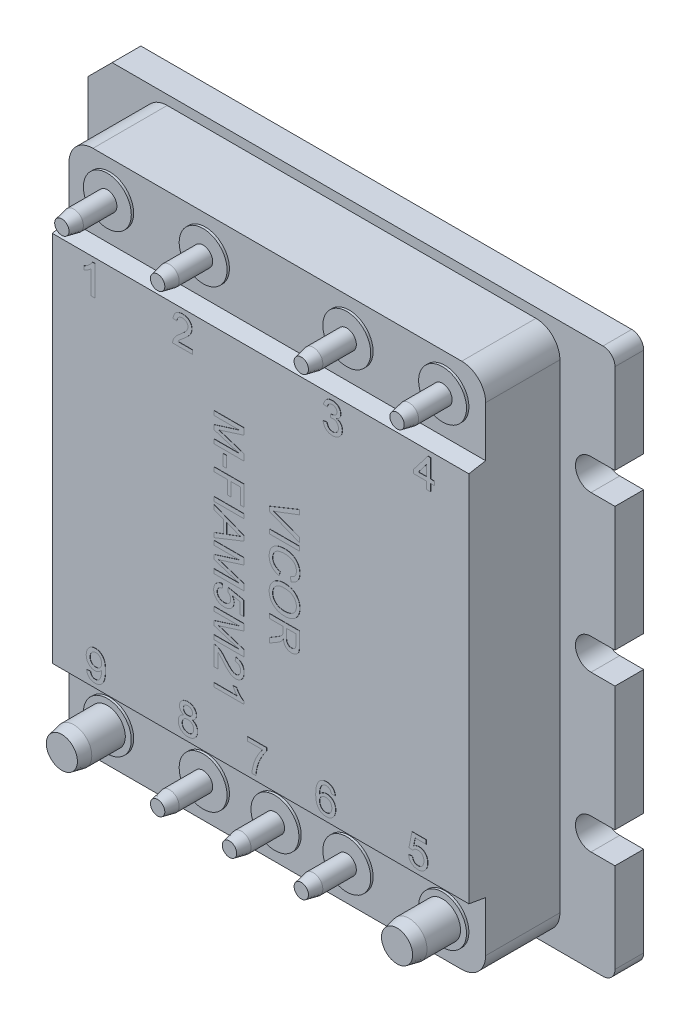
from build123d import *
from OCP.BRepFilletAPI import BRepFilletAPI_MakeChamfer

# Parameters (mm, degrees)
EXTRUDE1_DEPTH     = 3.048
CUT_EXTRUDE1_DEPTH = 41.353238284
EXTRUDE2_DEPTH     = 9.652
SKETCH4_W          = 61.534254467
SKETCH4_H          = 12.754726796
CUT_EXTRUDE2_DEPTH = 1.778
DRAFT1_ANGLE       = 10
SKETCH5_R          = 2.54
EXTRUDE3_DEPTH     = 0.254
SKETCH6_R          = 1.016
SKETCH6_R_2        = 1.905
EXTRUDE4_DEPTH     = 4.826
CHAMFER1_SIZE      = 1.27
CHAMFER1_SIZE2     = 0.254
EXTRUDE6_DEPTH     = 0.0254
EXTRUDE7_DEPTH     = 0.0254
SKETCH7_W          = 0.44775641
SKETCH7_H          = 3.175
SKETCH7_W_2        = 1.180448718
SKETCH7_H_2        = 0.366346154
EXTRUDE5_DEPTH     = 0.0254
SKETCH10_W         = 0.44775641
SKETCH10_H         = 3.175
SKETCH10_W_2       = 1.180448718
SKETCH10_H_2       = 0.366346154
EXTRUDE8_DEPTH     = 0.0254


with BuildPart() as part:
    # Sketch1 → Extrude1 (new body)
    with BuildSketch(Plane.XY):
        with BuildLine():
            Line((-26.67, -28.956), (26.67, -28.956))
            ThreePointArc((26.67, -28.956), (27.568025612, -28.584025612), (27.94, -27.686))
            Line((27.94, -27.686), (27.94, 27.686))
            ThreePointArc((27.94, 27.686), (27.568025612, 28.584025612), (26.67, 28.956))
            Line((26.67, 28.956), (-25.4, 28.956))
            Line((-25.4, 28.956), (-27.94, 26.416))
            Line((-27.94, 26.416), (-27.94, -27.686))
            ThreePointArc((-27.94, -27.686), (-27.568025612, -28.584025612), (-26.67, -28.956))
        make_face()
    extrude(amount=EXTRUDE1_DEPTH)

    # Sketch2 → Cut-Extrude1 (cut, through all)
    with BuildSketch(Plane.XY.offset(3.048)):
        with BuildLine():
            Line((27.94, 1.651), (25.4, 1.651))
            ThreePointArc((25.4, 1.651), (23.749, 0), (25.4, -1.651))
            Line((25.4, -1.651), (27.94, -1.651))
            Line((27.94, -1.651), (27.94, 1.651))
        make_face()
        with BuildLine():
            Line((27.94, -14.859), (25.4, -14.859))
            ThreePointArc((25.4, -14.859), (23.749, -16.51), (25.4, -18.161))
            Line((25.4, -18.161), (27.94, -18.161))
            Line((27.94, -18.161), (27.94, -14.859))
        make_face()
        with BuildLine():
            Line((27.94, 18.161), (25.4, 18.161))
            ThreePointArc((25.4, 18.161), (23.749, 16.51), (25.4, 14.859))
            Line((25.4, 14.859), (27.94, 14.859))
            Line((27.94, 14.859), (27.94, 18.161))
        make_face()
        with BuildLine():
            Line((-27.94, -18.161), (-25.4, -18.161))
            ThreePointArc((-25.4, -18.161), (-23.749, -16.51), (-25.4, -14.859))
            Line((-25.4, -14.859), (-27.94, -14.859))
            Line((-27.94, -14.859), (-27.94, -18.161))
        make_face()
        with BuildLine():
            Line((-27.94, 14.859), (-25.4, 14.859))
            ThreePointArc((-25.4, 14.859), (-23.749, 16.51), (-25.4, 18.161))
            Line((-25.4, 18.161), (-27.94, 18.161))
            Line((-27.94, 18.161), (-27.94, 14.859))
        make_face()
        with BuildLine():
            Line((-27.94, -1.651), (-25.4, -1.651))
            ThreePointArc((-25.4, -1.651), (-23.749, 0), (-25.4, 1.651))
            Line((-25.4, 1.651), (-27.94, 1.651))
            Line((-27.94, 1.651), (-27.94, -1.651))
        make_face()
    extrude(amount=-CUT_EXTRUDE1_DEPTH, mode=Mode.SUBTRACT)

    # Sketch3 → Extrude2 (add)
    with BuildSketch(Plane.XY.offset(3.048)):
        with BuildLine():
            Line((-19.558, 27.94), (19.558, 27.94))
            ThreePointArc((19.558, 27.94), (21.354051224, 27.196051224), (22.098, 25.4))
            Line((22.098, 25.4), (22.098, -25.4))
            ThreePointArc((22.098, -25.4), (21.354051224, -27.196051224), (19.558, -27.94))
            Line((19.558, -27.94), (-19.558, -27.94))
            ThreePointArc((-19.558, -27.94), (-21.354051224, -27.196051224), (-22.098, -25.4))
            Line((-22.098, -25.4), (-22.098, 25.4))
            ThreePointArc((-22.098, 25.4), (-21.354051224, 27.196051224), (-19.558, 27.94))
        make_face()
    extrude(amount=EXTRUDE2_DEPTH)

    # Sketch4 → Cut-Extrude2 (cut)
    with BuildSketch(Plane.XY.offset(12.7)):
        with Locations((0.778914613, 26.443363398)):
            Rectangle(SKETCH4_W, SKETCH4_H)
        with Locations((0.778914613, -26.443363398)):
            Rectangle(SKETCH4_W, SKETCH4_H)
    extrude(amount=-CUT_EXTRUDE2_DEPTH, mode=Mode.SUBTRACT)

    # Draft1
    draft1_faces = [part.faces().sort_by_distance(p)[0] for p in [
        (0, -20.066, 11.811),
        (0, 20.066, 11.811),
    ]]
    draft(draft1_faces, Plane(origin=(26.67, 27.686, 10.922), x_dir=(1, 0, 0), z_dir=(0, 0, 1)), DRAFT1_ANGLE)

    # Sketch5 → Extrude3 (add)
    with BuildSketch(Plane.XY.offset(10.922)):
        with Locations(Location((-17.78, 24.13, 0), (0, 0, 180))):
            Circle(SKETCH5_R)
        with Locations(Location((-7.62, 24.13, 0), (0, 0, 180))):
            Circle(SKETCH5_R)
        with Locations(Location((7.62, 24.13, 0), (0, 0, 180))):
            Circle(SKETCH5_R)
        with Locations(Location((17.78, 24.13, 0), (0, 0, 180))):
            Circle(SKETCH5_R)
        with Locations(Location((0, -24.13, 0), (0, 0, 180))):
            Circle(SKETCH5_R)
        with Locations(Location((17.78, -24.13, 0), (0, 0, 180))):
            Circle(SKETCH5_R)
        with Locations(Location((7.62, -24.13, 0), (0, 0, 180))):
            Circle(SKETCH5_R)
        with Locations(Location((-7.62, -24.13, 0), (0, 0, 180))):
            Circle(SKETCH5_R)
        with Locations(Location((-17.78, -24.13, 0), (0, 0, 180))):
            Circle(SKETCH5_R)
    extrude(amount=EXTRUDE3_DEPTH)

    # Sketch6 → Extrude4 (add)
    with BuildSketch(Plane.XY.offset(11.176)):
        with Locations((-17.78, 24.13)):
            Circle(SKETCH6_R)
        with Locations((-7.62, 24.13)):
            Circle(SKETCH6_R)
        with Locations((7.62, 24.13)):
            Circle(SKETCH6_R)
        with Locations((17.78, 24.13)):
            Circle(SKETCH6_R)
        with Locations(Location((-17.78, -24.13, 0), (0, 0, 180))):
            Circle(SKETCH6_R_2)
        with Locations(Location((-7.62, -24.13, 0), (0, 0, 180))):
            Circle(SKETCH6_R)
        with Locations(Location((0, -24.13, 0), (0, 0, 180))):
            Circle(SKETCH6_R)
        with Locations(Location((7.62, -24.13, 0), (0, 0, 180))):
            Circle(SKETCH6_R)
        with Locations(Location((17.78, -24.13, 0), (0, 0, 180))):
            Circle(SKETCH6_R_2)
    extrude(amount=EXTRUDE4_DEPTH)

    # Chamfer1: one chamfer whose edges measure the first distance from different faces: ONE call of the kernel's chamfer builder (chamfer() names one face for all edges)
    chamfer1_edges_1 = [part.edges().sort_by_distance(p)[0] for p in [
        (-18.796, 24.13, 16.002),
    ]]
    chamfer1_side_1 = [part.faces().sort_by_distance(p)[0] for p in [
        (-18.796, 24.13, 13.589),
    ]]
    chamfer1_edges_2 = [part.edges().sort_by_distance(p)[0] for p in [
        (-8.636, 24.13, 16.002),
    ]]
    chamfer1_side_2 = [part.faces().sort_by_distance(p)[0] for p in [
        (-8.636, 24.13, 13.589),
    ]]
    chamfer1_edges_3 = [part.edges().sort_by_distance(p)[0] for p in [
        (6.604, 24.13, 16.002),
    ]]
    chamfer1_side_3 = [part.faces().sort_by_distance(p)[0] for p in [
        (6.604, 24.13, 13.589),
    ]]
    chamfer1_edges_4 = [part.edges().sort_by_distance(p)[0] for p in [
        (16.764, 24.13, 16.002),
    ]]
    chamfer1_side_4 = [part.faces().sort_by_distance(p)[0] for p in [
        (16.764, 24.13, 13.589),
    ]]
    chamfer1_edges_5 = [part.edges().sort_by_distance(p)[0] for p in [
        (-15.875, -24.13, 16.002),
    ]]
    chamfer1_side_5 = [part.faces().sort_by_distance(p)[0] for p in [
        (-15.875, -24.13, 13.589),
    ]]
    chamfer1_edges_6 = [part.edges().sort_by_distance(p)[0] for p in [
        (-6.604, -24.13, 16.002),
    ]]
    chamfer1_side_6 = [part.faces().sort_by_distance(p)[0] for p in [
        (-6.604, -24.13, 13.589),
    ]]
    chamfer1_edges_7 = [part.edges().sort_by_distance(p)[0] for p in [
        (1.016, -24.13, 16.002),
    ]]
    chamfer1_side_7 = [part.faces().sort_by_distance(p)[0] for p in [
        (1.016, -24.13, 13.589),
    ]]
    chamfer1_edges_8 = [part.edges().sort_by_distance(p)[0] for p in [
        (8.636, -24.13, 16.002),
    ]]
    chamfer1_side_8 = [part.faces().sort_by_distance(p)[0] for p in [
        (8.636, -24.13, 13.589),
    ]]
    chamfer1_edges_9 = [part.edges().sort_by_distance(p)[0] for p in [
        (19.685, -24.13, 16.002),
    ]]
    chamfer1_side_9 = [part.faces().sort_by_distance(p)[0] for p in [
        (19.685, -24.13, 13.589),
    ]]
    chamfer1 = BRepFilletAPI_MakeChamfer(part.part.solid().wrapped)
    for e in chamfer1_edges_1:
        chamfer1.Add(CHAMFER1_SIZE, CHAMFER1_SIZE2, e.wrapped, chamfer1_side_1[0].wrapped)  # the first distance lies on this face
    for e in chamfer1_edges_2:
        chamfer1.Add(CHAMFER1_SIZE, CHAMFER1_SIZE2, e.wrapped, chamfer1_side_2[0].wrapped)  # the first distance lies on this face
    for e in chamfer1_edges_3:
        chamfer1.Add(CHAMFER1_SIZE, CHAMFER1_SIZE2, e.wrapped, chamfer1_side_3[0].wrapped)  # the first distance lies on this face
    for e in chamfer1_edges_4:
        chamfer1.Add(CHAMFER1_SIZE, CHAMFER1_SIZE2, e.wrapped, chamfer1_side_4[0].wrapped)  # the first distance lies on this face
    for e in chamfer1_edges_5:
        chamfer1.Add(CHAMFER1_SIZE, CHAMFER1_SIZE2, e.wrapped, chamfer1_side_5[0].wrapped)  # the first distance lies on this face
    for e in chamfer1_edges_6:
        chamfer1.Add(CHAMFER1_SIZE, CHAMFER1_SIZE2, e.wrapped, chamfer1_side_6[0].wrapped)  # the first distance lies on this face
    for e in chamfer1_edges_7:
        chamfer1.Add(CHAMFER1_SIZE, CHAMFER1_SIZE2, e.wrapped, chamfer1_side_7[0].wrapped)  # the first distance lies on this face
    for e in chamfer1_edges_8:
        chamfer1.Add(CHAMFER1_SIZE, CHAMFER1_SIZE2, e.wrapped, chamfer1_side_8[0].wrapped)  # the first distance lies on this face
    for e in chamfer1_edges_9:
        chamfer1.Add(CHAMFER1_SIZE, CHAMFER1_SIZE2, e.wrapped, chamfer1_side_9[0].wrapped)  # the first distance lies on this face
    add(Compound.cast(chamfer1.Shape()), mode=Mode.REPLACE)

    # Sketch8 → Extrude6 (add)
    # profile 1 of 4: a face of its own
    with BuildSketch(Plane.XY.offset(12.7)):
        with BuildLine():
            Line((-17.562091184, 16.087673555), (-17.969142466, 16.087673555))
            Line((-17.969142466, 16.087673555), (-17.969142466, 18.561782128))
            add(Edge.make_bspline(
                [(-17.969142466, 18.561782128), (-17.992580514, 18.539179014), (-18.04129393, 18.492200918), (-18.123638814, 18.42571518), (-18.215546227, 18.358329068), (-18.315822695, 18.293529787), (-18.41803759, 18.232528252), (-18.516815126, 18.177666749), (-18.61050617, 18.131240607), (-18.672220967, 18.105854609), (-18.701834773, 18.093673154)],
                knots=[0, 0, 0, 0, 0.893362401, 1.856755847, 2.901947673, 4.020460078, 5.132200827, 6.168787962, 7.121294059, 8, 8, 8, 8], degree=3))
            Line((-18.701834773, 18.093673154), (-18.701834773, 18.468923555))
            add(Edge.make_bspline(
                [(-18.701834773, 18.468923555), (-18.650970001, 18.495119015), (-18.550718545, 18.546748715), (-18.409084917, 18.635920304), (-18.27685469, 18.732585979), (-18.156216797, 18.836724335), (-18.048072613, 18.94317243), (-17.956937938, 19.050582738), (-17.880682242, 19.155018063), (-17.842423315, 19.22785012), (-17.824130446, 19.262673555)],
                knots=[0, 0, 0, 0, 1.141258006, 2.249351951, 3.335817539, 4.406819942, 5.426913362, 6.360259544, 7.215985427, 8, 8, 8, 8], degree=3))
            Line((-17.824130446, 19.262673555), (-17.562091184, 19.262673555))
            Line((-17.562091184, 19.262673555), (-17.562091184, 16.087673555))
        make_face()
    # profile 2 of 4: a face of its own
    with BuildSketch(Plane.XY.offset(12.7)):
        with BuildLine():
            Line((-7.222988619, 16.494724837), (-7.222988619, 16.087673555))
            Line((-7.222988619, 16.087673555), (-9.298950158, 16.087673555))
            add(Edge.make_bspline(
                [(-9.298950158, 16.087673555), (-9.298992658, 16.111865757), (-9.299077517, 16.160169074), (-9.290903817, 16.231606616), (-9.278102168, 16.30209648), (-9.263627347, 16.347298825), (-9.256336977, 16.370065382)],
                knots=[0, 0, 0, 0, 1.01057331, 2.01775941, 3.001627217, 4, 4, 4, 4], degree=3))
            add(Edge.make_bspline(
                [(-9.256336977, 16.370065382), (-9.242866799, 16.407263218), (-9.215439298, 16.48300414), (-9.159870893, 16.592287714), (-9.094509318, 16.700910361), (-9.030870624, 16.789344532), (-8.972591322, 16.859997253), (-8.923716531, 16.91527483), (-8.869554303, 16.971857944), (-8.810148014, 17.029736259), (-8.746069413, 17.08928463), (-8.677231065, 17.150701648), (-8.602820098, 17.21284274), (-8.550873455, 17.254032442), (-8.524280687, 17.275118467)],
                knots=[0, 0, 0, 0, 1.204657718, 2.452881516, 3.728232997, 5.065887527, 5.768225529, 6.518857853, 7.313994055, 8.154655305, 9.046094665, 9.979688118, 10.965752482, 12, 12, 12, 12], degree=3))
            add(Edge.make_bspline(
                [(-8.524280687, 17.275118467), (-8.483427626, 17.309503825), (-8.404762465, 17.375715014), (-8.293674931, 17.473966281), (-8.192214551, 17.565198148), (-8.101996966, 17.651009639), (-8.022284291, 17.730568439), (-7.95288936, 17.803694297), (-7.893215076, 17.870159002), (-7.843989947, 17.932368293), (-7.802457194, 17.991111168), (-7.767261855, 18.048411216), (-7.737931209, 18.105269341), (-7.713502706, 18.16150563), (-7.694181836, 18.217360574), (-7.681011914, 18.272996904), (-7.672080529, 18.327862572), (-7.671186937, 18.364370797), (-7.67074503, 18.382425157)],
                knots=[0, 0, 0, 0, 1.782554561, 3.432421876, 4.950675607, 6.337395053, 7.588547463, 8.709982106, 9.702713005, 10.569305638, 11.356701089, 12.103210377, 12.812277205, 13.490692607, 14.148717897, 14.782152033, 15.397739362, 16, 16, 16, 16], degree=3))
            add(Edge.make_bspline(
                [(-7.67074503, 18.382425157), (-7.67118699, 18.400268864), (-7.672054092, 18.435277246), (-7.68028111, 18.486511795), (-7.691733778, 18.53585189), (-7.710249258, 18.5824093), (-7.732288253, 18.627562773), (-7.760558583, 18.669885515), (-7.793261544, 18.710432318), (-7.830703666, 18.748134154), (-7.871599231, 18.783504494), (-7.917294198, 18.81290584), (-7.964787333, 18.839375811), (-8.015717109, 18.860659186), (-8.070000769, 18.876287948), (-8.127243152, 18.887630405), (-8.187435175, 18.89482213), (-8.228512, 18.895818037), (-8.249521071, 18.896327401)],
                knots=[0, 0, 0, 0, 0.988194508, 1.938783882, 2.870742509, 3.789494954, 4.709148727, 5.651055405, 6.603531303, 7.592354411, 8.592907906, 9.593461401, 10.59787167, 11.603930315, 12.645063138, 13.723588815, 14.835711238, 16, 16, 16, 16], degree=3))
            add(Edge.make_bspline(
                [(-8.249521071, 18.896327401), (-8.271590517, 18.895820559), (-8.314782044, 18.894828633), (-8.377916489, 18.887608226), (-8.437851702, 18.87657642), (-8.494444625, 18.859709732), (-8.547626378, 18.838461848), (-8.597180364, 18.811716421), (-8.643900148, 18.781525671), (-8.686314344, 18.745782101), (-8.724668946, 18.706149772), (-8.758718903, 18.663002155), (-8.786617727, 18.61550659), (-8.809657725, 18.564707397), (-8.828183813, 18.510444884), (-8.841633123, 18.452304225), (-8.848965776, 18.390453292), (-8.850440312, 18.348097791), (-8.851193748, 18.326455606)],
                knots=[0, 0, 0, 0, 1.131143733, 2.213731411, 3.253917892, 4.251203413, 5.236093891, 6.184197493, 7.13373276, 8.082770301, 9.020476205, 9.957489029, 10.893177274, 11.836722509, 12.812818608, 13.827831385, 14.890097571, 16, 16, 16, 16], degree=3))
            Line((-8.851193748, 18.326455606), (-9.25824503, 18.367160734))
            add(Edge.make_bspline(
                [(-9.25824503, 18.367160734), (-9.254080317, 18.402636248), (-9.245978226, 18.471650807), (-9.225797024, 18.57160677), (-9.197464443, 18.664594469), (-9.163562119, 18.751910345), (-9.121062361, 18.832068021), (-9.073020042, 18.906725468), (-9.016356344, 18.973514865), (-8.953757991, 19.034541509), (-8.88453915, 19.088322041), (-8.809350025, 19.135306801), (-8.728225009, 19.174606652), (-8.641615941, 19.207145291), (-8.549323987, 19.231833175), (-8.451479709, 19.249536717), (-8.347925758, 19.260449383), (-8.276896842, 19.261921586), (-8.240616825, 19.262673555)],
                knots=[0, 0, 0, 0, 1.130804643, 2.199883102, 3.223565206, 4.205909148, 5.160801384, 6.091796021, 7.01151579, 7.927798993, 8.855738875, 9.7815393, 10.730299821, 11.705391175, 12.706931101, 13.751121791, 14.851322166, 16, 16, 16, 16], degree=3))
            add(Edge.make_bspline(
                [(-8.240616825, 19.262673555), (-8.203902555, 19.262044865), (-8.132382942, 19.260820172), (-8.02816737, 19.248289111), (-7.929837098, 19.228772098), (-7.837031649, 19.201571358), (-7.750299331, 19.165903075), (-7.669573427, 19.122324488), (-7.594481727, 19.071260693), (-7.526278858, 19.012098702), (-7.464778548, 18.947513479), (-7.410882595, 18.878587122), (-7.365822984, 18.805614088), (-7.327457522, 18.729589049), (-7.299000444, 18.648905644), (-7.278988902, 18.564660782), (-7.265390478, 18.476782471), (-7.264266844, 18.416822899), (-7.263693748, 18.386241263)],
                knots=[0, 0, 0, 0, 1.195390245, 2.328627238, 3.413424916, 4.457841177, 5.473507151, 6.462241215, 7.441013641, 8.425227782, 9.397253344, 10.342087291, 11.269524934, 12.186751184, 13.110685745, 14.048630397, 15.004728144, 16, 16, 16, 16], degree=3))
            add(Edge.make_bspline(
                [(-7.263693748, 18.386241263), (-7.264568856, 18.354822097), (-7.266321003, 18.291914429), (-7.279996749, 18.197886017), (-7.303396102, 18.104878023), (-7.334417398, 18.011758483), (-7.376798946, 17.91815781), (-7.430340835, 17.822784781), (-7.496765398, 17.725287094), (-7.560647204, 17.642403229), (-7.620110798, 17.572925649), (-7.672819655, 17.515741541), (-7.733800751, 17.454987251), (-7.800766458, 17.388558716), (-7.876447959, 17.318813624), (-7.958670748, 17.243663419), (-8.049234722, 17.165085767), (-8.112103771, 17.111405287), (-8.144578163, 17.083677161)],
                knots=[0, 0, 0, 0, 0.927118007, 1.856282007, 2.79721255, 3.754929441, 4.749232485, 5.824981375, 6.979078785, 8.228161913, 8.911614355, 9.677694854, 10.522803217, 11.452009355, 12.461436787, 13.560019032, 14.739651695, 16, 16, 16, 16], degree=3))
            add(Edge.make_bspline(
                [(-8.144578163, 17.083677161), (-8.172387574, 17.061037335), (-8.225415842, 17.017866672), (-8.300858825, 16.955281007), (-8.368432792, 16.897891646), (-8.429717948, 16.847570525), (-8.482482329, 16.801883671), (-8.528584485, 16.762831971), (-8.566349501, 16.728451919), (-8.623858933, 16.676227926), (-8.696699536, 16.601787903), (-8.750371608, 16.529456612), (-8.776143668, 16.494724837)],
                knots=[0, 0, 0, 0, 1.241996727, 2.368296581, 3.394949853, 4.3125351, 5.114548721, 5.812230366, 6.404953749, 6.883082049, 8.503329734, 10, 10, 10, 10], degree=3))
            Line((-8.776143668, 16.494724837), (-7.222988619, 16.494724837))
        make_face()
    # profile 3 of 4: a face of its own
    with BuildSketch(Plane.XY.offset(12.7)):
        with BuildLine():
            Line((6.657460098, 16.942481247), (7.064511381, 16.983186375))
            add(Edge.make_bspline(
                [(7.064511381, 16.983186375), (7.069937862, 16.958728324), (7.0804377, 16.911403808), (7.100640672, 16.843606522), (7.121979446, 16.780675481), (7.148433, 16.7240183), (7.174245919, 16.671317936), (7.204580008, 16.624751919), (7.236992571, 16.583105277), (7.272082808, 16.546532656), (7.31025507, 16.515039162), (7.351000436, 16.487480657), (7.395180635, 16.464465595), (7.442457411, 16.446243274), (7.49243258, 16.431492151), (7.545377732, 16.420660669), (7.601572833, 16.41420822), (7.640090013, 16.413617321), (7.659823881, 16.41331458)],
                knots=[0, 0, 0, 0, 1.321063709, 2.556160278, 3.730472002, 4.821700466, 5.852032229, 6.822994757, 7.746964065, 8.632786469, 9.490489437, 10.352773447, 11.223141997, 12.11199479, 13.021433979, 13.96892724, 14.959401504, 16, 16, 16, 16], degree=3))
            add(Edge.make_bspline(
                [(7.659823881, 16.41331458), (7.682971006, 16.413644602), (7.728177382, 16.414289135), (7.794050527, 16.423959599), (7.856740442, 16.437238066), (7.915352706, 16.458059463), (7.970703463, 16.483507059), (8.022477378, 16.514954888), (8.07102884, 16.551882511), (8.115400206, 16.59454111), (8.155081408, 16.641466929), (8.190423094, 16.69103257), (8.21964592, 16.743660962), (8.244276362, 16.798610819), (8.26245685, 16.856770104), (8.275766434, 16.9174136), (8.284464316, 16.980815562), (8.285259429, 17.024074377), (8.285665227, 17.04615212)],
                knots=[0, 0, 0, 0, 1.111377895, 2.170522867, 3.193923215, 4.186422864, 5.152846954, 6.117443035, 7.091571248, 8.078879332, 9.069127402, 10.041602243, 10.999610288, 11.957618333, 12.930786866, 13.922135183, 14.939532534, 16, 16, 16, 16], degree=3))
            add(Edge.make_bspline(
                [(8.285665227, 17.04615212), (8.285188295, 17.067162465), (8.284255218, 17.108267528), (8.276584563, 17.168600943), (8.263199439, 17.225873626), (8.244644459, 17.280417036), (8.220935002, 17.3321511), (8.192436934, 17.381503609), (8.157581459, 17.427393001), (8.118348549, 17.470312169), (8.075556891, 17.509853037), (8.028727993, 17.543487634), (7.979446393, 17.572515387), (7.927124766, 17.595954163), (7.871980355, 17.614557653), (7.814065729, 17.627928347), (7.753102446, 17.635602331), (7.711575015, 17.636535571), (7.690352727, 17.637012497)],
                knots=[0, 0, 0, 0, 1.072815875, 2.098878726, 3.09954706, 4.07199174, 5.036203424, 6.001873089, 6.97636515, 7.972747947, 8.969130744, 9.945905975, 10.911575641, 11.885646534, 12.868345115, 13.879560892, 14.916365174, 16, 16, 16, 16], degree=3))
            add(Edge.make_bspline(
                [(7.690352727, 17.637012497), (7.671667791, 17.636517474), (7.632014, 17.63546692), (7.569427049, 17.626190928), (7.5001014, 17.613202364), (7.452195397, 17.600456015), (7.427041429, 17.593763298)],
                knots=[0, 0, 0, 0, 0.837610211, 1.777604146, 2.833088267, 4, 4, 4, 4], degree=3))
            Line((7.427041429, 17.593763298), (7.469018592, 17.960109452))
            add(Edge.make_bspline(
                [(7.469018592, 17.960109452), (7.480032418, 17.958905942), (7.499490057, 17.956779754), (7.519045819, 17.955997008), (7.527532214, 17.955657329)],
                knots=[0, 0, 0, 0, 1.132082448, 2, 2, 2, 2], degree=3))
            add(Edge.make_bspline(
                [(7.527532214, 17.955657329), (7.564967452, 17.957086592), (7.638403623, 17.959890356), (7.745459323, 17.983187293), (7.846916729, 18.019867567), (7.925299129, 18.063632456), (7.983424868, 18.10479571), (8.020077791, 18.141910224), (8.053122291, 18.18129622), (8.077776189, 18.226473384), (8.099075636, 18.274475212), (8.112265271, 18.327192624), (8.121884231, 18.383344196), (8.122518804, 18.4222363), (8.122844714, 18.442210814)],
                knots=[0, 0, 0, 0, 1.557468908, 3.055264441, 4.54122591, 6.035034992, 6.780215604, 7.498173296, 8.201377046, 8.913174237, 9.633083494, 10.382644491, 11.169345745, 12, 12, 12, 12], degree=3))
            add(Edge.make_bspline(
                [(8.122844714, 18.442210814), (8.122543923, 18.458344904), (8.121955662, 18.489898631), (8.115402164, 18.536159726), (8.104563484, 18.579993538), (8.089913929, 18.621868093), (8.070714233, 18.66156393), (8.046905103, 18.699032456), (8.019702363, 18.735033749), (7.987590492, 18.767707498), (7.953201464, 18.798383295), (7.915281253, 18.824218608), (7.875634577, 18.847169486), (7.832863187, 18.864512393), (7.78802301, 18.87877109), (7.740730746, 18.888763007), (7.690969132, 18.89547325), (7.656878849, 18.896038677), (7.639471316, 18.896327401)],
                knots=[0, 0, 0, 0, 1.041493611, 2.036867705, 3.009952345, 3.954088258, 4.897230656, 5.850851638, 6.817653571, 7.805463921, 8.805067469, 9.788883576, 10.763797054, 11.758134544, 12.762883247, 13.799594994, 14.876406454, 16, 16, 16, 16], degree=3))
            add(Edge.make_bspline(
                [(7.639471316, 18.896327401), (7.605405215, 18.894999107), (7.539618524, 18.892433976), (7.445430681, 18.868701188), (7.360079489, 18.830298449), (7.296889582, 18.785262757), (7.252019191, 18.742206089), (7.221370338, 18.705710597), (7.193956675, 18.66540893), (7.169700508, 18.621315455), (7.148929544, 18.573252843), (7.130205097, 18.521816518), (7.115710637, 18.466182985), (7.10877385, 18.427634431), (7.105216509, 18.407865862)],
                knots=[0, 0, 0, 0, 1.533565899, 2.961543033, 4.347411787, 5.731829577, 6.434842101, 7.147085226, 7.87612511, 8.629021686, 9.412189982, 10.234506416, 11.094615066, 12, 12, 12, 12], degree=3))
            Line((7.105216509, 18.407865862), (6.698165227, 18.448570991))
            add(Edge.make_bspline(
                [(6.698165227, 18.448570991), (6.704532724, 18.480044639), (6.717023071, 18.541782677), (6.742469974, 18.630949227), (6.773502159, 18.714651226), (6.810761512, 18.792504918), (6.852487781, 18.865442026), (6.900622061, 18.932597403), (6.954035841, 18.994370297), (7.012823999, 19.050572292), (7.076188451, 19.10076696), (7.143810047, 19.144066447), (7.215133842, 19.180769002), (7.290226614, 19.210357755), (7.369028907, 19.234417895), (7.451764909, 19.250357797), (7.53806013, 19.261140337), (7.596823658, 19.262156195), (7.626750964, 19.262673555)],
                knots=[0, 0, 0, 0, 1.136581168, 2.229493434, 3.279335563, 4.293305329, 5.282068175, 6.250623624, 7.213783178, 8.169396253, 9.125981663, 10.071280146, 11.007896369, 11.961295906, 12.925420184, 13.920544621, 14.940967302, 16, 16, 16, 16], degree=3))
            add(Edge.make_bspline(
                [(7.626750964, 19.262673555), (7.66817748, 19.261330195), (7.749635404, 19.258688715), (7.869278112, 19.237709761), (7.983715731, 19.203282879), (8.092027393, 19.155561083), (8.192349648, 19.097246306), (8.281126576, 19.027359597), (8.357171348, 18.947109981), (8.419006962, 18.857374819), (8.467972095, 18.761833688), (8.504204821, 18.66265785), (8.525854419, 18.559961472), (8.528546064, 18.49043605), (8.529895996, 18.455567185)],
                knots=[0, 0, 0, 0, 1.104647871, 2.172094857, 3.229560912, 4.285649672, 5.322588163, 6.317201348, 7.289435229, 8.260615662, 9.214246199, 10.146367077, 11.070353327, 12, 12, 12, 12], degree=3))
            add(Edge.make_bspline(
                [(8.529895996, 18.455567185), (8.528527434, 18.422605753), (8.525825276, 18.357524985), (8.505021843, 18.262365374), (8.469868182, 18.172212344), (8.42235363, 18.086749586), (8.360738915, 18.007825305), (8.285193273, 17.937496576), (8.196925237, 17.875090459), (8.130775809, 17.842608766), (8.096767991, 17.825909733)],
                knots=[0, 0, 0, 0, 0.975609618, 1.926294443, 2.868398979, 3.832526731, 4.812148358, 5.820404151, 6.879456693, 8, 8, 8, 8], degree=3))
            add(Edge.make_bspline(
                [(8.096767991, 17.825909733), (8.119567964, 17.820153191), (8.164226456, 17.808877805), (8.228366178, 17.785515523), (8.288664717, 17.758164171), (8.345924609, 17.727185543), (8.398483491, 17.690548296), (8.44815302, 17.650489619), (8.493055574, 17.605080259), (8.534492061, 17.555938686), (8.572194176, 17.503579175), (8.603920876, 17.446983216), (8.631300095, 17.387638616), (8.654646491, 17.325114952), (8.671423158, 17.258930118), (8.683419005, 17.18959685), (8.691335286, 17.117356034), (8.692251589, 17.068009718), (8.692716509, 17.042972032)],
                knots=[0, 0, 0, 0, 1.053251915, 2.063013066, 3.05373318, 4.018979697, 4.975584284, 5.920798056, 6.874756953, 7.832116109, 8.799604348, 9.761196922, 10.734637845, 11.72654167, 12.747371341, 13.789206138, 14.878271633, 16, 16, 16, 16], degree=3))
            add(Edge.make_bspline(
                [(8.692716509, 17.042972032), (8.691941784, 17.008789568), (8.6904192, 16.941610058), (8.67598506, 16.842921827), (8.652396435, 16.748365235), (8.619752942, 16.657619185), (8.578388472, 16.570313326), (8.526482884, 16.487679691), (8.465574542, 16.409046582), (8.396615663, 16.335166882), (8.321064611, 16.267269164), (8.23901906, 16.208476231), (8.152102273, 16.158548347), (8.060172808, 16.117832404), (7.963474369, 16.085843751), (7.861910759, 16.062913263), (7.755167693, 16.04943678), (7.682335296, 16.047802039), (7.645195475, 16.046968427)],
                knots=[0, 0, 0, 0, 1.016055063, 1.996874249, 2.958724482, 3.910019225, 4.860394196, 5.826121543, 6.806008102, 7.814207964, 8.82789325, 9.821757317, 10.810247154, 11.803791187, 12.806673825, 13.834534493, 14.895752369, 16, 16, 16, 16], degree=3))
            add(Edge.make_bspline(
                [(7.645195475, 16.046968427), (7.611865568, 16.047596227), (7.546250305, 16.048832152), (7.45020311, 16.061708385), (7.358184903, 16.079981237), (7.270923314, 16.108151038), (7.187404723, 16.142503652), (7.10904363, 16.186452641), (7.034431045, 16.236904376), (6.964967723, 16.295300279), (6.901039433, 16.359754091), (6.844007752, 16.429312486), (6.795034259, 16.503821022), (6.751854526, 16.58216491), (6.716954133, 16.665820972), (6.689778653, 16.754070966), (6.669056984, 16.84658737), (6.661367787, 16.910168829), (6.657460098, 16.942481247)],
                knots=[0, 0, 0, 0, 1.08471039, 2.135426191, 3.150939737, 4.135689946, 5.116584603, 6.086901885, 7.055842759, 8.045878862, 9.036901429, 10.008421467, 10.96965771, 11.936653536, 12.917548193, 13.915472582, 14.940632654, 16, 16, 16, 16], degree=3))
        make_face()
    # profile 4 of 4: a face of its own
    with BuildSketch(Plane.XY.offset(12.7)):
        Polygon((17.647844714, 16.087673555), (17.647844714, 16.861070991), (16.263870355, 16.861070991), (16.263870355, 17.268122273), (17.769960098, 19.221968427), (18.054895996, 19.221968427), (18.054895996, 17.268122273), (18.461947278, 17.268122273), (18.461947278, 16.861070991), (18.054895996, 16.861070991), (18.054895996, 16.087673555), align=None)
        Polygon((17.647844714, 17.268122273), (17.647844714, 18.411681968), (16.766324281, 17.268122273), align=None, mode=Mode.SUBTRACT)
    extrude(amount=EXTRUDE6_DEPTH)

    # Sketch9 → Extrude7 (add)
    # profile 1 of 5: a face of its own
    with BuildSketch(Plane.XY.offset(12.7)):
        with BuildLine():
            Line((-18.42896175, -18.474354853), (-18.021910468, -18.433649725))
            add(Edge.make_bspline(
                [(-18.021910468, -18.433649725), (-18.018230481, -18.45450543), (-18.011116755, -18.494821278), (-17.995063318, -18.55227827), (-17.978781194, -18.60585135), (-17.957763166, -18.65434704), (-17.935874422, -18.699082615), (-17.911086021, -18.739609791), (-17.882956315, -18.775114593), (-17.843233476, -18.816719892), (-17.786872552, -18.860135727), (-17.708748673, -18.895304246), (-17.622805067, -18.918950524), (-17.562238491, -18.9210336), (-17.530904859, -18.922111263)],
                knots=[0, 0, 0, 0, 0.994516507, 1.922484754, 2.80151264, 3.623050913, 4.402748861, 5.140924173, 5.850441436, 6.526872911, 7.841975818, 9.161260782, 10.53140107, 12, 12, 12, 12], degree=3))
            add(Edge.make_bspline(
                [(-17.530904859, -18.922111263), (-17.503487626, -18.921123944), (-17.449526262, -18.919180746), (-17.370848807, -18.904116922), (-17.29602777, -18.879984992), (-17.226365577, -18.845360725), (-17.162115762, -18.803223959), (-17.105995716, -18.753156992), (-17.057256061, -18.697316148), (-17.017225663, -18.632976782), (-16.983058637, -18.559490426), (-16.950775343, -18.475922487), (-16.920235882, -18.380833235), (-16.893094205, -18.275435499), (-16.868790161, -18.163577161), (-16.851733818, -18.047792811), (-16.841239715, -17.930333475), (-16.840117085, -17.851291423), (-16.839553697, -17.811624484)],
                knots=[0, 0, 0, 0, 0.897794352, 1.766998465, 2.614902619, 3.466100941, 4.308008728, 5.124841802, 5.922729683, 6.728261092, 7.598214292, 8.574707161, 9.662086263, 10.868425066, 12.139522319, 13.41071447, 14.70057738, 16, 16, 16, 16], degree=3))
            add(Edge.make_bspline(
                [(-16.839553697, -17.811624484), (-16.83974637, -17.800811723), (-16.84020733, -17.774942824), (-16.841000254, -17.749081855), (-16.84146175, -17.734030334)],
                knots=[0, 0, 0, 0, 0.835966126, 2, 2, 2, 2], degree=3))
            add(Edge.make_bspline(
                [(-16.84146175, -17.734030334), (-16.861085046, -17.763829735), (-16.90030002, -17.823380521), (-16.972543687, -17.903304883), (-17.05519171, -17.974198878), (-17.146989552, -18.035512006), (-17.245670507, -18.085830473), (-17.349517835, -18.122393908), (-17.457636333, -18.144971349), (-17.53122005, -18.147456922), (-17.568429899, -18.148713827)],
                knots=[0, 0, 0, 0, 0.978840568, 1.956103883, 2.947027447, 3.962820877, 4.980997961, 5.980964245, 6.979013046, 8, 8, 8, 8], degree=3))
            add(Edge.make_bspline(
                [(-17.568429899, -18.148713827), (-17.599438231, -18.147910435), (-17.660478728, -18.146328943), (-17.749892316, -18.132273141), (-17.835890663, -18.111194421), (-17.917658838, -18.079280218), (-17.996469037, -18.039810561), (-18.071493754, -17.991364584), (-18.142848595, -17.934008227), (-18.209611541, -17.868455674), (-18.270538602, -17.795388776), (-18.324269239, -17.716587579), (-18.368887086, -17.631666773), (-18.40601068, -17.541686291), (-18.434655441, -17.445776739), (-18.4545598, -17.344162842), (-18.467946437, -17.23723249), (-18.469085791, -17.16398884), (-18.469666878, -17.126633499)],
                knots=[0, 0, 0, 0, 0.975490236, 1.920271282, 2.842894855, 3.757591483, 4.67685385, 5.613562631, 6.563069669, 7.554119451, 8.55387214, 9.553424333, 10.550567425, 11.568071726, 12.613215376, 13.695622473, 14.824733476, 16, 16, 16, 16], degree=3))
            add(Edge.make_bspline(
                [(-18.469666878, -17.126633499), (-18.46879656, -17.088012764), (-18.467094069, -17.012463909), (-18.454233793, -16.9020021), (-18.432957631, -16.797353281), (-18.401929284, -16.698717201), (-18.363557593, -16.605460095), (-18.315172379, -16.518254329), (-18.25863676, -16.436726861), (-18.193612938, -16.361663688), (-18.122152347, -16.294311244), (-18.046281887, -16.234198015), (-17.965012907, -16.184785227), (-17.87990367, -16.143587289), (-17.79031009, -16.111748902), (-17.696385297, -16.088736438), (-17.597869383, -16.075233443), (-17.530734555, -16.073589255), (-17.496559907, -16.072752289)],
                knots=[0, 0, 0, 0, 1.151671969, 2.252870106, 3.311924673, 4.331900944, 5.332425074, 6.314476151, 7.300265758, 8.286521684, 9.270545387, 10.225535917, 11.167946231, 12.101233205, 13.04124339, 13.998220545, 14.981004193, 16, 16, 16, 16], degree=3))
            add(Edge.make_bspline(
                [(-17.496559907, -16.072752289), (-17.471739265, -16.073254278), (-17.422404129, -16.074252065), (-17.348983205, -16.081869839), (-17.277300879, -16.095602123), (-17.206889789, -16.112936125), (-17.138937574, -16.136997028), (-17.072134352, -16.164820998), (-17.007285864, -16.198851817), (-16.944014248, -16.237549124), (-16.882716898, -16.280232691), (-16.826319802, -16.329271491), (-16.772568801, -16.381313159), (-16.722557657, -16.437991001), (-16.677868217, -16.500179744), (-16.635466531, -16.56568071), (-16.597396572, -16.635923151), (-16.562679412, -16.711002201), (-16.531779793, -16.792463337), (-16.50600177, -16.882106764), (-16.483904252, -16.98024297), (-16.46550589, -17.087002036), (-16.451863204, -17.20230785), (-16.441822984, -17.325989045), (-16.435250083, -17.458139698), (-16.43469584, -17.54915301), (-16.434410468, -17.596014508)],
                knots=[0, 0, 0, 0, 0.850689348, 1.69088598, 2.526071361, 3.350886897, 4.173587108, 4.994166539, 5.82944675, 6.680632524, 7.535501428, 8.385942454, 9.238956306, 10.098905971, 10.972410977, 11.861345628, 12.77184846, 13.708225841, 14.694799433, 15.754852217, 16.902446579, 18.141290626, 19.466225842, 20.880733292, 22.39393263, 24, 24, 24, 24], degree=3))
            add(Edge.make_bspline(
                [(-16.434410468, -17.596014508), (-16.43469775, -17.644995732), (-16.435257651, -17.740458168), (-16.441882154, -17.879809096), (-16.451917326, -18.011537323), (-16.465569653, -18.135729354), (-16.484096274, -18.252195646), (-16.506116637, -18.360915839), (-16.5320859, -18.462090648), (-16.562603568, -18.555728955), (-16.59729626, -18.642906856), (-16.635309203, -18.724697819), (-16.677881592, -18.80098089), (-16.724535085, -18.871902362), (-16.774670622, -18.937586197), (-16.829070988, -18.997856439), (-16.887753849, -19.052530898), (-16.949971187, -19.102224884), (-17.015629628, -19.146017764), (-17.083835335, -19.184659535), (-17.155358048, -19.216313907), (-17.229462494, -19.242282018), (-17.306016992, -19.263722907), (-17.385645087, -19.278169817), (-17.467978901, -19.286352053), (-17.523678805, -19.287749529), (-17.55189344, -19.288457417)],
                knots=[0, 0, 0, 0, 1.538356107, 2.998194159, 4.380716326, 5.687456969, 6.921258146, 8.08355215, 9.170518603, 10.200253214, 11.174652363, 12.115998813, 13.031191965, 13.915860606, 14.780247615, 15.624154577, 16.462764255, 17.29681422, 18.1223677, 18.939254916, 19.756006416, 20.575278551, 21.404021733, 22.250368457, 23.113728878, 24, 24, 24, 24], degree=3))
            add(Edge.make_bspline(
                [(-17.55189344, -19.288457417), (-17.581820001, -19.287939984), (-17.640371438, -19.286927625), (-17.725850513, -19.276282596), (-17.807280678, -19.260098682), (-17.884424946, -19.236207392), (-17.957861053, -19.206797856), (-18.026335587, -19.169214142), (-18.091065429, -19.12585378), (-18.151252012, -19.075842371), (-18.206190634, -19.019363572), (-18.255899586, -18.957809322), (-18.299479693, -18.89038239), (-18.336702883, -18.817480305), (-18.369673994, -18.739716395), (-18.395235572, -18.656047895), (-18.416001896, -18.567246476), (-18.424572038, -18.505818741), (-18.42896175, -18.474354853)],
                knots=[0, 0, 0, 0, 1.08199657, 2.11693069, 3.111083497, 4.081436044, 5.034173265, 5.967546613, 6.901297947, 7.84883568, 8.792454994, 9.747011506, 10.706361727, 11.690764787, 12.70483191, 13.757514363, 14.851376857, 16, 16, 16, 16], degree=3))
        make_face()
        with BuildLine():
            add(Edge.make_bspline(
                [(-16.84146175, -17.117729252), (-16.841919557, -17.092268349), (-16.84281065, -17.042710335), (-16.850617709, -16.970405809), (-16.863179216, -16.902316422), (-16.880810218, -16.838050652), (-16.904753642, -16.778289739), (-16.932490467, -16.721638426), (-16.966409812, -16.66966692), (-17.004681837, -16.621675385), (-17.046839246, -16.578748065), (-17.092748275, -16.541319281), (-17.141548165, -16.509234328), (-17.194409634, -16.484006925), (-17.249594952, -16.463219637), (-17.308429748, -16.449633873), (-17.370104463, -16.440116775), (-17.412566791, -16.439442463), (-17.434230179, -16.439098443)],
                knots=[0, 0, 0, 0, 1.20361398, 2.342757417, 3.433960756, 4.474970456, 5.487648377, 6.473933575, 7.452701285, 8.415527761, 9.372491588, 10.291530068, 11.211879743, 12.12647906, 13.055739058, 13.994253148, 14.97671008, 16, 16, 16, 16], degree=3))
            add(Edge.make_bspline(
                [(-17.434230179, -16.439098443), (-17.456512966, -16.439773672), (-17.500410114, -16.441103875), (-17.564750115, -16.44967044), (-17.625768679, -16.466072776), (-17.68387775, -16.487830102), (-17.739722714, -16.514743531), (-17.791273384, -16.55000835), (-17.840688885, -16.589972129), (-17.885987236, -16.636335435), (-17.927365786, -16.687167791), (-17.963824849, -16.741992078), (-17.994527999, -16.800835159), (-18.019071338, -16.863451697), (-18.039128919, -16.929295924), (-18.05290705, -16.998956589), (-18.061384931, -17.072359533), (-18.06219926, -17.12258151), (-18.062615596, -17.148258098)],
                knots=[0, 0, 0, 0, 1.007165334, 1.984118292, 2.925321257, 3.856078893, 4.785899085, 5.718627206, 6.671847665, 7.654235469, 8.641842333, 9.630378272, 10.624608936, 11.635186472, 12.665777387, 13.731187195, 14.840042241, 16, 16, 16, 16], degree=3))
            add(Edge.make_bspline(
                [(-18.062615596, -17.148258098), (-18.062231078, -17.17118817), (-18.061477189, -17.216145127), (-18.052499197, -17.281755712), (-18.040523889, -17.34437502), (-18.021432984, -17.403363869), (-17.99843399, -17.459578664), (-17.968542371, -17.511728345), (-17.934887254, -17.561372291), (-17.895453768, -17.606847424), (-17.851859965, -17.648101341), (-17.804246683, -17.684058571), (-17.753215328, -17.714838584), (-17.698291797, -17.739612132), (-17.63980546, -17.758691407), (-17.577886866, -17.772737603), (-17.51226687, -17.781103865), (-17.467327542, -17.781940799), (-17.444406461, -17.782367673)],
                knots=[0, 0, 0, 0, 1.102204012, 2.160993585, 3.181057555, 4.164839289, 5.138418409, 6.097303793, 7.050641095, 8.019669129, 8.986440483, 9.932879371, 10.884360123, 11.847412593, 12.824617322, 13.839006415, 14.897795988, 16, 16, 16, 16], degree=3))
            add(Edge.make_bspline(
                [(-17.444406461, -17.782367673), (-17.422967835, -17.781936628), (-17.380771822, -17.781088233), (-17.318959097, -17.772686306), (-17.260225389, -17.758614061), (-17.20430699, -17.739482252), (-17.151294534, -17.71471727), (-17.101544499, -17.683692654), (-17.05409518, -17.648146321), (-17.010337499, -17.606612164), (-16.970344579, -17.560625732), (-16.935758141, -17.509732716), (-16.906223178, -17.454857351), (-16.882976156, -17.395349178), (-16.864356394, -17.33194085), (-16.851246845, -17.26423092), (-16.842661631, -17.192363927), (-16.841867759, -17.142983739), (-16.84146175, -17.117729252)],
                knots=[0, 0, 0, 0, 1.017004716, 2.00169281, 2.953445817, 3.879374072, 4.80207141, 5.723561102, 6.657273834, 7.611045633, 8.581233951, 9.544037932, 10.525327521, 11.53237926, 12.57032081, 13.657564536, 14.802009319, 16, 16, 16, 16], degree=3))
        make_face(mode=Mode.SUBTRACT)
    # profile 2 of 5: a face of its own
    with BuildSketch(Plane.XY.offset(12.7)):
        with BuildLine():
            add(Edge.make_bspline(
                [(-8.097491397, -17.506336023), (-8.136113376, -17.491226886), (-8.210164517, -17.46225766), (-8.310040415, -17.404282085), (-8.394569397, -17.337588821), (-8.462713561, -17.260569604), (-8.514651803, -17.174816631), (-8.55204939, -17.081423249), (-8.573953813, -16.979869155), (-8.576836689, -16.909647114), (-8.578320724, -16.873498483)],
                knots=[0, 0, 0, 0, 1.16287356, 2.229614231, 3.228817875, 4.173350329, 5.100165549, 6.029633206, 6.985702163, 8, 8, 8, 8], degree=3))
            add(Edge.make_bspline(
                [(-8.578320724, -16.873498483), (-8.577622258, -16.845683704), (-8.576251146, -16.791082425), (-8.564404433, -16.710964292), (-8.545430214, -16.634191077), (-8.518501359, -16.560979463), (-8.484763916, -16.490726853), (-8.442192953, -16.424720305), (-8.393260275, -16.361094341), (-8.335937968, -16.302420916), (-8.272769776, -16.248681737), (-8.204348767, -16.200859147), (-8.130151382, -16.161751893), (-8.051414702, -16.129054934), (-7.967749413, -16.103456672), (-7.878860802, -16.08602283), (-7.785062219, -16.074933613), (-7.720789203, -16.073490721), (-7.687896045, -16.072752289)],
                knots=[0, 0, 0, 0, 0.994101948, 1.951453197, 2.889123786, 3.817215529, 4.736003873, 5.669743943, 6.620499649, 7.601567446, 8.596478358, 9.582687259, 10.579761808, 11.589151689, 12.62747492, 13.702346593, 14.8241243, 16, 16, 16, 16], degree=3))
            add(Edge.make_bspline(
                [(-7.687896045, -16.072752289), (-7.654793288, -16.073498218), (-7.590312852, -16.074951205), (-7.496015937, -16.085891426), (-7.406566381, -16.104227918), (-7.322016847, -16.130242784), (-7.24223404, -16.163504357), (-7.167742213, -16.204387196), (-7.097774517, -16.252217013), (-7.034119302, -16.307564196), (-6.976200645, -16.367653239), (-6.926019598, -16.432028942), (-6.882980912, -16.499189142), (-6.847415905, -16.569541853), (-6.821104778, -16.643888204), (-6.801049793, -16.720827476), (-6.789416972, -16.801273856), (-6.788011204, -16.855865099), (-6.787295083, -16.883674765)],
                knots=[0, 0, 0, 0, 1.171211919, 2.281388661, 3.353996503, 4.398126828, 5.406889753, 6.407389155, 7.400009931, 8.40008733, 9.387021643, 10.349004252, 11.283445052, 12.206096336, 13.131640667, 14.068727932, 15.016178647, 16, 16, 16, 16], degree=3))
            add(Edge.make_bspline(
                [(-6.787295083, -16.883674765), (-6.788458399, -16.918577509), (-6.790739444, -16.987015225), (-6.813984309, -17.085668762), (-6.850213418, -17.177766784), (-6.902575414, -17.261554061), (-6.968889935, -17.337895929), (-7.051180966, -17.404260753), (-7.148198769, -17.462145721), (-7.220380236, -17.491209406), (-7.257948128, -17.506336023)],
                knots=[0, 0, 0, 0, 0.998680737, 1.958225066, 2.887911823, 3.823713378, 4.77537694, 5.772726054, 6.840782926, 8, 8, 8, 8], degree=3))
            add(Edge.make_bspline(
                [(-7.257948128, -17.506336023), (-7.234245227, -17.514382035), (-7.187797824, -17.530148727), (-7.122135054, -17.560804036), (-7.060315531, -17.593857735), (-7.001990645, -17.629638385), (-6.949313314, -17.670806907), (-6.900526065, -17.714929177), (-6.855834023, -17.762626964), (-6.815847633, -17.814305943), (-6.780147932, -17.86888146), (-6.749586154, -17.926486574), (-6.723630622, -17.986301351), (-6.701448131, -18.048603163), (-6.685245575, -18.113830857), (-6.673908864, -18.181684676), (-6.66671604, -18.251807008), (-6.665697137, -18.299432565), (-6.665179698, -18.323618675)],
                knots=[0, 0, 0, 0, 1.104208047, 2.163768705, 3.193778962, 4.198696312, 5.179575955, 6.14024585, 7.100368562, 8.060719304, 9.021161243, 9.975749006, 10.935506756, 11.897452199, 12.89163552, 13.897859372, 14.932451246, 16, 16, 16, 16], degree=3))
            add(Edge.make_bspline(
                [(-6.665179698, -18.323618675), (-6.665988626, -18.356953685), (-6.667582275, -18.422626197), (-6.681584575, -18.519025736), (-6.702770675, -18.611630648), (-6.733662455, -18.700049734), (-6.773118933, -18.7843455), (-6.821927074, -18.864395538), (-6.87960732, -18.940117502), (-6.944458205, -19.011746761), (-7.016961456, -19.076496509), (-7.095396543, -19.133555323), (-7.180057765, -19.181349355), (-7.269917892, -19.220922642), (-7.365407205, -19.251591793), (-7.466402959, -19.273066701), (-7.572871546, -19.285854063), (-7.645671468, -19.287578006), (-7.682807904, -19.288457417)],
                knots=[0, 0, 0, 0, 1.017598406, 2.004746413, 2.969099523, 3.915171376, 4.859468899, 5.806714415, 6.772805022, 7.762836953, 8.753334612, 9.736396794, 10.719437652, 11.716790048, 12.730404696, 13.776887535, 14.865953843, 16, 16, 16, 16], degree=3))
            add(Edge.make_bspline(
                [(-7.682807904, -19.288457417), (-7.719940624, -19.287559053), (-7.792733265, -19.285797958), (-7.899299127, -19.273272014), (-8.000150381, -19.25082359), (-8.095515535, -19.220123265), (-8.185911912, -19.18162143), (-8.270004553, -19.132750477), (-8.348951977, -19.075763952), (-8.421505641, -19.010613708), (-8.48689521, -18.93899209), (-8.543815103, -18.862151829), (-8.592333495, -18.781275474), (-8.632263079, -18.695907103), (-8.662698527, -18.606045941), (-8.684058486, -18.512029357), (-8.69808613, -18.413929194), (-8.699641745, -18.34698895), (-8.700436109, -18.312806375)],
                knots=[0, 0, 0, 0, 1.127066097, 2.209429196, 3.250843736, 4.258219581, 5.246860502, 6.227045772, 7.204057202, 8.19754525, 9.181483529, 10.142920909, 11.095356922, 12.039670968, 12.998174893, 13.969127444, 14.962948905, 16, 16, 16, 16], degree=3))
            add(Edge.make_bspline(
                [(-8.700436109, -18.312806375), (-8.699883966, -18.287354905), (-8.698800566, -18.237414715), (-8.692182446, -18.164166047), (-8.678992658, -18.094352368), (-8.662003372, -18.027562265), (-8.640432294, -17.963628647), (-8.613820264, -17.903053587), (-8.581533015, -17.845983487), (-8.544852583, -17.792046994), (-8.503316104, -17.741622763), (-8.457596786, -17.69515237), (-8.407528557, -17.653164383), (-8.354236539, -17.614432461), (-8.295486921, -17.581696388), (-8.233464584, -17.551654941), (-8.167103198, -17.526035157), (-8.120927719, -17.512968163), (-8.097491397, -17.506336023)],
                knots=[0, 0, 0, 0, 1.117345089, 2.192424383, 3.22371675, 4.232639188, 5.215561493, 6.182180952, 7.132172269, 8.089790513, 9.041830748, 9.996006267, 10.94686322, 11.907506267, 12.882866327, 13.894317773, 14.931262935, 16, 16, 16, 16], degree=3))
        make_face()
        with BuildLine():
            add(Edge.make_bspline(
                [(-8.171269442, -16.875406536), (-8.170061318, -16.907810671), (-8.167726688, -16.970429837), (-8.142337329, -17.059375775), (-8.102635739, -17.13927417), (-8.056092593, -17.197214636), (-8.011469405, -17.236692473), (-7.974225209, -17.263050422), (-7.933524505, -17.285427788), (-7.889072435, -17.302820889), (-7.841945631, -17.318230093), (-7.790518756, -17.326842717), (-7.736000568, -17.33384427), (-7.698310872, -17.334351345), (-7.678991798, -17.334611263)],
                knots=[0, 0, 0, 0, 1.528727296, 2.954179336, 4.335216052, 5.725683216, 6.435919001, 7.148062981, 7.879427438, 8.626027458, 9.402978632, 10.2190538, 11.08711833, 12, 12, 12, 12], degree=3))
            add(Edge.make_bspline(
                [(-7.678991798, -17.334611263), (-7.660099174, -17.33434174), (-7.623259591, -17.333816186), (-7.569969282, -17.326957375), (-7.519610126, -17.317796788), (-7.472926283, -17.303915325), (-7.429378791, -17.285865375), (-7.38967593, -17.263614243), (-7.352629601, -17.238041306), (-7.309317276, -17.198261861), (-7.262838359, -17.142350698), (-7.223003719, -17.066021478), (-7.198180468, -16.982512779), (-7.195646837, -16.924344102), (-7.194346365, -16.894487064)],
                knots=[0, 0, 0, 0, 0.922112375, 1.798068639, 2.620552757, 3.419964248, 4.17189205, 4.918165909, 5.639229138, 6.36503528, 7.785020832, 9.165298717, 10.544993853, 12, 12, 12, 12], degree=3))
            add(Edge.make_bspline(
                [(-7.194346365, -16.894487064), (-7.195913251, -16.863586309), (-7.19897924, -16.803121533), (-7.223741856, -16.716321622), (-7.265431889, -16.637706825), (-7.313056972, -16.580295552), (-7.35713549, -16.538704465), (-7.394846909, -16.512228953), (-7.435386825, -16.489695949), (-7.478909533, -16.471294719), (-7.52547797, -16.456453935), (-7.575218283, -16.446717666), (-7.627921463, -16.439889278), (-7.664127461, -16.439367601), (-7.682807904, -16.439098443)],
                knots=[0, 0, 0, 0, 1.480633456, 2.897216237, 4.289382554, 5.720567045, 6.454675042, 7.191244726, 7.924224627, 8.676083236, 9.454506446, 10.26432127, 11.104478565, 12, 12, 12, 12], degree=3))
            add(Edge.make_bspline(
                [(-7.682807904, -16.439098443), (-7.701490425, -16.439358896), (-7.737911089, -16.439866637), (-7.790957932, -16.446899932), (-7.841169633, -16.455733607), (-7.888082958, -16.46991002), (-7.931502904, -16.488435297), (-7.971882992, -16.510980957), (-8.009522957, -16.536780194), (-8.053911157, -16.576516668), (-8.100400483, -16.632429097), (-8.141356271, -16.707539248), (-8.166668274, -16.789434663), (-8.169716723, -16.846394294), (-8.171269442, -16.875406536)],
                knots=[0, 0, 0, 0, 0.914830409, 1.783417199, 2.618873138, 3.411020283, 4.179090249, 4.927874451, 5.674348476, 6.410336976, 7.841713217, 9.213201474, 10.580551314, 12, 12, 12, 12], degree=3))
        make_face(mode=Mode.SUBTRACT)
        with BuildLine():
            add(Edge.make_bspline(
                [(-8.293384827, -18.305174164), (-8.292680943, -18.331292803), (-8.291271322, -18.383598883), (-8.278905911, -18.461284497), (-8.257924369, -18.537523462), (-8.23103287, -18.612387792), (-8.193100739, -18.682855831), (-8.142798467, -18.745753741), (-8.079678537, -18.798634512), (-8.007592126, -18.843310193), (-7.928927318, -18.878473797), (-7.846956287, -18.903019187), (-7.763794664, -18.919237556), (-7.707686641, -18.921153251), (-7.679627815, -18.922111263)],
                knots=[0, 0, 0, 0, 0.957879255, 1.91828174, 2.876792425, 3.856375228, 4.831004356, 5.799187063, 6.79220414, 7.836856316, 8.902268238, 9.943090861, 10.971368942, 12, 12, 12, 12], degree=3))
            add(Edge.make_bspline(
                [(-7.679627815, -18.922111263), (-7.656490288, -18.92171933), (-7.611540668, -18.920957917), (-7.546018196, -18.912257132), (-7.484281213, -18.899055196), (-7.426046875, -18.880953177), (-7.372172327, -18.856188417), (-7.321780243, -18.827243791), (-7.275386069, -18.792261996), (-7.23300294, -18.752338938), (-7.195062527, -18.708176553), (-7.162561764, -18.660534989), (-7.134210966, -18.610754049), (-7.111063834, -18.557759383), (-7.094324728, -18.501441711), (-7.081408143, -18.442817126), (-7.07361595, -18.381280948), (-7.072699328, -18.33932955), (-7.07223098, -18.317894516)],
                knots=[0, 0, 0, 0, 1.149387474, 2.232932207, 3.278773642, 4.285224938, 5.256757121, 6.220082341, 7.168479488, 8.137608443, 9.109140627, 10.056190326, 10.999892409, 11.953252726, 12.923240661, 13.915357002, 14.934853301, 16, 16, 16, 16], degree=3))
            add(Edge.make_bspline(
                [(-7.07223098, -18.317894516), (-7.072714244, -18.296038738), (-7.073660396, -18.253248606), (-7.081254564, -18.190361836), (-7.094895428, -18.130705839), (-7.112437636, -18.073379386), (-7.136212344, -18.019379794), (-7.164750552, -17.967932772), (-7.199698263, -17.920394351), (-7.238021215, -17.875150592), (-7.281389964, -17.834194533), (-7.329282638, -17.798876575), (-7.380181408, -17.767684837), (-7.435626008, -17.743758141), (-7.49439492, -17.724592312), (-7.556767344, -17.710666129), (-7.622997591, -17.702153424), (-7.668365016, -17.701363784), (-7.69171215, -17.700957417)],
                knots=[0, 0, 0, 0, 1.065858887, 2.086781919, 3.082735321, 4.047496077, 5.006086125, 5.955204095, 6.910833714, 7.878747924, 8.844339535, 9.812198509, 10.776903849, 11.749116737, 12.749729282, 13.788304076, 14.861809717, 16, 16, 16, 16], degree=3))
            add(Edge.make_bspline(
                [(-7.69171215, -17.700957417), (-7.714425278, -17.701367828), (-7.758950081, -17.702172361), (-7.823632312, -17.710733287), (-7.884866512, -17.723880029), (-7.94211394, -17.743122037), (-7.996090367, -17.767166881), (-8.045808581, -17.797401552), (-8.092155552, -17.832495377), (-8.133715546, -17.873285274), (-8.171213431, -17.917594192), (-8.203634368, -17.965093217), (-8.23227498, -18.014680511), (-8.254009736, -18.067983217), (-8.272406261, -18.123278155), (-8.283906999, -18.181638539), (-8.292082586, -18.242401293), (-8.292944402, -18.283944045), (-8.293384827, -18.305174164)],
                knots=[0, 0, 0, 0, 1.135239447, 2.225422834, 3.256957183, 4.262780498, 5.240265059, 6.205773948, 7.16638056, 8.141101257, 9.111719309, 10.064571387, 11.014055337, 11.969087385, 12.938082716, 13.92369833, 14.938921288, 16, 16, 16, 16], degree=3))
        make_face(mode=Mode.SUBTRACT)
    # profile 3 of 5: a face of its own
    with BuildSketch(Plane.XY.offset(12.7)):
        with BuildLine():
            Line((-1.373513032, -16.520508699), (-1.373513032, -16.113457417))
            Line((-1.373513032, -16.113457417), (0.661743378, -16.113457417))
            Line((0.661743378, -16.113457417), (0.661743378, -16.442914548))
            add(Edge.make_bspline(
                [(0.661743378, -16.442914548), (0.637783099, -16.470934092), (0.588792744, -16.528224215), (0.51782021, -16.619478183), (0.44647889, -16.71663252), (0.376022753, -16.820621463), (0.305399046, -16.930686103), (0.234892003, -17.047177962), (0.164213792, -17.169813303), (0.071505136, -17.341526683), (-0.039101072, -17.5613631), (-0.154031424, -17.832241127), (-0.256063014, -18.105819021), (-0.310359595, -18.291878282), (-0.337440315, -18.384676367)],
                knots=[0, 0, 0, 0, 0.603281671, 1.233499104, 1.891379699, 2.575603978, 3.288773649, 4.031381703, 4.80386477, 5.604951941, 7.224880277, 8.828980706, 10.418436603, 12, 12, 12, 12], degree=3))
            add(Edge.make_bspline(
                [(-0.337440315, -18.384676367), (-0.355003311, -18.451695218), (-0.390732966, -18.588036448), (-0.429845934, -18.799757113), (-0.460086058, -19.020507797), (-0.471960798, -19.171141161), (-0.478000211, -19.247752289)],
                knots=[0, 0, 0, 0, 0.948866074, 1.930345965, 2.947387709, 4, 4, 4, 4], degree=3))
            Line((-0.478000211, -19.247752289), (-0.885051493, -19.247752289))
            add(Edge.make_bspline(
                [(-0.885051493, -19.247752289), (-0.884075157, -19.216146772), (-0.882067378, -19.151151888), (-0.873188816, -19.051280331), (-0.861363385, -18.946445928), (-0.844660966, -18.837002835), (-0.82343082, -18.722728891), (-0.798132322, -18.60350306), (-0.767918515, -18.479571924), (-0.723234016, -18.307749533), (-0.656870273, -18.091697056), (-0.560249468, -17.836234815), (-0.44913293, -17.585156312), (-0.343080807, -17.381544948), (-0.252644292, -17.222988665), (-0.184015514, -17.107943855), (-0.11343516, -16.998318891), (-0.042211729, -16.893325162), (0.029667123, -16.792874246), (0.103665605, -16.69790509), (0.177601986, -16.606509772), (0.229222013, -16.548922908), (0.254692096, -16.520508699)],
                knots=[0, 0, 0, 0, 0.630312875, 1.296201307, 1.998242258, 2.7335219, 3.502880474, 4.315318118, 5.163159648, 6.045885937, 7.85484959, 9.666009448, 11.488277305, 13.325849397, 14.240191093, 15.127469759, 15.996293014, 16.839220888, 17.656853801, 18.458354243, 19.239329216, 20, 20, 20, 20], degree=3))
            Line((0.254692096, -16.520508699), (-1.373513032, -16.520508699))
        make_face()
    # profile 4 of 5: a face of its own
    with BuildSketch(Plane.XY.offset(12.7)):
        with BuildLine():
            Line((7.947961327, -16.886854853), (7.540910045, -16.927559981))
            add(Edge.make_bspline(
                [(7.540910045, -16.927559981), (7.532126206, -16.892551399), (7.515591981, -16.826653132), (7.480919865, -16.737272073), (7.442711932, -16.6616709), (7.409517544, -16.620961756), (7.393989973, -16.601918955)],
                knots=[0, 0, 0, 0, 1.199207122, 2.257322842, 3.184815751, 4, 4, 4, 4], degree=3))
            add(Edge.make_bspline(
                [(7.393989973, -16.601918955), (7.380661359, -16.58893072), (7.354447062, -16.563385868), (7.311412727, -16.53008797), (7.266047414, -16.501876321), (7.218214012, -16.479020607), (7.168170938, -16.460965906), (7.115710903, -16.448335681), (7.060952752, -16.440516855), (7.02364191, -16.439575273), (7.004747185, -16.439098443)],
                knots=[0, 0, 0, 0, 1.028360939, 2.022547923, 3.001693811, 3.976902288, 4.948369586, 5.937776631, 6.955661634, 8, 8, 8, 8], degree=3))
            add(Edge.make_bspline(
                [(7.004747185, -16.439098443), (6.974115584, -16.440084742), (6.91358888, -16.442033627), (6.824785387, -16.461113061), (6.738532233, -16.489668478), (6.685095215, -16.51861528), (6.658117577, -16.533229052)],
                knots=[0, 0, 0, 0, 1.010336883, 1.996381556, 2.988474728, 4, 4, 4, 4], degree=3))
            add(Edge.make_bspline(
                [(6.658117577, -16.533229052), (6.631586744, -16.555210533), (6.577125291, -16.600333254), (6.506052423, -16.68371059), (6.442492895, -16.780786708), (6.395616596, -16.871414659), (6.362626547, -16.952670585), (6.341290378, -17.022309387), (6.323061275, -17.099245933), (6.307875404, -17.183335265), (6.296130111, -17.274645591), (6.286313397, -17.373234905), (6.280883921, -17.479353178), (6.279674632, -17.552547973), (6.279051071, -17.59029035)],
                knots=[0, 0, 0, 0, 1.063306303, 2.18271343, 3.369442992, 4.644240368, 5.329284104, 6.077448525, 6.892756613, 7.771869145, 8.717113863, 9.73749892, 10.833357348, 12, 12, 12, 12], degree=3))
            add(Edge.make_bspline(
                [(6.279051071, -17.59029035), (6.303049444, -17.556573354), (6.350027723, -17.490570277), (6.432900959, -17.404233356), (6.523394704, -17.331251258), (6.621610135, -17.272979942), (6.724984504, -17.227818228), (6.83123828, -17.195320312), (6.940185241, -17.175372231), (7.013568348, -17.172990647), (7.050540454, -17.17179075)],
                knots=[0, 0, 0, 0, 1.083917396, 2.121834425, 3.126226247, 4.123362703, 5.106535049, 6.077135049, 7.031216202, 8, 8, 8, 8], degree=3))
            add(Edge.make_bspline(
                [(7.050540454, -17.17179075), (7.082382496, -17.172647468), (7.145292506, -17.174340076), (7.237934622, -17.187753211), (7.326751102, -17.211213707), (7.412511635, -17.241776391), (7.493568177, -17.28350659), (7.571898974, -17.332276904), (7.645689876, -17.391624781), (7.715874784, -17.458308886), (7.779775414, -17.53244678), (7.836332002, -17.612240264), (7.883462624, -17.697880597), (7.921680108, -17.788794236), (7.951591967, -17.884650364), (7.973326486, -17.985721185), (7.986049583, -18.092206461), (7.987782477, -18.165004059), (7.988666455, -18.202139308)],
                knots=[0, 0, 0, 0, 0.981553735, 1.939246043, 2.877808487, 3.810434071, 4.740031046, 5.683044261, 6.650811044, 7.654063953, 8.664382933, 9.663624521, 10.66421212, 11.671863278, 12.699354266, 13.755775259, 14.855184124, 16, 16, 16, 16], degree=3))
            add(Edge.make_bspline(
                [(7.988666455, -18.202139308), (7.987082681, -18.251216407), (7.98395714, -18.348068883), (7.958869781, -18.490697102), (7.918445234, -18.628176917), (7.870087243, -18.737049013), (7.825658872, -18.820456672), (7.787933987, -18.87879569), (7.747595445, -18.93361967), (7.70540733, -18.985683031), (7.658309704, -19.032602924), (7.609157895, -19.076590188), (7.556327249, -19.116124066), (7.501371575, -19.152519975), (7.443252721, -19.184078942), (7.383661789, -19.212122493), (7.322108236, -19.236010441), (7.258393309, -19.254766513), (7.192843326, -19.270283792), (7.125240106, -19.280953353), (7.055761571, -19.287533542), (7.00879016, -19.288147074), (6.985030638, -19.288457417)],
                knots=[0, 0, 0, 0, 1.777979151, 3.508799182, 5.232661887, 6.960203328, 7.816385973, 8.656273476, 9.47551652, 10.283326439, 11.082130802, 11.882412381, 12.672407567, 13.471692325, 14.269609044, 15.067192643, 15.857822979, 16.66013129, 17.472860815, 18.297850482, 19.139002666, 20, 20, 20, 20], degree=3))
            add(Edge.make_bspline(
                [(6.985030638, -19.288457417), (6.94490525, -19.287344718), (6.866212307, -19.285162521), (6.751033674, -19.268397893), (6.641666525, -19.240381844), (6.537878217, -19.20121224), (6.43935258, -19.15176142), (6.347060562, -19.089771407), (6.260491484, -19.017080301), (6.17957861, -18.933266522), (6.106214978, -18.836486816), (6.043515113, -18.724773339), (5.990089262, -18.599103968), (5.946364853, -18.459132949), (5.913278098, -18.304713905), (5.889454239, -18.136178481), (5.87480283, -17.953502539), (5.872955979, -17.826917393), (5.871999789, -17.761379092)],
                knots=[0, 0, 0, 0, 0.898506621, 1.76212948, 2.600594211, 3.422599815, 4.24233914, 5.064166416, 5.906856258, 6.769969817, 7.668413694, 8.619051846, 9.63165591, 10.722000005, 11.898403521, 13.164960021, 14.532183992, 16, 16, 16, 16], degree=3))
            add(Edge.make_bspline(
                [(5.871999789, -17.761379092), (5.872158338, -17.72405947), (5.872471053, -17.650452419), (5.877496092, -17.542121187), (5.883260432, -17.437501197), (5.893136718, -17.337009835), (5.904798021, -17.240195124), (5.920447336, -17.147626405), (5.937252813, -17.058584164), (5.957684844, -16.973769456), (5.980461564, -16.892384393), (6.006678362, -16.815323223), (6.034369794, -16.741588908), (6.065785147, -16.672344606), (6.099266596, -16.606462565), (6.136275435, -16.545161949), (6.175087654, -16.487041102), (6.203740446, -16.451201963), (6.217993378, -16.433374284)],
                knots=[0, 0, 0, 0, 1.28053818, 2.525659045, 3.721026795, 4.875695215, 5.990149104, 7.066600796, 8.096771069, 9.099076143, 10.059445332, 10.995815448, 11.891625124, 12.761078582, 13.603822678, 14.426062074, 15.217066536, 16, 16, 16, 16], degree=3))
            add(Edge.make_bspline(
                [(6.217993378, -16.433374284), (6.243634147, -16.40453347), (6.294174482, -16.347685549), (6.380633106, -16.274251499), (6.472762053, -16.211527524), (6.572030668, -16.160851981), (6.677680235, -16.121343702), (6.789776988, -16.092664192), (6.908633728, -16.076032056), (6.989854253, -16.073863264), (7.031459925, -16.072752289)],
                knots=[0, 0, 0, 0, 1.005002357, 1.980952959, 2.948226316, 3.90482984, 4.879026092, 5.883055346, 6.915583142, 8, 8, 8, 8], degree=3))
            add(Edge.make_bspline(
                [(7.031459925, -16.072752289), (7.062439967, -16.07329992), (7.123302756, -16.074375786), (7.212482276, -16.084698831), (7.29730767, -16.10195225), (7.377967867, -16.125225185), (7.45399385, -16.156204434), (7.526262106, -16.192918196), (7.59403881, -16.237082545), (7.656833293, -16.288094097), (7.714801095, -16.344506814), (7.766722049, -16.406794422), (7.812400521, -16.474180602), (7.85219372, -16.546805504), (7.88574606, -16.624325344), (7.913294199, -16.707073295), (7.934232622, -16.79502809), (7.943321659, -16.85582165), (7.947961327, -16.886854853)],
                knots=[0, 0, 0, 0, 1.095988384, 2.15315746, 3.171326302, 4.156539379, 5.119213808, 6.072133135, 7.021027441, 7.975952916, 8.930907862, 9.879001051, 10.840359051, 11.807350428, 12.805278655, 13.825435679, 14.889953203, 16, 16, 16, 16], degree=3))
        make_face()
        with BuildLine():
            add(Edge.make_bspline(
                [(6.279051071, -18.193871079), (6.280183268, -18.225743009), (6.282432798, -18.28906845), (6.29963914, -18.383064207), (6.327738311, -18.474774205), (6.366248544, -18.563179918), (6.413801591, -18.645317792), (6.470283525, -18.718097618), (6.534468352, -18.780450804), (6.606011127, -18.832512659), (6.684743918, -18.872520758), (6.769256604, -18.901497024), (6.859650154, -18.919010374), (6.921986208, -18.921062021), (6.953865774, -18.922111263)],
                knots=[0, 0, 0, 0, 1.034121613, 2.054667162, 3.090870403, 4.141799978, 5.178094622, 6.163726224, 7.122467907, 8.07367165, 9.024701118, 9.977919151, 10.965878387, 12, 12, 12, 12], degree=3))
            add(Edge.make_bspline(
                [(6.953865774, -18.922111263), (6.97658359, -18.92149686), (7.020926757, -18.920297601), (7.085852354, -18.911004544), (7.147798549, -18.896714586), (7.206406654, -18.87560127), (7.261597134, -18.848654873), (7.313656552, -18.815859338), (7.362551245, -18.777116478), (7.407690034, -18.73249741), (7.448485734, -18.682872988), (7.483931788, -18.628547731), (7.515233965, -18.57041543), (7.5387782, -18.507047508), (7.557963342, -18.440067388), (7.572068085, -18.368841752), (7.580349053, -18.293288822), (7.581187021, -18.241381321), (7.581615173, -18.214859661)],
                knots=[0, 0, 0, 0, 1.023436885, 1.997658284, 2.950132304, 3.883974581, 4.798406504, 5.712938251, 6.651509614, 7.604127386, 8.56812849, 9.540661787, 10.523651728, 11.536824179, 12.580180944, 13.661349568, 14.805088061, 16, 16, 16, 16], degree=3))
            add(Edge.make_bspline(
                [(7.581615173, -18.214859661), (7.581218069, -18.189391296), (7.58044148, -18.139584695), (7.571703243, -18.066906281), (7.558973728, -17.998199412), (7.539432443, -17.934042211), (7.515448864, -17.873755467), (7.4853977, -17.817790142), (7.450382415, -17.765670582), (7.409328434, -17.718776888), (7.364432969, -17.676053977), (7.315125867, -17.63894505), (7.261998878, -17.607604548), (7.204860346, -17.581947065), (7.143602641, -17.562283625), (7.078352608, -17.54865638), (7.009477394, -17.539143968), (6.962168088, -17.538477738), (6.937965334, -17.538136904)],
                knots=[0, 0, 0, 0, 1.155658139, 2.260035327, 3.319019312, 4.323913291, 5.299809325, 6.260058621, 7.202437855, 8.144128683, 9.083751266, 10.011616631, 10.939332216, 11.87851101, 12.849505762, 13.853846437, 14.90205895, 16, 16, 16, 16], degree=3))
            add(Edge.make_bspline(
                [(6.937965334, -17.538136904), (6.915456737, -17.538488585), (6.871101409, -17.539181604), (6.806053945, -17.548768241), (6.743361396, -17.562422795), (6.683274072, -17.58228825), (6.6257713, -17.607871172), (6.570865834, -17.638989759), (6.519034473, -17.676535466), (6.469804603, -17.71858234), (6.424882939, -17.765290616), (6.385470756, -17.815823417), (6.35332453, -17.870505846), (6.32522351, -17.928000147), (6.304634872, -17.989661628), (6.289985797, -18.0546636), (6.280903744, -18.12301806), (6.279678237, -18.169885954), (6.279051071, -18.193871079)],
                knots=[0, 0, 0, 0, 1.036988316, 2.04348404, 3.025371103, 3.992992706, 4.955812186, 5.923433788, 6.897355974, 7.902569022, 8.905116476, 9.880852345, 10.849905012, 11.825004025, 12.826645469, 13.839294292, 14.894236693, 16, 16, 16, 16], degree=3))
        make_face(mode=Mode.SUBTRACT)
    # profile 5 of 5: a face of its own
    with BuildSketch(Plane.XY.offset(12.7)):
        with BuildLine():
            Line((15.722640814, -18.392944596), (16.129692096, -18.352239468))
            add(Edge.make_bspline(
                [(16.129692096, -18.352239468), (16.133722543, -18.375174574), (16.141562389, -18.419786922), (16.156502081, -18.484364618), (16.175904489, -18.544359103), (16.197705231, -18.600289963), (16.22361909, -18.6515658), (16.251696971, -18.698996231), (16.284809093, -18.740897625), (16.319622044, -18.779461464), (16.357831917, -18.813443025), (16.39980741, -18.842090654), (16.444377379, -18.867083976), (16.492084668, -18.887547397), (16.543002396, -18.902525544), (16.596482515, -18.914370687), (16.653213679, -18.920339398), (16.691920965, -18.921513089), (16.711648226, -18.922111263)],
                knots=[0, 0, 0, 0, 1.237781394, 2.407677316, 3.51963579, 4.58689595, 5.594855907, 6.570874, 7.510833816, 8.428091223, 9.330271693, 10.221190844, 11.124215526, 12.043132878, 12.973586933, 13.941700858, 14.950982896, 16, 16, 16, 16], degree=3))
            add(Edge.make_bspline(
                [(16.711648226, -18.922111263), (16.735849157, -18.921526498), (16.78317513, -18.920382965), (16.852025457, -18.910711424), (16.917060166, -18.894764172), (16.977968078, -18.872447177), (17.035463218, -18.844693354), (17.087638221, -18.808757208), (17.137337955, -18.76836143), (17.181364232, -18.720201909), (17.221440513, -18.667772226), (17.256029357, -18.610542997), (17.285148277, -18.549317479), (17.309663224, -18.48410741), (17.327765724, -18.414540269), (17.341081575, -18.340986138), (17.349629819, -18.263398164), (17.35043482, -18.210218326), (17.350845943, -18.183058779)],
                knots=[0, 0, 0, 0, 1.052816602, 2.058828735, 3.018813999, 3.961574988, 4.877590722, 5.788574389, 6.712363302, 7.658909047, 8.620312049, 9.580784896, 10.562948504, 11.56722449, 12.607883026, 13.686460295, 14.818448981, 16, 16, 16, 16], degree=3))
            add(Edge.make_bspline(
                [(17.350845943, -18.183058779), (17.350378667, -18.157176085), (17.349468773, -18.106776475), (17.341805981, -18.033386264), (17.32887795, -17.964377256), (17.312150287, -17.898988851), (17.289093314, -17.838242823), (17.261746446, -17.781258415), (17.228245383, -17.729245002), (17.19097324, -17.680583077), (17.148403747, -17.636959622), (17.099961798, -17.600125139), (17.047547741, -17.567887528), (16.990105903, -17.541744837), (16.927602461, -17.522321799), (16.860658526, -17.50737752), (16.788579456, -17.49951744), (16.73901327, -17.498139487), (16.713556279, -17.497431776)],
                knots=[0, 0, 0, 0, 1.165854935, 2.270189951, 3.319242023, 4.32700288, 5.306253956, 6.24172124, 7.169108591, 8.088047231, 8.999810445, 9.905349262, 10.822648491, 11.767237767, 12.739852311, 13.766490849, 14.852878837, 16, 16, 16, 16], degree=3))
            add(Edge.make_bspline(
                [(16.713556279, -17.497431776), (16.681901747, -17.498357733), (16.621195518, -17.500133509), (16.533966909, -17.515072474), (16.454559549, -17.53920447), (16.383872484, -17.575170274), (16.320717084, -17.618137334), (16.26378133, -17.666756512), (16.212595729, -17.720994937), (16.184518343, -17.761830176), (16.170397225, -17.782367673)],
                knots=[0, 0, 0, 0, 1.182877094, 2.268490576, 3.298955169, 4.273890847, 5.221533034, 6.149304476, 7.069219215, 8, 8, 8, 8], degree=3))
            Line((16.170397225, -17.782367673), (15.763345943, -17.741662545))
            Line((15.763345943, -17.741662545), (16.088986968, -16.113457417))
            Line((16.088986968, -16.113457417), (17.595076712, -16.113457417))
            Line((17.595076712, -16.113457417), (17.595076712, -16.520508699))
            Line((17.595076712, -16.520508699), (16.421624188, -16.520508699))
            Line((16.421624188, -16.520508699), (16.26007571, -17.342879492))
            add(Edge.make_bspline(
                [(16.26007571, -17.342879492), (16.28253571, -17.326025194), (16.326643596, -17.292926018), (16.395443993, -17.249587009), (16.465228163, -17.213055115), (16.535589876, -17.183138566), (16.607088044, -17.159833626), (16.679291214, -17.143642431), (16.752445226, -17.132699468), (16.801499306, -17.131625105), (16.826131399, -17.131085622)],
                knots=[0, 0, 0, 0, 1.093835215, 2.148119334, 3.164235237, 4.159999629, 5.123971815, 6.089888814, 7.040853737, 8, 8, 8, 8], degree=3))
            add(Edge.make_bspline(
                [(16.826131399, -17.131085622), (16.858188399, -17.131925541), (16.921316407, -17.133579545), (17.014337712, -17.147169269), (17.103281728, -17.170238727), (17.188846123, -17.201309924), (17.269902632, -17.242500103), (17.347272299, -17.292372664), (17.420642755, -17.351338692), (17.489599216, -17.41828562), (17.552145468, -17.492603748), (17.608126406, -17.571869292), (17.653848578, -17.65766893), (17.692304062, -17.747762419), (17.721308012, -17.843628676), (17.743323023, -17.943907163), (17.755093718, -18.049851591), (17.756948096, -18.121975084), (17.757897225, -18.158890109)],
                knots=[0, 0, 0, 0, 0.991958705, 1.953407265, 2.902004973, 3.832128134, 4.765371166, 5.71007953, 6.676509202, 7.674246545, 8.68000108, 9.679398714, 10.671856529, 11.683459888, 12.706765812, 13.76733029, 14.85725088, 16, 16, 16, 16], degree=3))
            add(Edge.make_bspline(
                [(17.757897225, -18.158890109), (17.757176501, -18.194113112), (17.755752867, -18.263688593), (17.744085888, -18.366220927), (17.724867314, -18.4650189), (17.699138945, -18.560375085), (17.664376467, -18.651747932), (17.622212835, -18.739432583), (17.57357472, -18.824343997), (17.534569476, -18.876686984), (17.514938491, -18.903030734)],
                knots=[0, 0, 0, 0, 1.059692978, 2.093196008, 3.100373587, 4.086253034, 5.061402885, 6.037282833, 7.012182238, 8, 8, 8, 8], degree=3))
            add(Edge.make_bspline(
                [(17.514938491, -18.903030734), (17.489997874, -18.933782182), (17.440937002, -18.994273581), (17.355988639, -19.072787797), (17.264667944, -19.139514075), (17.166431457, -19.19372434), (17.061938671, -19.237286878), (16.949905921, -19.266276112), (16.83168693, -19.28574353), (16.750527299, -19.287540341), (16.709104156, -19.288457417)],
                knots=[0, 0, 0, 0, 1.023140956, 2.012628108, 2.982342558, 3.942221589, 4.908720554, 5.902469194, 6.929439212, 8, 8, 8, 8], degree=3))
            add(Edge.make_bspline(
                [(16.709104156, -19.288457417), (16.674936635, -19.287764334), (16.608098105, -19.286408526), (16.510234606, -19.274621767), (16.417154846, -19.255826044), (16.328829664, -19.228867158), (16.244992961, -19.194802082), (16.166619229, -19.151527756), (16.092348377, -19.102024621), (16.023814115, -19.044767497), (15.961370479, -18.980903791), (15.905419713, -18.911786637), (15.856718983, -18.837370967), (15.815291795, -18.758102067), (15.780764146, -18.674055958), (15.75434913, -18.584658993), (15.733426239, -18.490788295), (15.726273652, -18.425901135), (15.722640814, -18.392944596)],
                knots=[0, 0, 0, 0, 1.108768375, 2.168973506, 3.19473529, 4.187459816, 5.162590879, 6.12651078, 7.088512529, 8.056012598, 9.019588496, 9.983680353, 10.938070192, 11.90157236, 12.88306954, 13.882379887, 14.924449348, 16, 16, 16, 16], degree=3))
        make_face()
    extrude(amount=EXTRUDE7_DEPTH)

    # Sketch7 → Extrude5 (add)
    # profile 1 of 15: a face of its own
    with BuildSketch(Plane(origin=(5.49411315, 12.235397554, 12.7), x_dir=(0, -1, 0), z_dir=(0, 0, 1))):
        with BuildLine():
            Line((6.009756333, -4.517361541), (4.729452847, -1.342361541))
            Line((4.729452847, -1.342361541), (5.214734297, -1.342361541))
            Line((5.214734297, -1.342361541), (6.078446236, -3.618032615))
            add(Edge.make_bspline(
                [(6.078446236, -3.618032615), (6.095348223, -3.662921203), (6.128411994, -3.75073254), (6.17451945, -3.881038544), (6.21573674, -4.007051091), (6.240586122, -4.090117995), (6.252715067, -4.130662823)],
                knots=[0, 0, 0, 0, 1.062747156, 2.078952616, 3.062339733, 4, 4, 4, 4], degree=3))
            add(Edge.make_bspline(
                [(6.252715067, -4.130662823), (6.278535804, -4.044924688), (6.330547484, -3.87221914), (6.393417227, -3.703162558), (6.425075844, -3.618032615)],
                knots=[0, 0, 0, 0, 0.992882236, 2, 2, 2, 2], degree=3))
            Line((6.425075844, -3.618032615), (7.290695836, -1.342361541))
            Line((7.290695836, -1.342361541), (7.775977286, -1.342361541))
            Line((7.775977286, -1.342361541), (6.495037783, -4.517361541))
            Line((6.495037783, -4.517361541), (6.009756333, -4.517361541))
        make_face()
    # profile 2 of 15: a face of its own
    with BuildSketch(Plane(origin=(5.49411315, 12.235397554, 12.7), x_dir=(0, -1, 0), z_dir=(0, 0, 1))):
        with Locations((8.328676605, -2.929861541)):
            Rectangle(SKETCH7_W, SKETCH7_H)
    # profile 3 of 15: a face of its own
    with BuildSketch(Plane(origin=(5.49411315, 12.235397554, 12.7), x_dir=(0, -1, 0), z_dir=(0, 0, 1))):
        with BuildLine():
            Line((11.442618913, -3.39669848), (11.890375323, -3.501005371))
            add(Edge.make_bspline(
                [(11.890375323, -3.501005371), (11.879157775, -3.542972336), (11.857214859, -3.625064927), (11.813831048, -3.742548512), (11.765138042, -3.852801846), (11.709954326, -3.9555345), (11.64767592, -4.050155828), (11.579952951, -4.137881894), (11.504103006, -4.216873), (11.422909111, -4.288952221), (11.335739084, -4.352525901), (11.243643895, -4.40742294), (11.147068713, -4.454129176), (11.045623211, -4.492537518), (10.939241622, -4.521443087), (10.828471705, -4.54251116), (10.712990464, -4.555487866), (10.63427449, -4.557196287), (10.594171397, -4.558066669)],
                knots=[0, 0, 0, 0, 1.145254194, 2.240259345, 3.299159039, 4.322497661, 5.312016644, 6.284080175, 7.241264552, 8.196044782, 9.144516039, 10.082428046, 11.020306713, 11.970622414, 12.939253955, 13.924100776, 14.94240044, 16, 16, 16, 16], degree=3))
            add(Edge.make_bspline(
                [(10.594171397, -4.558066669), (10.553024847, -4.557468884), (10.472524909, -4.556299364), (10.354597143, -4.546786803), (10.242436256, -4.530288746), (10.136251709, -4.507367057), (10.035686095, -4.479025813), (9.941156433, -4.443370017), (9.852828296, -4.400656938), (9.769964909, -4.352081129), (9.69291822, -4.296896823), (9.619936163, -4.236593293), (9.552790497, -4.169510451), (9.489802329, -4.097232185), (9.432343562, -4.018805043), (9.378300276, -3.935294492), (9.330310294, -3.845229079), (9.286595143, -3.750278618), (9.24822542, -3.651362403), (9.214281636, -3.550434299), (9.186530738, -3.447293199), (9.162639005, -3.342807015), (9.145282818, -3.236096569), (9.131502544, -3.127962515), (9.123925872, -3.017741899), (9.122928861, -2.943652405), (9.122426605, -2.906328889)],
                knots=[0, 0, 0, 0, 1.180702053, 2.309949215, 3.392367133, 4.431746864, 5.425408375, 6.388154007, 7.326956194, 8.237882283, 9.141054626, 10.043899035, 10.951650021, 11.86168169, 12.792564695, 13.739356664, 14.713891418, 15.718426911, 16.737522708, 17.757217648, 18.772674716, 19.801476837, 20.831699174, 21.873853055, 22.928926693, 24, 24, 24, 24], degree=3))
            add(Edge.make_bspline(
                [(9.122426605, -2.906328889), (9.123144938, -2.866036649), (9.124564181, -2.786429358), (9.132575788, -2.66896649), (9.147290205, -2.555600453), (9.167724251, -2.446256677), (9.193581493, -2.340846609), (9.225499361, -2.239318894), (9.263074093, -2.141803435), (9.306191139, -2.048192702), (9.355136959, -1.959531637), (9.408450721, -1.875694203), (9.467404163, -1.798056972), (9.530249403, -1.725136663), (9.598556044, -1.658147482), (9.672115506, -1.596937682), (9.750293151, -1.540948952), (9.833077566, -1.49070107), (9.919386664, -1.446611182), (10.007938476, -1.407339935), (10.099085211, -1.37515181), (10.192104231, -1.348388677), (10.287195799, -1.327082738), (10.384582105, -1.31283539), (10.484173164, -1.303550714), (10.551325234, -1.302292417), (10.58526715, -1.301656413)],
                knots=[0, 0, 0, 0, 1.185634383, 2.342514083, 3.462112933, 4.547331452, 5.613960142, 6.653690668, 7.676612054, 8.686959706, 9.683658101, 10.654407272, 11.607580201, 12.5494388, 13.484601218, 14.419076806, 15.362504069, 16.311442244, 17.265594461, 18.212500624, 19.159571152, 20.107257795, 21.059246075, 22.024387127, 23.001429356, 24, 24, 24, 24], degree=3))
            add(Edge.make_bspline(
                [(10.58526715, -1.301656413), (10.623243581, -1.30237225), (10.697890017, -1.303779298), (10.807420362, -1.315352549), (10.912321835, -1.334736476), (11.013048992, -1.360166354), (11.108554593, -1.394985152), (11.199875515, -1.436380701), (11.286103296, -1.486112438), (11.367908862, -1.542813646), (11.443960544, -1.606588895), (11.515322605, -1.675914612), (11.579085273, -1.752523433), (11.63777394, -1.834561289), (11.689542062, -1.923165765), (11.736294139, -2.017564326), (11.776499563, -2.118458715), (11.798011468, -2.188734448), (11.808965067, -2.224517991)],
                knots=[0, 0, 0, 0, 1.098391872, 2.158997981, 3.181470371, 4.182549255, 5.160268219, 6.118029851, 7.079534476, 8.035645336, 8.993622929, 9.94770573, 10.909620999, 11.872786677, 12.862530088, 13.874594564, 14.917769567, 16, 16, 16, 16], degree=3))
            Line((11.808965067, -2.224517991), (11.361208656, -2.320556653))
            add(Edge.make_bspline(
                [(11.361208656, -2.320556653), (11.352415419, -2.293094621), (11.335204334, -2.239342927), (11.304644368, -2.162737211), (11.271640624, -2.091622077), (11.235406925, -2.026480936), (11.195864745, -1.967298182), (11.153924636, -1.91335454), (11.108581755, -1.865656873), (11.060758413, -1.823105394), (11.009219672, -1.786855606), (10.955173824, -1.754732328), (10.897481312, -1.728155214), (10.836972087, -1.705676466), (10.773080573, -1.688567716), (10.706066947, -1.676531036), (10.635872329, -1.669564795), (10.588038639, -1.66853022), (10.563642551, -1.668002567)],
                knots=[0, 0, 0, 0, 1.235697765, 2.418642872, 3.532555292, 4.594392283, 5.610119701, 6.580908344, 7.519430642, 8.427315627, 9.319973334, 10.216139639, 11.118687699, 12.038725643, 12.980015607, 13.949697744, 14.954307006, 16, 16, 16, 16], degree=3))
            add(Edge.make_bspline(
                [(10.563642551, -1.668002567), (10.53563361, -1.668408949), (10.480548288, -1.669208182), (10.399621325, -1.677955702), (10.321903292, -1.690839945), (10.24797342, -1.710160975), (10.177427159, -1.734249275), (10.110683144, -1.764243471), (10.047173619, -1.799400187), (9.987607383, -1.839930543), (9.932485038, -1.885494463), (9.880310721, -1.933662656), (9.833589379, -1.986681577), (9.790539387, -2.04280298), (9.75241436, -2.103018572), (9.718095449, -2.166508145), (9.687801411, -2.233792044), (9.654778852, -2.328489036), (9.621107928, -2.450456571), (9.591898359, -2.599705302), (9.573292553, -2.751305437), (9.571221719, -2.853274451), (9.570183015, -2.904420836)],
                knots=[0, 0, 0, 0, 0.935256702, 1.839373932, 2.716087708, 3.564631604, 4.388828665, 5.203538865, 6.005592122, 6.810952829, 7.606223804, 8.392839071, 9.180346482, 9.963639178, 10.753404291, 11.558266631, 12.372976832, 13.215232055, 14.905983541, 16.594894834, 18.292041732, 20, 20, 20, 20], degree=3))
            add(Edge.make_bspline(
                [(9.570183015, -2.904420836), (9.571354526, -2.968728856), (9.573627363, -3.093492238), (9.596054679, -3.274294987), (9.630248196, -3.442935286), (9.671514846, -3.57450832), (9.712909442, -3.671559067), (9.746387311, -3.739525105), (9.784600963, -3.802417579), (9.826599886, -3.860593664), (9.872925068, -3.913883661), (9.922931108, -3.962570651), (9.976629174, -4.007123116), (10.034655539, -4.045455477), (10.094776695, -4.07949127), (10.156233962, -4.109756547), (10.219066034, -4.135353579), (10.283526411, -4.155237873), (10.348709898, -4.172420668), (10.415334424, -4.183645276), (10.483380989, -4.189980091), (10.529072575, -4.191135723), (10.552194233, -4.191720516)],
                knots=[0, 0, 0, 0, 2.10686522, 4.087509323, 5.961373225, 7.741398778, 8.594514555, 9.418024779, 10.222433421, 11.003575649, 11.767087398, 12.533660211, 13.289033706, 14.050297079, 14.809623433, 15.552362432, 16.294320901, 17.0305302, 17.761969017, 18.502233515, 19.242073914, 20, 20, 20, 20], degree=3))
            add(Edge.make_bspline(
                [(10.552194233, -4.191720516), (10.579786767, -4.191141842), (10.634291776, -4.189998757), (10.714203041, -4.179993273), (10.791236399, -4.165248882), (10.864458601, -4.142496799), (10.93485457, -4.114639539), (11.001847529, -4.080286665), (11.065226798, -4.038970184), (11.125737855, -3.992059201), (11.182264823, -3.938682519), (11.234068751, -3.879270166), (11.280542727, -3.81355129), (11.323635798, -3.742580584), (11.359841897, -3.664237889), (11.393377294, -3.580858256), (11.421321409, -3.491071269), (11.435417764, -3.428607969), (11.442618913, -3.39669848)],
                knots=[0, 0, 0, 0, 1.013374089, 2.001772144, 2.95501459, 3.891367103, 4.814208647, 5.733921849, 6.652182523, 7.590185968, 8.54346024, 9.504121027, 10.481158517, 11.497760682, 12.549996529, 13.647863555, 14.798406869, 16, 16, 16, 16], degree=3))
        make_face()
    # profile 4 of 15: a face of its own
    with BuildSketch(Plane(origin=(5.49411315, 12.235397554, 12.7), x_dir=(0, -1, 0), z_dir=(0, 0, 1))):
        with BuildLine():
            add(Edge.make_bspline(
                [(12.297426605, -2.971838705), (12.298530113, -2.908182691), (12.300680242, -2.784152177), (12.320770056, -2.603547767), (12.353390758, -2.433622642), (12.400024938, -2.274390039), (12.459133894, -2.125600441), (12.530992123, -1.986916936), (12.617761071, -1.859909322), (12.715918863, -1.743368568), (12.825556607, -1.640338), (12.942289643, -1.548832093), (13.0675756, -1.472505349), (13.200256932, -1.409484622), (13.340897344, -1.361099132), (13.489101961, -1.327224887), (13.64471228, -1.305372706), (13.751075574, -1.302913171), (13.805424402, -1.301656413)],
                knots=[0, 0, 0, 0, 1.203621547, 2.345195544, 3.432004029, 4.472479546, 5.478447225, 6.455936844, 7.420185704, 8.381829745, 9.332027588, 10.260832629, 11.182364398, 12.100723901, 13.034044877, 13.989196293, 14.972532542, 16, 16, 16, 16], degree=3))
            add(Edge.make_bspline(
                [(13.805424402, -1.301656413), (13.841271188, -1.302282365), (13.912456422, -1.303525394), (14.017697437, -1.312983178), (14.120234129, -1.329863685), (14.219965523, -1.352485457), (14.31716309, -1.382164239), (14.411884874, -1.417199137), (14.503301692, -1.46061231), (14.592021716, -1.509217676), (14.67699767, -1.563584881), (14.75685786, -1.623644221), (14.831410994, -1.688941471), (14.901658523, -1.758403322), (14.965256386, -1.834374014), (15.024831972, -1.914539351), (15.078673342, -2.000320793), (15.126971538, -2.091015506), (15.170155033, -2.185222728), (15.207063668, -2.28333291), (15.238756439, -2.384169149), (15.265285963, -2.488328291), (15.284321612, -2.595774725), (15.299479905, -2.706045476), (15.307458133, -2.819500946), (15.308884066, -2.896142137), (15.309606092, -2.934949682)],
                knots=[0, 0, 0, 0, 1.034375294, 2.054082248, 3.045783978, 4.031219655, 5.002789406, 5.976610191, 6.94273282, 7.920236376, 8.894345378, 9.851183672, 10.800797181, 11.752517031, 12.698794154, 13.65688337, 14.632873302, 15.61821402, 16.620222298, 17.621258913, 18.640965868, 19.669244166, 20.720417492, 21.788124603, 22.880008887, 24, 24, 24, 24], degree=3))
            add(Edge.make_bspline(
                [(15.309606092, -2.934949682), (15.308944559, -2.974397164), (15.307637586, -3.052332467), (15.298794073, -3.167466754), (15.283244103, -3.279295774), (15.262619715, -3.388152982), (15.234983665, -3.493811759), (15.202142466, -3.596575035), (15.162419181, -3.695830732), (15.117556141, -3.791818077), (15.06679363, -3.883216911), (15.010799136, -3.969388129), (14.94953299, -4.049525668), (14.883925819, -4.124612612), (14.81244552, -4.193306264), (14.735972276, -4.256248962), (14.654800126, -4.314034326), (14.568656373, -4.365097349), (14.479086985, -4.409855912), (14.387864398, -4.449564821), (14.294920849, -4.483430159), (14.199938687, -4.510874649), (14.103177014, -4.531613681), (14.004908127, -4.547143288), (13.904809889, -4.556085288), (13.837454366, -4.557402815), (13.803516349, -4.558066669)],
                knots=[0, 0, 0, 0, 1.141429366, 2.255090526, 3.338676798, 4.407031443, 5.458968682, 6.496860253, 7.526652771, 8.550250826, 9.560787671, 10.54935636, 11.521089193, 12.477323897, 13.431786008, 14.386110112, 15.340986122, 16.312041, 17.28047646, 18.236612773, 19.189437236, 20.140779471, 21.09494583, 22.051062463, 23.018000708, 24, 24, 24, 24], degree=3))
            add(Edge.make_bspline(
                [(13.803516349, -4.558066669), (13.767025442, -4.557526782), (13.694746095, -4.5564574), (13.587915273, -4.545783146), (13.483742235, -4.529499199), (13.382529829, -4.5059901), (13.284416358, -4.475320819), (13.189285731, -4.438199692), (13.096803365, -4.39512283), (13.008116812, -4.344856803), (12.923527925, -4.288966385), (12.84385657, -4.227729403), (12.769146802, -4.161710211), (12.700597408, -4.089817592), (12.635988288, -4.014657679), (12.577902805, -3.933436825), (12.524443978, -3.847997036), (12.477193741, -3.757514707), (12.434510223, -3.664678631), (12.398548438, -3.569459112), (12.366944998, -3.473259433), (12.341776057, -3.375486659), (12.321719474, -3.276366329), (12.308232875, -3.176063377), (12.298492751, -3.074428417), (12.297783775, -3.006207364), (12.297426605, -2.971838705)],
                knots=[0, 0, 0, 0, 1.072727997, 2.12480551, 3.153819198, 4.171534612, 5.177148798, 6.173931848, 7.17235114, 8.174500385, 9.168706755, 10.151274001, 11.127173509, 12.097141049, 13.070188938, 14.039134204, 15.03036519, 16.031505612, 17.038625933, 18.033164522, 19.022845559, 20.014762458, 21.000193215, 21.994692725, 22.989758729, 24, 24, 24, 24], degree=3))
        make_face()
        with BuildLine():
            add(Edge.make_bspline(
                [(12.745183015, -2.976926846), (12.745869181, -3.022764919), (12.747207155, -3.112145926), (12.762514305, -3.242458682), (12.78574046, -3.365415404), (12.817755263, -3.48136126), (12.860790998, -3.589149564), (12.912245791, -3.689816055), (12.973852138, -3.782691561), (13.044250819, -3.867516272), (13.121681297, -3.943716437), (13.204423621, -4.010273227), (13.29249639, -4.066009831), (13.384923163, -4.112032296), (13.482367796, -4.147957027), (13.584538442, -4.173182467), (13.691510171, -4.188958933), (13.764451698, -4.190788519), (13.801608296, -4.191720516)],
                knots=[0, 0, 0, 0, 1.215430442, 2.370003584, 3.475209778, 4.53279855, 5.55522989, 6.548792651, 7.526809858, 8.505409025, 9.467826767, 10.404123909, 11.316848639, 12.227335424, 13.138360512, 14.065900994, 15.014765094, 16, 16, 16, 16], degree=3))
            add(Edge.make_bspline(
                [(13.801608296, -4.191720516), (13.8393947, -4.190774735), (13.913380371, -4.188922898), (14.021964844, -4.17342184), (14.125132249, -4.147031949), (14.223905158, -4.111901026), (14.316497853, -4.064410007), (14.405075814, -4.008798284), (14.487224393, -3.940842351), (14.564960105, -3.864507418), (14.634683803, -3.777738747), (14.696548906, -3.682673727), (14.746803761, -3.577886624), (14.790192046, -3.465685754), (14.821963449, -3.343950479), (14.845444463, -3.214064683), (14.859594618, -3.075610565), (14.861084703, -2.980564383), (14.861849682, -2.931769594)],
                knots=[0, 0, 0, 0, 0.976878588, 1.912725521, 2.8289017, 3.727303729, 4.617335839, 5.514666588, 6.426584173, 7.368641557, 8.327632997, 9.299405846, 10.294892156, 11.327373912, 12.405931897, 13.542618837, 14.738430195, 16, 16, 16, 16], degree=3))
            add(Edge.make_bspline(
                [(14.861849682, -2.931769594), (14.861579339, -2.900378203), (14.861049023, -2.838799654), (14.854025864, -2.748032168), (14.84496689, -2.660088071), (14.831174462, -2.575080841), (14.812166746, -2.493362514), (14.791109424, -2.414310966), (14.76477798, -2.338607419), (14.734901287, -2.265954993), (14.701469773, -2.196726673), (14.663763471, -2.131506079), (14.622220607, -2.070546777), (14.577962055, -2.012693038), (14.528537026, -1.960184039), (14.476325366, -1.910801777), (14.420141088, -1.865566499), (14.36054489, -1.82446639), (14.298382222, -1.787469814), (14.233781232, -1.755805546), (14.167771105, -1.727992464), (14.099246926, -1.706672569), (14.029154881, -1.689477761), (13.957211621, -1.676416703), (13.883150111, -1.66965308), (13.833208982, -1.668556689), (13.807968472, -1.668002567)],
                knots=[0, 0, 0, 0, 1.220438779, 2.394059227, 3.538503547, 4.658058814, 5.74010225, 6.800155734, 7.837851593, 8.854470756, 9.853724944, 10.825214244, 11.781044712, 12.72106398, 13.654479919, 14.581868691, 15.514082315, 16.456304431, 17.39516604, 18.324312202, 19.252140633, 20.177768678, 21.111585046, 22.057694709, 23.018348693, 24, 24, 24, 24], degree=3))
            add(Edge.make_bspline(
                [(13.807968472, -1.668002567), (13.772294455, -1.668711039), (13.701905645, -1.670108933), (13.598284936, -1.685648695), (13.498383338, -1.708867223), (13.402045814, -1.741327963), (13.310096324, -1.784311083), (13.222058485, -1.837023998), (13.137150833, -1.898031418), (13.05671224, -1.968819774), (12.981725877, -2.050138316), (12.91833243, -2.146010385), (12.864902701, -2.254147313), (12.820289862, -2.374274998), (12.786273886, -2.507323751), (12.762764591, -2.652720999), (12.747921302, -2.810619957), (12.746119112, -2.920074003), (12.745183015, -2.976926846)],
                knots=[0, 0, 0, 0, 0.895090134, 1.766112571, 2.624765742, 3.468151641, 4.313618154, 5.168136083, 6.041303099, 6.935189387, 7.854749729, 8.809996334, 9.809869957, 10.877771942, 12.021723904, 13.25217762, 14.572720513, 16, 16, 16, 16], degree=3))
        make_face(mode=Mode.SUBTRACT)
    # profile 5 of 15: a face of its own
    with BuildSketch(Plane(origin=(5.49411315, 12.235397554, 12.7), x_dir=(0, -1, 0), z_dir=(0, 0, 1))):
        with BuildLine():
            Line((15.879477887, -4.517361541), (15.879477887, -1.342361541))
            Line((15.879477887, -1.342361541), (17.25709207, -1.342361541))
            add(Edge.make_bspline(
                [(17.25709207, -1.342361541), (17.289530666, -1.342615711), (17.352311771, -1.343107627), (17.443357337, -1.346589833), (17.528339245, -1.354096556), (17.607413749, -1.362214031), (17.6805668, -1.374673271), (17.747722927, -1.388963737), (17.808985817, -1.405969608), (17.864629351, -1.426054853), (17.916254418, -1.448778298), (17.964106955, -1.476815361), (18.010176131, -1.507538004), (18.052752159, -1.543632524), (18.092957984, -1.583152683), (18.130756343, -1.626635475), (18.165587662, -1.674458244), (18.208547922, -1.742902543), (18.254635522, -1.834055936), (18.293033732, -1.950712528), (18.317792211, -2.072739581), (18.320441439, -2.156130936), (18.321785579, -2.198441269)],
                knots=[0, 0, 0, 0, 1.242255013, 2.404239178, 3.487702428, 4.508875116, 5.447164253, 6.327763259, 7.137389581, 7.87956647, 8.591787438, 9.293660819, 10.000726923, 10.709654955, 11.427269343, 12.158170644, 12.913245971, 13.690346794, 15.251572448, 16.809945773, 18.381459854, 20, 20, 20, 20], degree=3))
            add(Edge.make_bspline(
                [(18.321785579, -2.198441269), (18.321164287, -2.225600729), (18.319937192, -2.279242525), (18.310537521, -2.358110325), (18.293529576, -2.433465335), (18.271720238, -2.505967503), (18.241869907, -2.574589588), (18.207289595, -2.640733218), (18.164449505, -2.70258125), (18.116485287, -2.761780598), (18.061483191, -2.81706337), (17.998959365, -2.866435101), (17.929533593, -2.910845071), (17.852878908, -2.949067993), (17.769877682, -2.984005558), (17.679488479, -3.012138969), (17.5820761, -3.035112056), (17.514545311, -3.046236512), (17.47969824, -3.051976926)],
                knots=[0, 0, 0, 0, 0.982609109, 1.940720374, 2.867584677, 3.775009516, 4.675469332, 5.571146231, 6.471115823, 7.392408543, 8.32534739, 9.286126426, 10.269214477, 11.301811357, 12.381622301, 13.524260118, 14.722474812, 16, 16, 16, 16], degree=3))
            add(Edge.make_bspline(
                [(17.47969824, -3.051976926), (17.505259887, -3.064890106), (17.553802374, -3.0894127), (17.62101005, -3.127863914), (17.67797967, -3.167151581), (17.710985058, -3.195251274), (17.726473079, -3.208437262)],
                knots=[0, 0, 0, 0, 1.172304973, 2.226249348, 3.167654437, 4, 4, 4, 4], degree=3))
            add(Edge.make_bspline(
                [(17.726473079, -3.208437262), (17.756466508, -3.237839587), (17.818075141, -3.298234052), (17.902974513, -3.401103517), (17.985287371, -3.515613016), (18.035298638, -3.598369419), (18.061018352, -3.640929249)],
                knots=[0, 0, 0, 0, 0.918110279, 1.885863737, 2.912745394, 4, 4, 4, 4], degree=3))
            Line((18.061018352, -3.640929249), (18.581916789, -4.517361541))
            Line((18.581916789, -4.517361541), (18.068650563, -4.517361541))
            Line((18.068650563, -4.517361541), (17.673047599, -3.846998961))
            add(Edge.make_bspline(
                [(17.673047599, -3.846998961), (17.658823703, -3.823478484), (17.631260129, -3.777899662), (17.591445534, -3.711333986), (17.552408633, -3.650049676), (17.516202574, -3.592295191), (17.481358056, -3.539119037), (17.448211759, -3.49033649), (17.417675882, -3.445307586), (17.379853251, -3.392882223), (17.33583399, -3.334873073), (17.284466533, -3.275134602), (17.235549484, -3.227505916), (17.175307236, -3.180800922), (17.100688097, -3.137116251), (17.03726042, -3.117044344), (17.006501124, -3.107310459)],
                knots=[0, 0, 0, 0, 1.130940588, 2.191577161, 3.191089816, 4.120344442, 4.99615009, 5.80661983, 6.546979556, 7.234477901, 8.466216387, 9.541989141, 10.473533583, 11.269175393, 12.675684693, 14, 14, 14, 14], degree=3))
            add(Edge.make_bspline(
                [(17.006501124, -3.107310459), (16.993595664, -3.104983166), (16.96413211, -3.099669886), (16.91410307, -3.096199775), (16.85348675, -3.092516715), (16.80955707, -3.092624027), (16.785803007, -3.092682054)],
                knots=[0, 0, 0, 0, 0.709978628, 1.620902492, 2.713552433, 4, 4, 4, 4], degree=3))
            Line((16.785803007, -3.092682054), (16.327234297, -3.092682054))
            Line((16.327234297, -3.092682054), (16.327234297, -4.517361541))
            Line((16.327234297, -4.517361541), (15.879477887, -4.517361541))
        make_face()
        with BuildLine():
            Line((16.327234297, -2.7263359), (17.177589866, -2.7263359))
            add(Edge.make_bspline(
                [(17.177589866, -2.7263359), (17.220229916, -2.725668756), (17.299941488, -2.724421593), (17.411405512, -2.713772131), (17.506397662, -2.696849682), (17.586795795, -2.67216631), (17.654342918, -2.637897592), (17.713089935, -2.596134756), (17.761909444, -2.543822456), (17.802522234, -2.484799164), (17.834091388, -2.419846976), (17.85686387, -2.351624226), (17.871768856, -2.280704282), (17.873269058, -2.232437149), (17.874029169, -2.207981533)],
                knots=[0, 0, 0, 0, 1.546323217, 2.890706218, 4.056530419, 5.041445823, 5.928701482, 6.793137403, 7.641659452, 8.509781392, 9.383301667, 10.251423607, 11.114044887, 12, 12, 12, 12], degree=3))
            add(Edge.make_bspline(
                [(17.874029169, -2.207981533), (17.873438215, -2.190159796), (17.872280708, -2.155252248), (17.866212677, -2.104017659), (17.854414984, -2.055332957), (17.83883616, -2.00894079), (17.818019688, -1.965180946), (17.79329057, -1.923714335), (17.763781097, -1.884770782), (17.729979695, -1.84823166), (17.691169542, -1.814984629), (17.646839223, -1.786299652), (17.597338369, -1.76192361), (17.542609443, -1.742577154), (17.482824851, -1.727103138), (17.417644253, -1.716808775), (17.347365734, -1.709359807), (17.298666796, -1.708929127), (17.273628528, -1.708707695)],
                knots=[0, 0, 0, 0, 0.965208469, 1.890559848, 2.786986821, 3.67262109, 4.535197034, 5.405224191, 6.282113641, 7.175449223, 8.095446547, 9.040936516, 10.026471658, 11.075712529, 12.17809725, 13.364958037, 14.645208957, 16, 16, 16, 16], degree=3))
            Line((17.273628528, -1.708707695), (16.327234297, -1.708707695))
            Line((16.327234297, -1.708707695), (16.327234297, -2.7263359))
        make_face(mode=Mode.SUBTRACT)
    # profile 6 of 15: a face of its own
    with BuildSketch(Plane(origin=(5.49411315, 12.235397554, 12.7), x_dir=(0, -1, 0), z_dir=(0, 0, 1))):
        with BuildLine():
            Line((0.1672984, -10.401976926), (0.1672984, -7.226976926))
            Line((0.1672984, -7.226976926), (0.840841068, -7.226976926))
            Line((0.840841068, -7.226976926), (1.550636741, -9.454946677))
            add(Edge.make_bspline(
                [(1.550636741, -9.454946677), (1.558448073, -9.480185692), (1.573554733, -9.528996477), (1.595956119, -9.599483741), (1.616337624, -9.664985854), (1.634694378, -9.725711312), (1.652017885, -9.781358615), (1.667017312, -9.832384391), (1.681357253, -9.87822163), (1.689761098, -9.907352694), (1.693740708, -9.921147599)],
                knots=[0, 0, 0, 0, 1.300204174, 2.514519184, 3.639827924, 4.676153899, 5.636536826, 6.507959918, 7.293450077, 8, 8, 8, 8], degree=3))
            add(Edge.make_bspline(
                [(1.693740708, -9.921147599), (1.698173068, -9.906089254), (1.707605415, -9.874044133), (1.722896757, -9.823658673), (1.739167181, -9.767901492), (1.758637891, -9.707730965), (1.778933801, -9.642203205), (1.800237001, -9.571372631), (1.824809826, -9.495946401), (1.841139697, -9.443727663), (1.849565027, -9.41678562)],
                knots=[0, 0, 0, 0, 0.713638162, 1.518667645, 2.393860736, 3.354087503, 4.393659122, 5.512594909, 6.716633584, 8, 8, 8, 8], degree=3))
            Line((1.849565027, -9.41678562), (2.552364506, -7.226976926))
            Line((2.552364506, -7.226976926), (3.220183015, -7.226976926))
            Line((3.220183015, -7.226976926), (3.220183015, -10.401976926))
            Line((3.220183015, -10.401976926), (2.772426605, -10.401976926))
            Line((2.772426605, -10.401976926), (2.772426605, -7.715438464))
            Line((2.772426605, -7.715438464), (1.925251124, -10.401976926))
            Line((1.925251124, -10.401976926), (1.45714215, -10.401976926))
            Line((1.45714215, -10.401976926), (0.61505481, -7.715438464))
            Line((0.61505481, -7.715438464), (0.61505481, -10.401976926))
            Line((0.61505481, -10.401976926), (0.1672984, -10.401976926))
        make_face()
    # profile 7 of 15: a face of its own
    with BuildSketch(Plane(origin=(5.49411315, 12.235397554, 12.7), x_dir=(0, -1, 0), z_dir=(0, 0, 1))):
        with Locations((4.217458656, -9.2825859)):
            Rectangle(SKETCH7_W_2, SKETCH7_H_2)
    # profile 8 of 15: a face of its own
    with BuildSketch(Plane(origin=(5.49411315, 12.235397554, 12.7), x_dir=(0, -1, 0), z_dir=(0, 0, 1))):
        Polygon((5.336849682, -10.401976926), (5.336849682, -7.226976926), (7.453516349, -7.226976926), (7.453516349, -7.59332308), (5.784606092, -7.59332308), (5.784606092, -8.610951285), (7.209285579, -8.610951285), (7.209285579, -8.977297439), (5.784606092, -8.977297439), (5.784606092, -10.401976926), align=None)
    # profile 9 of 15: a face of its own
    with BuildSketch(Plane(origin=(5.49411315, 12.235397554, 12.7), x_dir=(0, -1, 0), z_dir=(0, 0, 1))):
        with Locations((8.287971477, -8.814476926)):
            Rectangle(SKETCH7_W, SKETCH7_H)
    # profile 10 of 15: a face of its own
    with BuildSketch(Plane(origin=(5.49411315, 12.235397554, 12.7), x_dir=(0, -1, 0), z_dir=(0, 0, 1))):
        Polygon((8.81014195, -10.401976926), (10.070728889, -7.226976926), (10.575726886, -7.226976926), (11.836313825, -10.401976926), (11.361208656, -10.401976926), (10.999950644, -9.425053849), (9.646505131, -9.425053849), (9.285247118, -10.401976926), align=None)
        with BuildLine():
            Line((9.781340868, -9.058707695), (10.865114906, -9.058707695))
            Line((10.865114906, -9.058707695), (10.556646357, -8.224252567))
            add(Edge.make_bspline(
                [(10.556646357, -8.224252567), (10.544820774, -8.192010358), (10.521699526, -8.128970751), (10.487218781, -8.037379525), (10.455717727, -7.950400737), (10.424828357, -7.869281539), (10.396943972, -7.792843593), (10.371242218, -7.721603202), (10.345823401, -7.656055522), (10.330569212, -7.613704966), (10.323227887, -7.59332308)],
                knots=[0, 0, 0, 0, 1.225184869, 2.395467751, 3.491410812, 4.525364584, 5.492066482, 6.394148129, 7.227157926, 8, 8, 8, 8], degree=3))
            add(Edge.make_bspline(
                [(10.323227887, -7.59332308), (10.31108392, -7.643583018), (10.286745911, -7.744310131), (10.235788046, -7.891888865), (10.177494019, -8.038117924), (10.130152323, -8.132346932), (10.106345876, -8.179731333)],
                knots=[0, 0, 0, 0, 0.9891762, 1.982431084, 2.985436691, 4, 4, 4, 4], degree=3))
            Line((10.106345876, -8.179731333), (9.781340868, -9.058707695))
        make_face(mode=Mode.SUBTRACT)
    # profile 11 of 15: a face of its own
    with BuildSketch(Plane(origin=(5.49411315, 12.235397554, 12.7), x_dir=(0, -1, 0), z_dir=(0, 0, 1))):
        with BuildLine():
            Line((12.093900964, -10.401976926), (12.093900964, -7.226976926))
            Line((12.093900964, -7.226976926), (12.767443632, -7.226976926))
            Line((12.767443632, -7.226976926), (13.477239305, -9.454946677))
            add(Edge.make_bspline(
                [(13.477239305, -9.454946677), (13.485050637, -9.480185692), (13.500157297, -9.528996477), (13.522558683, -9.599483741), (13.542940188, -9.664985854), (13.561296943, -9.725711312), (13.578620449, -9.781358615), (13.593619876, -9.832384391), (13.607959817, -9.87822163), (13.616363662, -9.907352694), (13.620343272, -9.921147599)],
                knots=[0, 0, 0, 0, 1.300204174, 2.514519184, 3.639827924, 4.676153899, 5.636536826, 6.507959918, 7.293450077, 8, 8, 8, 8], degree=3))
            add(Edge.make_bspline(
                [(13.620343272, -9.921147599), (13.624775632, -9.906089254), (13.634207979, -9.874044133), (13.649499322, -9.823658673), (13.665769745, -9.767901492), (13.685240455, -9.707730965), (13.705536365, -9.642203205), (13.726839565, -9.571372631), (13.75141239, -9.495946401), (13.767742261, -9.443727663), (13.776167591, -9.41678562)],
                knots=[0, 0, 0, 0, 0.713638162, 1.518667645, 2.393860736, 3.354087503, 4.393659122, 5.512594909, 6.716633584, 8, 8, 8, 8], degree=3))
            Line((13.776167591, -9.41678562), (14.47896707, -7.226976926))
            Line((14.47896707, -7.226976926), (15.146785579, -7.226976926))
            Line((15.146785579, -7.226976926), (15.146785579, -10.401976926))
            Line((15.146785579, -10.401976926), (14.699029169, -10.401976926))
            Line((14.699029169, -10.401976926), (14.699029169, -7.715438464))
            Line((14.699029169, -7.715438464), (13.851853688, -10.401976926))
            Line((13.851853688, -10.401976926), (13.383744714, -10.401976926))
            Line((13.383744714, -10.401976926), (12.541657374, -7.715438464))
            Line((12.541657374, -7.715438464), (12.541657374, -10.401976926))
            Line((12.541657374, -10.401976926), (12.093900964, -10.401976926))
        make_face()
    # profile 12 of 15: a face of its own
    with BuildSketch(Plane(origin=(5.49411315, 12.235397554, 12.7), x_dir=(0, -1, 0), z_dir=(0, 0, 1))):
        with BuildLine():
            Line((15.635247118, -9.547169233), (16.0422984, -9.506464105))
            add(Edge.make_bspline(
                [(16.0422984, -9.506464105), (16.046328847, -9.529399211), (16.054168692, -9.574011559), (16.069108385, -9.638589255), (16.088510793, -9.69858374), (16.110311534, -9.7545146), (16.136225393, -9.805790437), (16.164303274, -9.853220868), (16.197415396, -9.895122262), (16.232228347, -9.933686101), (16.270438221, -9.967667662), (16.312413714, -9.996315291), (16.356983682, -10.021308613), (16.404690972, -10.041772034), (16.455608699, -10.056750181), (16.509088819, -10.068595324), (16.565819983, -10.074564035), (16.604527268, -10.075737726), (16.62425453, -10.0763359)],
                knots=[0, 0, 0, 0, 1.237781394, 2.407677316, 3.51963579, 4.58689595, 5.594855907, 6.570874, 7.510833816, 8.428091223, 9.330271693, 10.221190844, 11.124215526, 12.043132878, 12.973586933, 13.941700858, 14.950982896, 16, 16, 16, 16], degree=3))
            add(Edge.make_bspline(
                [(16.62425453, -10.0763359), (16.64845546, -10.075751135), (16.695781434, -10.074607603), (16.76463176, -10.064936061), (16.82966647, -10.048988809), (16.890574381, -10.026671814), (16.948069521, -9.998917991), (17.000244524, -9.962981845), (17.049944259, -9.922586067), (17.093970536, -9.874426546), (17.134046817, -9.821996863), (17.168635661, -9.764767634), (17.19775458, -9.703542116), (17.222269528, -9.638332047), (17.240372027, -9.568764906), (17.253687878, -9.495210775), (17.262236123, -9.417622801), (17.263041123, -9.364442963), (17.263452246, -9.337283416)],
                knots=[0, 0, 0, 0, 1.052816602, 2.058828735, 3.018813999, 3.961574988, 4.877590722, 5.788574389, 6.712363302, 7.658909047, 8.620312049, 9.580784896, 10.562948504, 11.56722449, 12.607883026, 13.686460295, 14.818448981, 16, 16, 16, 16], degree=3))
            add(Edge.make_bspline(
                [(17.263452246, -9.337283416), (17.262984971, -9.311400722), (17.262075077, -9.261001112), (17.254412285, -9.187610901), (17.241484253, -9.118601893), (17.224756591, -9.053213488), (17.201699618, -8.99246746), (17.17435275, -8.935483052), (17.140851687, -8.883469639), (17.103579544, -8.834807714), (17.061010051, -8.791184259), (17.012568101, -8.754349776), (16.960154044, -8.722112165), (16.902712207, -8.695969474), (16.840208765, -8.676546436), (16.77326483, -8.661602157), (16.701185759, -8.653742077), (16.651619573, -8.652364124), (16.626162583, -8.651656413)],
                knots=[0, 0, 0, 0, 1.165854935, 2.270189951, 3.319242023, 4.32700288, 5.306253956, 6.24172124, 7.169108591, 8.088047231, 8.999810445, 9.905349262, 10.822648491, 11.767237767, 12.739852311, 13.766490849, 14.852878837, 16, 16, 16, 16], degree=3))
            add(Edge.make_bspline(
                [(16.626162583, -8.651656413), (16.59450805, -8.65258237), (16.533801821, -8.654358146), (16.446573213, -8.669297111), (16.367165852, -8.693429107), (16.296478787, -8.729394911), (16.233323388, -8.772361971), (16.176387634, -8.820981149), (16.125202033, -8.875219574), (16.097124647, -8.916054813), (16.083003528, -8.93659231)],
                knots=[0, 0, 0, 0, 1.182877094, 2.268490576, 3.298955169, 4.273890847, 5.221533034, 6.149304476, 7.069219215, 8, 8, 8, 8], degree=3))
            Line((16.083003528, -8.93659231), (15.675952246, -8.895887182))
            Line((15.675952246, -8.895887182), (16.001593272, -7.267682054))
            Line((16.001593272, -7.267682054), (17.507683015, -7.267682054))
            Line((17.507683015, -7.267682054), (17.507683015, -7.674733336))
            Line((17.507683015, -7.674733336), (16.334230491, -7.674733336))
            Line((16.334230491, -7.674733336), (16.172682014, -8.497104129))
            add(Edge.make_bspline(
                [(16.172682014, -8.497104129), (16.195142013, -8.480249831), (16.2392499, -8.447150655), (16.308050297, -8.403811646), (16.377834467, -8.367279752), (16.448196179, -8.337363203), (16.519694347, -8.314058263), (16.591897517, -8.297867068), (16.665051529, -8.286924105), (16.714105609, -8.285849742), (16.738737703, -8.285310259)],
                knots=[0, 0, 0, 0, 1.093835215, 2.148119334, 3.164235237, 4.159999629, 5.123971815, 6.089888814, 7.040853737, 8, 8, 8, 8], degree=3))
            add(Edge.make_bspline(
                [(16.738737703, -8.285310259), (16.770794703, -8.286150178), (16.833922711, -8.287804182), (16.926944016, -8.301393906), (17.015888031, -8.324463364), (17.101452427, -8.355534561), (17.182508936, -8.396724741), (17.259878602, -8.446597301), (17.333249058, -8.505563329), (17.402205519, -8.572510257), (17.464751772, -8.646828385), (17.520732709, -8.726093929), (17.566454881, -8.811893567), (17.604910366, -8.901987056), (17.633914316, -8.997853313), (17.655929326, -9.0981318), (17.667700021, -9.204076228), (17.6695544, -9.276199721), (17.670503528, -9.313114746)],
                knots=[0, 0, 0, 0, 0.991958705, 1.953407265, 2.902004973, 3.832128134, 4.765371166, 5.71007953, 6.676509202, 7.674246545, 8.68000108, 9.679398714, 10.671856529, 11.683459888, 12.706765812, 13.76733029, 14.85725088, 16, 16, 16, 16], degree=3))
            add(Edge.make_bspline(
                [(17.670503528, -9.313114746), (17.669782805, -9.348337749), (17.66835917, -9.41791323), (17.656692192, -9.520445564), (17.637473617, -9.619243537), (17.611745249, -9.714599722), (17.576982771, -9.80597257), (17.534819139, -9.89365722), (17.486181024, -9.978568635), (17.44717578, -10.030911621), (17.427544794, -10.057255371)],
                knots=[0, 0, 0, 0, 1.059692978, 2.093196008, 3.100373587, 4.086253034, 5.061402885, 6.037282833, 7.012182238, 8, 8, 8, 8], degree=3))
            add(Edge.make_bspline(
                [(17.427544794, -10.057255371), (17.402604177, -10.088006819), (17.353543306, -10.148498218), (17.268594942, -10.227012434), (17.177274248, -10.293738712), (17.07903776, -10.347948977), (16.974544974, -10.391511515), (16.862512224, -10.420500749), (16.744293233, -10.439968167), (16.663133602, -10.441764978), (16.621710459, -10.442682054)],
                knots=[0, 0, 0, 0, 1.023140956, 2.012628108, 2.982342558, 3.942221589, 4.908720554, 5.902469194, 6.929439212, 8, 8, 8, 8], degree=3))
            add(Edge.make_bspline(
                [(16.621710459, -10.442682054), (16.587542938, -10.441988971), (16.520704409, -10.440633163), (16.42284091, -10.428846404), (16.32976115, -10.410050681), (16.241435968, -10.383091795), (16.157599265, -10.349026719), (16.079225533, -10.305752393), (16.00495468, -10.256249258), (15.936420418, -10.198992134), (15.873976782, -10.135128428), (15.818026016, -10.066011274), (15.769325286, -9.991595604), (15.727898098, -9.912326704), (15.69337045, -9.828280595), (15.666955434, -9.73888363), (15.646032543, -9.645012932), (15.638879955, -9.580125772), (15.635247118, -9.547169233)],
                knots=[0, 0, 0, 0, 1.108768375, 2.168973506, 3.19473529, 4.187459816, 5.162590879, 6.12651078, 7.088512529, 8.056012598, 9.019588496, 9.983680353, 10.938070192, 11.90157236, 12.88306954, 13.882379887, 14.924449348, 16, 16, 16, 16], degree=3))
        make_face()
    # profile 13 of 15: a face of its own
    with BuildSketch(Plane(origin=(5.49411315, 12.235397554, 12.7), x_dir=(0, -1, 0), z_dir=(0, 0, 1))):
        with BuildLine():
            Line((18.158965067, -10.401976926), (18.158965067, -7.226976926))
            Line((18.158965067, -7.226976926), (18.832507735, -7.226976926))
            Line((18.832507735, -7.226976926), (19.542303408, -9.454946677))
            add(Edge.make_bspline(
                [(19.542303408, -9.454946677), (19.55011474, -9.480185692), (19.5652214, -9.528996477), (19.587622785, -9.599483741), (19.60800429, -9.664985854), (19.626361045, -9.725711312), (19.643684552, -9.781358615), (19.658683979, -9.832384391), (19.673023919, -9.87822163), (19.681427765, -9.907352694), (19.685407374, -9.921147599)],
                knots=[0, 0, 0, 0, 1.300204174, 2.514519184, 3.639827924, 4.676153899, 5.636536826, 6.507959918, 7.293450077, 8, 8, 8, 8], degree=3))
            add(Edge.make_bspline(
                [(19.685407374, -9.921147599), (19.689839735, -9.906089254), (19.699272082, -9.874044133), (19.714563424, -9.823658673), (19.730833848, -9.767901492), (19.750304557, -9.707730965), (19.770600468, -9.642203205), (19.791903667, -9.571372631), (19.816476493, -9.495946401), (19.832806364, -9.443727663), (19.841231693, -9.41678562)],
                knots=[0, 0, 0, 0, 0.713638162, 1.518667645, 2.393860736, 3.354087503, 4.393659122, 5.512594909, 6.716633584, 8, 8, 8, 8], degree=3))
            Line((19.841231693, -9.41678562), (20.544031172, -7.226976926))
            Line((20.544031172, -7.226976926), (21.211849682, -7.226976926))
            Line((21.211849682, -7.226976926), (21.211849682, -10.401976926))
            Line((21.211849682, -10.401976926), (20.764093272, -10.401976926))
            Line((20.764093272, -10.401976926), (20.764093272, -7.715438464))
            Line((20.764093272, -7.715438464), (19.916917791, -10.401976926))
            Line((19.916917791, -10.401976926), (19.448808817, -10.401976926))
            Line((19.448808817, -10.401976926), (18.606721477, -7.715438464))
            Line((18.606721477, -7.715438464), (18.606721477, -10.401976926))
            Line((18.606721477, -10.401976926), (18.158965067, -10.401976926))
        make_face()
    # profile 14 of 15: a face of its own
    with BuildSketch(Plane(origin=(5.49411315, 12.235397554, 12.7), x_dir=(0, -1, 0), z_dir=(0, 0, 1))):
        with BuildLine():
            Line((23.694862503, -9.994925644), (23.694862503, -10.401976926))
            Line((23.694862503, -10.401976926), (21.618900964, -10.401976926))
            add(Edge.make_bspline(
                [(21.618900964, -10.401976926), (21.618858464, -10.377784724), (21.618773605, -10.329481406), (21.626947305, -10.258043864), (21.639748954, -10.187554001), (21.654223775, -10.142351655), (21.661514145, -10.119585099)],
                knots=[0, 0, 0, 0, 1.01057331, 2.01775941, 3.001627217, 4, 4, 4, 4], degree=3))
            add(Edge.make_bspline(
                [(21.661514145, -10.119585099), (21.674984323, -10.082387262), (21.702411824, -10.00664634), (21.757980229, -9.897362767), (21.823341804, -9.788740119), (21.886980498, -9.700305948), (21.9452598, -9.629653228), (21.994134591, -9.574375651), (22.048296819, -9.517792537), (22.107703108, -9.459914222), (22.171781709, -9.400365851), (22.240620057, -9.338948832), (22.315031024, -9.27680774), (22.366977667, -9.235618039), (22.393570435, -9.214532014)],
                knots=[0, 0, 0, 0, 1.204657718, 2.452881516, 3.728232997, 5.065887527, 5.768225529, 6.518857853, 7.313994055, 8.154655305, 9.046094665, 9.979688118, 10.965752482, 12, 12, 12, 12], degree=3))
            add(Edge.make_bspline(
                [(22.393570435, -9.214532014), (22.434423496, -9.180146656), (22.513088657, -9.113935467), (22.624176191, -9.0156842), (22.725636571, -8.924452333), (22.815854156, -8.838640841), (22.895566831, -8.759082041), (22.964961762, -8.685956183), (23.024636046, -8.619491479), (23.073861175, -8.557282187), (23.115393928, -8.498539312), (23.150589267, -8.441239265), (23.179919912, -8.38438114), (23.204348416, -8.328144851), (23.223669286, -8.272289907), (23.236839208, -8.216653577), (23.245770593, -8.161787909), (23.246664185, -8.125279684), (23.247106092, -8.107225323)],
                knots=[0, 0, 0, 0, 1.782554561, 3.432421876, 4.950675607, 6.337395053, 7.588547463, 8.709982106, 9.702713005, 10.569305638, 11.356701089, 12.103210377, 12.812277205, 13.490692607, 14.148717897, 14.782152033, 15.397739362, 16, 16, 16, 16], degree=3))
            add(Edge.make_bspline(
                [(23.247106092, -8.107225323), (23.246664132, -8.089381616), (23.24579703, -8.054373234), (23.237570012, -8.003138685), (23.226117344, -7.953798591), (23.207601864, -7.90724118), (23.185562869, -7.862087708), (23.157292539, -7.819764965), (23.124589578, -7.779218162), (23.087147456, -7.741516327), (23.046251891, -7.706145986), (23.000556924, -7.676744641), (22.953063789, -7.65027467), (22.902134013, -7.628991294), (22.847850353, -7.613362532), (22.79060797, -7.602020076), (22.730415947, -7.59482835), (22.689339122, -7.593832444), (22.668330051, -7.59332308)],
                knots=[0, 0, 0, 0, 0.988194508, 1.938783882, 2.870742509, 3.789494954, 4.709148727, 5.651055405, 6.603531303, 7.592354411, 8.592907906, 9.593461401, 10.59787167, 11.603930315, 12.645063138, 13.723588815, 14.835711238, 16, 16, 16, 16], degree=3))
            add(Edge.make_bspline(
                [(22.668330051, -7.59332308), (22.646260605, -7.593829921), (22.603069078, -7.594821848), (22.539934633, -7.602042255), (22.47999942, -7.613074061), (22.423406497, -7.629940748), (22.370224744, -7.651188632), (22.320670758, -7.67793406), (22.273950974, -7.70812481), (22.231536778, -7.74386838), (22.193182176, -7.783500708), (22.159132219, -7.826648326), (22.131233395, -7.874143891), (22.108193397, -7.924943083), (22.089667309, -7.979205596), (22.076217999, -8.037346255), (22.068885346, -8.099197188), (22.06741081, -8.14155269), (22.066657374, -8.163194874)],
                knots=[0, 0, 0, 0, 1.131143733, 2.213731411, 3.253917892, 4.251203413, 5.236093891, 6.184197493, 7.13373276, 8.082770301, 9.020476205, 9.957489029, 10.893177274, 11.836722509, 12.812818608, 13.827831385, 14.890097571, 16, 16, 16, 16], degree=3))
            Line((22.066657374, -8.163194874), (21.659606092, -8.122489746))
            add(Edge.make_bspline(
                [(21.659606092, -8.122489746), (21.663770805, -8.087014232), (21.671872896, -8.017999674), (21.692054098, -7.91804371), (21.720386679, -7.825056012), (21.754289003, -7.737740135), (21.796788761, -7.657582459), (21.84483108, -7.582925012), (21.901494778, -7.516135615), (21.964093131, -7.455108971), (22.033311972, -7.40132844), (22.108501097, -7.354343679), (22.189626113, -7.315043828), (22.276235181, -7.28250519), (22.368527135, -7.257817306), (22.466371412, -7.240113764), (22.569925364, -7.229201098), (22.64095428, -7.227728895), (22.677234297, -7.226976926)],
                knots=[0, 0, 0, 0, 1.130804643, 2.199883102, 3.223565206, 4.205909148, 5.160801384, 6.091796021, 7.01151579, 7.927798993, 8.855738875, 9.7815393, 10.730299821, 11.705391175, 12.706931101, 13.751121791, 14.851322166, 16, 16, 16, 16], degree=3))
            add(Edge.make_bspline(
                [(22.677234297, -7.226976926), (22.713948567, -7.227605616), (22.78546818, -7.228830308), (22.889683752, -7.241361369), (22.988014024, -7.260878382), (23.080819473, -7.288079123), (23.167551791, -7.323747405), (23.248277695, -7.367325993), (23.323369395, -7.418389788), (23.391572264, -7.477551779), (23.453072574, -7.542137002), (23.506968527, -7.611063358), (23.552028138, -7.684036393), (23.5903936, -7.760061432), (23.618850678, -7.840744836), (23.63886222, -7.924989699), (23.652460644, -8.012868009), (23.653584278, -8.072827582), (23.654157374, -8.103409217)],
                knots=[0, 0, 0, 0, 1.195390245, 2.328627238, 3.413424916, 4.457841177, 5.473507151, 6.462241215, 7.441013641, 8.425227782, 9.397253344, 10.342087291, 11.269524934, 12.186751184, 13.110685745, 14.048630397, 15.004728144, 16, 16, 16, 16], degree=3))
            add(Edge.make_bspline(
                [(23.654157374, -8.103409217), (23.653282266, -8.134828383), (23.651530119, -8.197736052), (23.637854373, -8.291764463), (23.61445502, -8.384772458), (23.583433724, -8.477891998), (23.541052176, -8.57149267), (23.487510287, -8.6668657), (23.421085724, -8.764363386), (23.357203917, -8.847247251), (23.297740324, -8.916724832), (23.245031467, -8.973908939), (23.184050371, -9.03466323), (23.117084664, -9.101091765), (23.041403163, -9.170836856), (22.959180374, -9.245987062), (22.8686164, -9.324564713), (22.805747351, -9.378245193), (22.773272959, -9.40597332)],
                knots=[0, 0, 0, 0, 0.927118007, 1.856282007, 2.79721255, 3.754929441, 4.749232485, 5.824981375, 6.979078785, 8.228161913, 8.911614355, 9.677694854, 10.522803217, 11.452009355, 12.461436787, 13.560019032, 14.739651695, 16, 16, 16, 16], degree=3))
            add(Edge.make_bspline(
                [(22.773272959, -9.40597332), (22.745463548, -9.428613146), (22.69243528, -9.471783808), (22.616992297, -9.534369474), (22.54941833, -9.591758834), (22.488133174, -9.642079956), (22.435368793, -9.687766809), (22.389266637, -9.72681851), (22.351501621, -9.761198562), (22.293992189, -9.813422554), (22.221151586, -9.887862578), (22.167479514, -9.960193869), (22.141707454, -9.994925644)],
                knots=[0, 0, 0, 0, 1.241996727, 2.368296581, 3.394949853, 4.3125351, 5.114548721, 5.812230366, 6.404953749, 6.883082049, 8.503329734, 10, 10, 10, 10], degree=3))
            Line((22.141707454, -9.994925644), (23.694862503, -9.994925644))
        make_face()
    # profile 15 of 15: a face of its own
    with BuildSketch(Plane(origin=(5.49411315, 12.235397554, 12.7), x_dir=(0, -1, 0), z_dir=(0, 0, 1))):
        with BuildLine():
            Line((25.5672984, -10.401976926), (25.160247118, -10.401976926))
            Line((25.160247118, -10.401976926), (25.160247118, -7.927868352))
            add(Edge.make_bspline(
                [(25.160247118, -7.927868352), (25.136809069, -7.950471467), (25.088095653, -7.997449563), (25.00575077, -8.0639353), (24.913843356, -8.131321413), (24.813566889, -8.196120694), (24.711351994, -8.257122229), (24.612574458, -8.311983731), (24.518883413, -8.358409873), (24.457168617, -8.383795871), (24.42755481, -8.395977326)],
                knots=[0, 0, 0, 0, 0.893362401, 1.856755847, 2.901947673, 4.020460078, 5.132200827, 6.168787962, 7.121294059, 8, 8, 8, 8], degree=3))
            Line((24.42755481, -8.395977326), (24.42755481, -8.020726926))
            add(Edge.make_bspline(
                [(24.42755481, -8.020726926), (24.478419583, -7.994531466), (24.578671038, -7.942901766), (24.720304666, -7.853730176), (24.852534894, -7.757064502), (24.973172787, -7.652926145), (25.081316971, -7.546478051), (25.172451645, -7.439067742), (25.248707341, -7.334632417), (25.286966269, -7.26180036), (25.305259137, -7.226976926)],
                knots=[0, 0, 0, 0, 1.141258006, 2.249351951, 3.335817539, 4.406819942, 5.426913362, 6.360259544, 7.215985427, 8, 8, 8, 8], degree=3))
            Line((25.305259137, -7.226976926), (25.5672984, -7.226976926))
            Line((25.5672984, -7.226976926), (25.5672984, -10.401976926))
        make_face()
    extrude(amount=EXTRUDE5_DEPTH)

    # Sketch10 → Extrude8 (add)
    # profile 1 of 15: a face of its own
    with BuildSketch(Plane(origin=(0, 0, 0), x_dir=(-1, 0, 0), z_dir=(0, 0, -1))):
        with BuildLine():
            Line((-5.363801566, 1.378943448), (-6.644105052, 4.553943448))
            Line((-6.644105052, 4.553943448), (-6.158823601, 4.553943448))
            Line((-6.158823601, 4.553943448), (-5.295111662, 2.278272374))
            add(Edge.make_bspline(
                [(-5.295111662, 2.278272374), (-5.278209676, 2.233383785), (-5.245145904, 2.145572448), (-5.199038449, 2.015266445), (-5.157821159, 1.889253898), (-5.132971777, 1.806186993), (-5.120842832, 1.765642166)],
                knots=[0, 0, 0, 0, 1.062747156, 2.078952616, 3.062339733, 4, 4, 4, 4], degree=3))
            add(Edge.make_bspline(
                [(-5.120842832, 1.765642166), (-5.095022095, 1.851380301), (-5.043010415, 2.024085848), (-4.980140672, 2.19314243), (-4.948482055, 2.278272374)],
                knots=[0, 0, 0, 0, 0.992882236, 2, 2, 2, 2], degree=3))
            Line((-4.948482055, 2.278272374), (-4.082862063, 4.553943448))
            Line((-4.082862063, 4.553943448), (-3.597580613, 4.553943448))
            Line((-3.597580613, 4.553943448), (-4.878520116, 1.378943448))
            Line((-4.878520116, 1.378943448), (-5.363801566, 1.378943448))
        make_face()
    # profile 2 of 15: a face of its own
    with BuildSketch(Plane(origin=(0, 0, 0), x_dir=(-1, 0, 0), z_dir=(0, 0, -1))):
        with Locations((-3.044881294, 2.966443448)):
            Rectangle(SKETCH10_W, SKETCH10_H)
    # profile 3 of 15: a face of its own
    with BuildSketch(Plane(origin=(0, 0, 0), x_dir=(-1, 0, 0), z_dir=(0, 0, -1))):
        with BuildLine():
            Line((0.069061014, 2.499606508), (0.516817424, 2.395299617))
            add(Edge.make_bspline(
                [(0.516817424, 2.395299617), (0.505599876, 2.353332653), (0.48365696, 2.271240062), (0.44027315, 2.153756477), (0.391580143, 2.043503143), (0.336396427, 1.940770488), (0.274118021, 1.846149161), (0.206395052, 1.758423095), (0.130545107, 1.679431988), (0.049351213, 1.607352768), (-0.037818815, 1.543779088), (-0.129914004, 1.488882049), (-0.226489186, 1.442175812), (-0.327934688, 1.403767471), (-0.434316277, 1.374861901), (-0.545086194, 1.353793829), (-0.660567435, 1.340817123), (-0.739283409, 1.339108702), (-0.779386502, 1.338238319)],
                knots=[0, 0, 0, 0, 1.145254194, 2.240259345, 3.299159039, 4.322497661, 5.312016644, 6.284080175, 7.241264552, 8.196044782, 9.144516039, 10.082428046, 11.020306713, 11.970622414, 12.939253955, 13.924100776, 14.94240044, 16, 16, 16, 16], degree=3))
            add(Edge.make_bspline(
                [(-0.779386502, 1.338238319), (-0.820533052, 1.338836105), (-0.901032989, 1.340005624), (-1.018960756, 1.349518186), (-1.131121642, 1.366016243), (-1.23730619, 1.388937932), (-1.337871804, 1.417279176), (-1.432401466, 1.452934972), (-1.520729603, 1.49564805), (-1.60359299, 1.544223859), (-1.680639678, 1.599408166), (-1.753621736, 1.659711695), (-1.820767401, 1.726794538), (-1.88375557, 1.799072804), (-1.941214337, 1.877499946), (-1.995257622, 1.961010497), (-2.043247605, 2.05107591), (-2.086962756, 2.14602637), (-2.125332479, 2.244942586), (-2.159276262, 2.345870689), (-2.187027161, 2.44901179), (-2.210918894, 2.553497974), (-2.228275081, 2.66020842), (-2.242055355, 2.768342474), (-2.249632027, 2.87856309), (-2.250629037, 2.952652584), (-2.251131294, 2.9899761)],
                knots=[0, 0, 0, 0, 1.180702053, 2.309949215, 3.392367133, 4.431746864, 5.425408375, 6.388154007, 7.326956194, 8.237882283, 9.141054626, 10.043899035, 10.951650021, 11.86168169, 12.792564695, 13.739356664, 14.713891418, 15.718426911, 16.737522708, 17.757217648, 18.772674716, 19.801476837, 20.831699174, 21.873853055, 22.928926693, 24, 24, 24, 24], degree=3))
            add(Edge.make_bspline(
                [(-2.251131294, 2.9899761), (-2.250412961, 3.03026834), (-2.248993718, 3.109875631), (-2.240982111, 3.227338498), (-2.226267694, 3.340704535), (-2.205833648, 3.450048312), (-2.179976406, 3.55545838), (-2.148058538, 3.656986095), (-2.110483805, 3.754501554), (-2.06736676, 3.848112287), (-2.01842094, 3.936773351), (-1.965107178, 4.020610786), (-1.906153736, 4.098248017), (-1.843308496, 4.171168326), (-1.775001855, 4.238157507), (-1.701442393, 4.299367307), (-1.623264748, 4.355356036), (-1.540480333, 4.405603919), (-1.454171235, 4.449693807), (-1.365619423, 4.488965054), (-1.274472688, 4.521153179), (-1.181453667, 4.547916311), (-1.0863621, 4.569222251), (-0.988975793, 4.583469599), (-0.889384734, 4.592754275), (-0.822232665, 4.594012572), (-0.788290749, 4.594648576)],
                knots=[0, 0, 0, 0, 1.185634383, 2.342514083, 3.462112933, 4.547331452, 5.613960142, 6.653690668, 7.676612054, 8.686959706, 9.683658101, 10.654407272, 11.607580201, 12.5494388, 13.484601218, 14.419076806, 15.362504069, 16.311442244, 17.265594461, 18.212500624, 19.159571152, 20.107257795, 21.059246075, 22.024387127, 23.001429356, 24, 24, 24, 24], degree=3))
            add(Edge.make_bspline(
                [(-0.788290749, 4.594648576), (-0.750314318, 4.593932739), (-0.675667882, 4.59252569), (-0.566137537, 4.58095244), (-0.461236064, 4.561568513), (-0.360508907, 4.536138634), (-0.265003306, 4.501319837), (-0.173682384, 4.459924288), (-0.087454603, 4.41019255), (-0.005649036, 4.353491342), (0.070402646, 4.289716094), (0.141764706, 4.220390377), (0.205527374, 4.143781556), (0.264216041, 4.0617437), (0.315984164, 3.973139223), (0.36273624, 3.878740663), (0.402941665, 3.777846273), (0.424453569, 3.70757054), (0.435407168, 3.671786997)],
                knots=[0, 0, 0, 0, 1.098391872, 2.158997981, 3.181470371, 4.182549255, 5.160268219, 6.118029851, 7.079534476, 8.035645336, 8.993622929, 9.94770573, 10.909620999, 11.872786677, 12.862530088, 13.874594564, 14.917769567, 16, 16, 16, 16], degree=3))
            Line((0.435407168, 3.671786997), (-0.012349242, 3.575748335))
            add(Edge.make_bspline(
                [(-0.012349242, 3.575748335), (-0.021142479, 3.603210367), (-0.038353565, 3.656962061), (-0.068913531, 3.733567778), (-0.101917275, 3.804682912), (-0.138150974, 3.869824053), (-0.177693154, 3.929006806), (-0.219633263, 3.982950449), (-0.264976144, 4.030648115), (-0.312799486, 4.073199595), (-0.364338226, 4.109449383), (-0.418384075, 4.141572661), (-0.476076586, 4.168149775), (-0.536585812, 4.190628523), (-0.600477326, 4.207737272), (-0.667490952, 4.219773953), (-0.73768557, 4.226740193), (-0.78551926, 4.227774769), (-0.809915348, 4.228302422)],
                knots=[0, 0, 0, 0, 1.235697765, 2.418642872, 3.532555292, 4.594392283, 5.610119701, 6.580908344, 7.519430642, 8.427315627, 9.319973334, 10.216139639, 11.118687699, 12.038725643, 12.980015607, 13.949697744, 14.954307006, 16, 16, 16, 16], degree=3))
            add(Edge.make_bspline(
                [(-0.809915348, 4.228302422), (-0.837924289, 4.22789604), (-0.89300961, 4.227096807), (-0.973936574, 4.218349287), (-1.051654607, 4.205465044), (-1.125584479, 4.186144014), (-1.196130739, 4.162055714), (-1.262874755, 4.132061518), (-1.32638428, 4.096904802), (-1.385950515, 4.056374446), (-1.441072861, 4.010810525), (-1.493247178, 3.962642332), (-1.53996852, 3.909623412), (-1.583018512, 3.853502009), (-1.621143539, 3.793286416), (-1.65546245, 3.729796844), (-1.685756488, 3.662512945), (-1.718779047, 3.567815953), (-1.752449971, 3.445848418), (-1.78165954, 3.296599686), (-1.800265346, 3.144999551), (-1.802336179, 3.043030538), (-1.803374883, 2.991884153)],
                knots=[0, 0, 0, 0, 0.935256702, 1.839373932, 2.716087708, 3.564631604, 4.388828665, 5.203538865, 6.005592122, 6.810952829, 7.606223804, 8.392839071, 9.180346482, 9.963639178, 10.753404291, 11.558266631, 12.372976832, 13.215232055, 14.905983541, 16.594894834, 18.292041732, 20, 20, 20, 20], degree=3))
            add(Edge.make_bspline(
                [(-1.803374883, 2.991884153), (-1.802203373, 2.927576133), (-1.799930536, 2.802812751), (-1.77750322, 2.622010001), (-1.743309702, 2.453369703), (-1.702043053, 2.321796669), (-1.660648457, 2.224745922), (-1.627170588, 2.156779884), (-1.588956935, 2.09388741), (-1.546958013, 2.035711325), (-1.500632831, 1.982421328), (-1.450626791, 1.933734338), (-1.396928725, 1.889181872), (-1.33890236, 1.850849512), (-1.278781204, 1.816813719), (-1.217323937, 1.786548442), (-1.154491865, 1.76095141), (-1.090031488, 1.741067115), (-1.024848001, 1.723884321), (-0.958223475, 1.712659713), (-0.89017691, 1.706324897), (-0.844485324, 1.705169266), (-0.821363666, 1.704584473)],
                knots=[0, 0, 0, 0, 2.10686522, 4.087509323, 5.961373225, 7.741398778, 8.594514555, 9.418024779, 10.222433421, 11.003575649, 11.767087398, 12.533660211, 13.289033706, 14.050297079, 14.809623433, 15.552362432, 16.294320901, 17.0305302, 17.761969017, 18.502233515, 19.242073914, 20, 20, 20, 20], degree=3))
            add(Edge.make_bspline(
                [(-0.821363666, 1.704584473), (-0.793771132, 1.705163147), (-0.739266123, 1.706306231), (-0.659354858, 1.716311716), (-0.5823215, 1.731056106), (-0.509099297, 1.75380819), (-0.438703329, 1.78166545), (-0.37171037, 1.816018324), (-0.308331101, 1.857334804), (-0.247820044, 1.904245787), (-0.191293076, 1.95762247), (-0.139489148, 2.017034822), (-0.093015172, 2.082753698), (-0.049922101, 2.153724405), (-0.013716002, 2.2320671), (0.019819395, 2.315446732), (0.047763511, 2.40523372), (0.061859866, 2.46769702), (0.069061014, 2.499606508)],
                knots=[0, 0, 0, 0, 1.013374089, 2.001772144, 2.95501459, 3.891367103, 4.814208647, 5.733921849, 6.652182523, 7.590185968, 8.54346024, 9.504121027, 10.481158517, 11.497760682, 12.549996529, 13.647863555, 14.798406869, 16, 16, 16, 16], degree=3))
        make_face()
    # profile 4 of 15: a face of its own
    with BuildSketch(Plane(origin=(0, 0, 0), x_dir=(-1, 0, 0), z_dir=(0, 0, -1))):
        with BuildLine():
            add(Edge.make_bspline(
                [(0.923868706, 2.924466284), (0.924972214, 2.988122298), (0.927122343, 3.112152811), (0.947212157, 3.292757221), (0.979832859, 3.462682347), (1.026467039, 3.621914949), (1.085575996, 3.770704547), (1.157434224, 3.909388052), (1.244203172, 4.036395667), (1.342360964, 4.152936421), (1.451998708, 4.255966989), (1.568731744, 4.347472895), (1.694017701, 4.423799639), (1.826699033, 4.486820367), (1.967339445, 4.535205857), (2.115544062, 4.569080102), (2.271154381, 4.590932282), (2.377517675, 4.593391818), (2.431866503, 4.594648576)],
                knots=[0, 0, 0, 0, 1.203621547, 2.345195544, 3.432004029, 4.472479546, 5.478447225, 6.455936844, 7.420185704, 8.381829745, 9.332027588, 10.260832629, 11.182364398, 12.100723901, 13.034044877, 13.989196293, 14.972532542, 16, 16, 16, 16], degree=3))
            add(Edge.make_bspline(
                [(2.431866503, 4.594648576), (2.467713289, 4.594022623), (2.538898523, 4.592779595), (2.644139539, 4.583321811), (2.74667623, 4.566441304), (2.846407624, 4.543819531), (2.943605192, 4.51414075), (3.038326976, 4.479105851), (3.129743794, 4.435692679), (3.218463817, 4.387087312), (3.303439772, 4.332720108), (3.383299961, 4.272660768), (3.457853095, 4.207363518), (3.528100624, 4.137901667), (3.591698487, 4.061930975), (3.651274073, 3.981765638), (3.705115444, 3.895984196), (3.753413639, 3.805289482), (3.796597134, 3.71108226), (3.833505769, 3.612972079), (3.865198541, 3.512135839), (3.891728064, 3.407976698), (3.910763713, 3.300530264), (3.925922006, 3.190259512), (3.933900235, 3.076804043), (3.935326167, 3.000162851), (3.936048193, 2.961355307)],
                knots=[0, 0, 0, 0, 1.034375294, 2.054082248, 3.045783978, 4.031219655, 5.002789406, 5.976610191, 6.94273282, 7.920236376, 8.894345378, 9.851183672, 10.800797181, 11.752517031, 12.698794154, 13.65688337, 14.632873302, 15.61821402, 16.620222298, 17.621258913, 18.640965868, 19.669244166, 20.720417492, 21.788124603, 22.880008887, 24, 24, 24, 24], degree=3))
            add(Edge.make_bspline(
                [(3.936048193, 2.961355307), (3.93538666, 2.921907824), (3.934079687, 2.843972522), (3.925236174, 2.728838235), (3.909686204, 2.617009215), (3.889061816, 2.508152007), (3.861425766, 2.40249323), (3.828584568, 2.299729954), (3.788861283, 2.200474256), (3.743998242, 2.104486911), (3.693235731, 2.013088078), (3.637241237, 1.92691686), (3.575975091, 1.846779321), (3.51036792, 1.771692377), (3.438887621, 1.702998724), (3.362414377, 1.640056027), (3.281242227, 1.582270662), (3.195098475, 1.53120764), (3.105529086, 1.486449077), (3.014306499, 1.446740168), (2.92136295, 1.41287483), (2.826380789, 1.38543034), (2.729619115, 1.364691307), (2.631350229, 1.349161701), (2.531251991, 1.340219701), (2.463896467, 1.338902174), (2.42995845, 1.338238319)],
                knots=[0, 0, 0, 0, 1.141429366, 2.255090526, 3.338676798, 4.407031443, 5.458968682, 6.496860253, 7.526652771, 8.550250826, 9.560787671, 10.54935636, 11.521089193, 12.477323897, 13.431786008, 14.386110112, 15.340986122, 16.312041, 17.28047646, 18.236612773, 19.189437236, 20.140779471, 21.09494583, 22.051062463, 23.018000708, 24, 24, 24, 24], degree=3))
            add(Edge.make_bspline(
                [(2.42995845, 1.338238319), (2.393467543, 1.338778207), (2.321188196, 1.339847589), (2.214357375, 1.350521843), (2.110184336, 1.36680579), (2.00897193, 1.390314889), (1.910858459, 1.42098417), (1.815727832, 1.458105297), (1.723245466, 1.501182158), (1.634558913, 1.551448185), (1.549970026, 1.607338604), (1.470298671, 1.668575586), (1.395588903, 1.734594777), (1.327039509, 1.806487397), (1.262430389, 1.88164731), (1.204344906, 1.962868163), (1.150886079, 2.048307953), (1.103635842, 2.138790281), (1.060952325, 2.231626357), (1.024990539, 2.326845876), (0.993387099, 2.423045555), (0.968218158, 2.52081833), (0.948161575, 2.619938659), (0.934674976, 2.720241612), (0.924934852, 2.821876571), (0.924225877, 2.890097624), (0.923868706, 2.924466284)],
                knots=[0, 0, 0, 0, 1.072727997, 2.12480551, 3.153819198, 4.171534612, 5.177148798, 6.173931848, 7.17235114, 8.174500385, 9.168706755, 10.151274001, 11.127173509, 12.097141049, 13.070188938, 14.039134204, 15.03036519, 16.031505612, 17.038625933, 18.033164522, 19.022845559, 20.014762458, 21.000193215, 21.994692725, 22.989758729, 24, 24, 24, 24], degree=3))
        make_face()
        with BuildLine():
            add(Edge.make_bspline(
                [(1.371625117, 2.919378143), (1.372311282, 2.87354007), (1.373649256, 2.784159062), (1.388956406, 2.653846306), (1.412182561, 2.530889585), (1.444197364, 2.414943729), (1.487233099, 2.307155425), (1.538687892, 2.206488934), (1.600294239, 2.113613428), (1.67069292, 2.028788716), (1.748123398, 1.952588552), (1.830865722, 1.886031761), (1.918938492, 1.830295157), (2.011365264, 1.784272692), (2.108809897, 1.748347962), (2.210980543, 1.723122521), (2.317952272, 1.707346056), (2.390893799, 1.705516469), (2.428050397, 1.704584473)],
                knots=[0, 0, 0, 0, 1.215430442, 2.370003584, 3.475209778, 4.53279855, 5.55522989, 6.548792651, 7.526809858, 8.505409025, 9.467826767, 10.404123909, 11.316848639, 12.227335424, 13.138360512, 14.065900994, 15.014765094, 16, 16, 16, 16], degree=3))
            add(Edge.make_bspline(
                [(2.428050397, 1.704584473), (2.465836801, 1.705530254), (2.539822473, 1.70738209), (2.648406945, 1.722883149), (2.75157435, 1.74927304), (2.850347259, 1.784403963), (2.942939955, 1.831894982), (3.031517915, 1.887506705), (3.113666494, 1.955462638), (3.191402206, 2.031797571), (3.261125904, 2.118566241), (3.322991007, 2.213631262), (3.373245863, 2.318418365), (3.416634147, 2.430619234), (3.44840555, 2.55235451), (3.471886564, 2.682240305), (3.48603672, 2.820694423), (3.487526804, 2.915740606), (3.488291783, 2.964535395)],
                knots=[0, 0, 0, 0, 0.976878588, 1.912725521, 2.8289017, 3.727303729, 4.617335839, 5.514666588, 6.426584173, 7.368641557, 8.327632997, 9.299405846, 10.294892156, 11.327373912, 12.405931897, 13.542618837, 14.738430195, 16, 16, 16, 16], degree=3))
            add(Edge.make_bspline(
                [(3.488291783, 2.964535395), (3.48802144, 2.995926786), (3.487491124, 3.057505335), (3.480467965, 3.148272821), (3.471408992, 3.236216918), (3.457616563, 3.321224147), (3.438608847, 3.402942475), (3.417551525, 3.481994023), (3.391220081, 3.55769757), (3.361343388, 3.630349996), (3.327911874, 3.699578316), (3.290205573, 3.764798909), (3.248662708, 3.825758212), (3.204404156, 3.883611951), (3.154979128, 3.936120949), (3.102767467, 3.985503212), (3.046583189, 4.030738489), (2.986986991, 4.071838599), (2.924824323, 4.108835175), (2.860223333, 4.140499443), (2.794213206, 4.168312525), (2.725689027, 4.18963242), (2.655596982, 4.206827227), (2.583653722, 4.219888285), (2.509592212, 4.226651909), (2.459651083, 4.2277483), (2.434410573, 4.228302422)],
                knots=[0, 0, 0, 0, 1.220438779, 2.394059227, 3.538503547, 4.658058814, 5.74010225, 6.800155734, 7.837851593, 8.854470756, 9.853724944, 10.825214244, 11.781044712, 12.72106398, 13.654479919, 14.581868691, 15.514082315, 16.456304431, 17.39516604, 18.324312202, 19.252140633, 20.177768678, 21.111585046, 22.057694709, 23.018348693, 24, 24, 24, 24], degree=3))
            add(Edge.make_bspline(
                [(2.434410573, 4.228302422), (2.398736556, 4.22759395), (2.328347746, 4.226196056), (2.224727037, 4.210656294), (2.124825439, 4.187437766), (2.028487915, 4.154977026), (1.936538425, 4.111993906), (1.848500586, 4.059280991), (1.763592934, 3.998273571), (1.683154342, 3.927485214), (1.608167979, 3.846166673), (1.544774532, 3.750294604), (1.491344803, 3.642157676), (1.446731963, 3.52202999), (1.412715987, 3.388981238), (1.389206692, 3.243583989), (1.374363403, 3.085685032), (1.372561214, 2.976230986), (1.371625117, 2.919378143)],
                knots=[0, 0, 0, 0, 0.895090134, 1.766112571, 2.624765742, 3.468151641, 4.313618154, 5.168136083, 6.041303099, 6.935189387, 7.854749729, 8.809996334, 9.809869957, 10.877771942, 12.021723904, 13.25217762, 14.572720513, 16, 16, 16, 16], degree=3))
        make_face(mode=Mode.SUBTRACT)
    # profile 5 of 15: a face of its own
    with BuildSketch(Plane(origin=(0, 0, 0), x_dir=(-1, 0, 0), z_dir=(0, 0, -1))):
        with BuildLine():
            Line((4.505919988, 1.378943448), (4.505919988, 4.553943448))
            Line((4.505919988, 4.553943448), (5.883534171, 4.553943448))
            add(Edge.make_bspline(
                [(5.883534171, 4.553943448), (5.915972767, 4.553689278), (5.978753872, 4.553197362), (6.069799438, 4.549715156), (6.154781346, 4.542208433), (6.23385585, 4.534090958), (6.307008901, 4.521631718), (6.374165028, 4.507341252), (6.435427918, 4.490335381), (6.491071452, 4.470250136), (6.542696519, 4.447526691), (6.590549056, 4.419489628), (6.636618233, 4.388766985), (6.67919426, 4.352672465), (6.719400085, 4.313152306), (6.757198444, 4.269669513), (6.792029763, 4.221846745), (6.834990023, 4.153402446), (6.881077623, 4.062249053), (6.919475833, 3.945592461), (6.944234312, 3.823565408), (6.94688354, 3.740174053), (6.948227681, 3.69786372)],
                knots=[0, 0, 0, 0, 1.242255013, 2.404239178, 3.487702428, 4.508875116, 5.447164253, 6.327763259, 7.137389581, 7.87956647, 8.591787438, 9.293660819, 10.000726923, 10.709654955, 11.427269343, 12.158170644, 12.913245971, 13.690346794, 15.251572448, 16.809945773, 18.381459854, 20, 20, 20, 20], degree=3))
            add(Edge.make_bspline(
                [(6.948227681, 3.69786372), (6.947606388, 3.67070426), (6.946379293, 3.617062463), (6.936979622, 3.538194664), (6.919971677, 3.462839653), (6.898162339, 3.390337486), (6.868312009, 3.3217154), (6.833731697, 3.255571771), (6.790891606, 3.193723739), (6.742927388, 3.134524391), (6.687925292, 3.079241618), (6.625401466, 3.029869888), (6.555975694, 2.985459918), (6.479321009, 2.947236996), (6.396319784, 2.912299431), (6.30593058, 2.88416602), (6.208518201, 2.861192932), (6.140987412, 2.850068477), (6.106140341, 2.844328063)],
                knots=[0, 0, 0, 0, 0.982609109, 1.940720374, 2.867584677, 3.775009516, 4.675469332, 5.571146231, 6.471115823, 7.392408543, 8.32534739, 9.286126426, 10.269214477, 11.301811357, 12.381622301, 13.524260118, 14.722474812, 16, 16, 16, 16], degree=3))
            add(Edge.make_bspline(
                [(6.106140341, 2.844328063), (6.131701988, 2.831414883), (6.180244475, 2.806892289), (6.247452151, 2.768441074), (6.304421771, 2.729153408), (6.337427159, 2.701053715), (6.352915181, 2.687867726)],
                knots=[0, 0, 0, 0, 1.172304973, 2.226249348, 3.167654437, 4, 4, 4, 4], degree=3))
            add(Edge.make_bspline(
                [(6.352915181, 2.687867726), (6.382908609, 2.658465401), (6.444517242, 2.598070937), (6.529416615, 2.495201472), (6.611729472, 2.380691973), (6.661740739, 2.29793557), (6.687460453, 2.255375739)],
                knots=[0, 0, 0, 0, 0.918110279, 1.885863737, 2.912745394, 4, 4, 4, 4], degree=3))
            Line((6.687460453, 2.255375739), (7.208358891, 1.378943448))
            Line((7.208358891, 1.378943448), (6.695092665, 1.378943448))
            Line((6.695092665, 1.378943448), (6.2994897, 2.049306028))
            add(Edge.make_bspline(
                [(6.2994897, 2.049306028), (6.285265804, 2.072826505), (6.25770223, 2.118405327), (6.217887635, 2.184971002), (6.178850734, 2.246255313), (6.142644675, 2.304009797), (6.107800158, 2.357185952), (6.07465386, 2.405968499), (6.044117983, 2.450997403), (6.006295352, 2.503422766), (5.962276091, 2.561431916), (5.910908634, 2.621170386), (5.861991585, 2.668799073), (5.801749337, 2.715504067), (5.727130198, 2.759188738), (5.663702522, 2.779260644), (5.632943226, 2.788994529)],
                knots=[0, 0, 0, 0, 1.130940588, 2.191577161, 3.191089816, 4.120344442, 4.99615009, 5.80661983, 6.546979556, 7.234477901, 8.466216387, 9.541989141, 10.473533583, 11.269175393, 12.675684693, 14, 14, 14, 14], degree=3))
            add(Edge.make_bspline(
                [(5.632943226, 2.788994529), (5.620037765, 2.791321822), (5.590574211, 2.796635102), (5.540545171, 2.800105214), (5.479928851, 2.803788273), (5.435999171, 2.803680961), (5.412245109, 2.803622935)],
                knots=[0, 0, 0, 0, 0.709978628, 1.620902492, 2.713552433, 4, 4, 4, 4], degree=3))
            Line((5.412245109, 2.803622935), (4.953676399, 2.803622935))
            Line((4.953676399, 2.803622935), (4.953676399, 1.378943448))
            Line((4.953676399, 1.378943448), (4.505919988, 1.378943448))
        make_face()
        with BuildLine():
            Line((4.953676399, 3.169969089), (5.804031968, 3.169969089))
            add(Edge.make_bspline(
                [(5.804031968, 3.169969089), (5.846672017, 3.170636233), (5.92638359, 3.171883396), (6.037847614, 3.182532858), (6.132839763, 3.199455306), (6.213237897, 3.224138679), (6.28078502, 3.258407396), (6.339532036, 3.300170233), (6.388351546, 3.352482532), (6.428964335, 3.411505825), (6.460533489, 3.476458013), (6.483305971, 3.544680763), (6.498210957, 3.615600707), (6.499711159, 3.66386784), (6.50047127, 3.688323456)],
                knots=[0, 0, 0, 0, 1.546323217, 2.890706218, 4.056530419, 5.041445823, 5.928701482, 6.793137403, 7.641659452, 8.509781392, 9.383301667, 10.251423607, 11.114044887, 12, 12, 12, 12], degree=3))
            add(Edge.make_bspline(
                [(6.50047127, 3.688323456), (6.499880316, 3.706145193), (6.49872281, 3.741052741), (6.492654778, 3.79228733), (6.480857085, 3.840972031), (6.465278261, 3.887364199), (6.44446179, 3.931124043), (6.419732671, 3.972590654), (6.390223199, 4.011534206), (6.356421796, 4.048073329), (6.317611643, 4.08132036), (6.273281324, 4.110005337), (6.22378047, 4.134381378), (6.169051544, 4.153727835), (6.109266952, 4.169201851), (6.044086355, 4.179496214), (5.973807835, 4.186945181), (5.925108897, 4.187375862), (5.900070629, 4.187597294)],
                knots=[0, 0, 0, 0, 0.965208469, 1.890559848, 2.786986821, 3.67262109, 4.535197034, 5.405224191, 6.282113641, 7.175449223, 8.095446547, 9.040936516, 10.026471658, 11.075712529, 12.17809725, 13.364958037, 14.645208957, 16, 16, 16, 16], degree=3))
            Line((5.900070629, 4.187597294), (4.953676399, 4.187597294))
            Line((4.953676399, 4.187597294), (4.953676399, 3.169969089))
        make_face(mode=Mode.SUBTRACT)
    # profile 6 of 15: a face of its own
    with BuildSketch(Plane(origin=(0, 0, 0), x_dir=(-1, 0, 0), z_dir=(0, 0, -1))):
        with BuildLine():
            Line((-11.206259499, -4.505671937), (-11.206259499, -1.330671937))
            Line((-11.206259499, -1.330671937), (-10.532716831, -1.330671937))
            Line((-10.532716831, -1.330671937), (-9.822921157, -3.558641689))
            add(Edge.make_bspline(
                [(-9.822921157, -3.558641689), (-9.815109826, -3.583880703), (-9.800003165, -3.632691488), (-9.77760178, -3.703178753), (-9.757220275, -3.768680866), (-9.73886352, -3.829406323), (-9.721540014, -3.885053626), (-9.706540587, -3.936079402), (-9.692200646, -3.981916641), (-9.6837968, -4.011047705), (-9.679817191, -4.02484261)],
                knots=[0, 0, 0, 0, 1.300204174, 2.514519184, 3.639827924, 4.676153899, 5.636536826, 6.507959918, 7.293450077, 8, 8, 8, 8], degree=3))
            add(Edge.make_bspline(
                [(-9.679817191, -4.02484261), (-9.67538483, -4.009784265), (-9.665952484, -3.977739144), (-9.650661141, -3.927353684), (-9.634390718, -3.871596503), (-9.614920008, -3.811425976), (-9.594624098, -3.745898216), (-9.573320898, -3.675067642), (-9.548748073, -3.599641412), (-9.532418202, -3.547422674), (-9.523992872, -3.520480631)],
                knots=[0, 0, 0, 0, 0.713638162, 1.518667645, 2.393860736, 3.354087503, 4.393659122, 5.512594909, 6.716633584, 8, 8, 8, 8], degree=3))
            Line((-9.523992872, -3.520480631), (-8.821193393, -1.330671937))
            Line((-8.821193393, -1.330671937), (-8.153374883, -1.330671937))
            Line((-8.153374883, -1.330671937), (-8.153374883, -4.505671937))
            Line((-8.153374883, -4.505671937), (-8.601131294, -4.505671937))
            Line((-8.601131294, -4.505671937), (-8.601131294, -1.819133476))
            Line((-8.601131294, -1.819133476), (-9.448306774, -4.505671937))
            Line((-9.448306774, -4.505671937), (-9.916415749, -4.505671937))
            Line((-9.916415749, -4.505671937), (-10.758503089, -1.819133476))
            Line((-10.758503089, -1.819133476), (-10.758503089, -4.505671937))
            Line((-10.758503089, -4.505671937), (-11.206259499, -4.505671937))
        make_face()
    # profile 7 of 15: a face of its own
    with BuildSketch(Plane(origin=(0, 0, 0), x_dir=(-1, 0, 0), z_dir=(0, 0, -1))):
        with Locations((-7.156099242, -3.386280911)):
            Rectangle(SKETCH10_W_2, SKETCH10_H_2)
    # profile 8 of 15: a face of its own
    with BuildSketch(Plane(origin=(0, 0, 0), x_dir=(-1, 0, 0), z_dir=(0, 0, -1))):
        Polygon((-6.036708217, -4.505671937), (-6.036708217, -1.330671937), (-3.92004155, -1.330671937), (-3.92004155, -1.697018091), (-5.588951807, -1.697018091), (-5.588951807, -2.714646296), (-4.164272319, -2.714646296), (-4.164272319, -3.08099245), (-5.588951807, -3.08099245), (-5.588951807, -4.505671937), align=None)
    # profile 9 of 15: a face of its own
    with BuildSketch(Plane(origin=(0, 0, 0), x_dir=(-1, 0, 0), z_dir=(0, 0, -1))):
        with Locations((-3.085586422, -2.918171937)):
            Rectangle(SKETCH10_W, SKETCH10_H)
    # profile 10 of 15: a face of its own
    with BuildSketch(Plane(origin=(0, 0, 0), x_dir=(-1, 0, 0), z_dir=(0, 0, -1))):
        Polygon((-2.563415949, -4.505671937), (-1.30282901, -1.330671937), (-0.797831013, -1.330671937), (0.462755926, -4.505671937), (-0.012349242, -4.505671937), (-0.373607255, -3.52874886), (-1.727052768, -3.52874886), (-2.088310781, -4.505671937), align=None)
        with BuildLine():
            Line((-1.592217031, -3.162402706), (-0.508442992, -3.162402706))
            Line((-0.508442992, -3.162402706), (-0.816911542, -2.327947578))
            add(Edge.make_bspline(
                [(-0.816911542, -2.327947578), (-0.828737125, -2.295705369), (-0.851858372, -2.232665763), (-0.886339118, -2.141074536), (-0.917840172, -2.054095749), (-0.948729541, -1.97297655), (-0.976613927, -1.896538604), (-1.00231568, -1.825298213), (-1.027734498, -1.759750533), (-1.042988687, -1.717399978), (-1.050330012, -1.697018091)],
                knots=[0, 0, 0, 0, 1.225184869, 2.395467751, 3.491410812, 4.525364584, 5.492066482, 6.394148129, 7.227157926, 8, 8, 8, 8], degree=3))
            add(Edge.make_bspline(
                [(-1.050330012, -1.697018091), (-1.062473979, -1.747278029), (-1.086811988, -1.848005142), (-1.137769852, -1.995583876), (-1.19606388, -2.141812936), (-1.243405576, -2.236041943), (-1.267212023, -2.283426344)],
                knots=[0, 0, 0, 0, 0.9891762, 1.982431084, 2.985436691, 4, 4, 4, 4], degree=3))
            Line((-1.267212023, -2.283426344), (-1.592217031, -3.162402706))
        make_face(mode=Mode.SUBTRACT)
    # profile 11 of 15: a face of its own
    with BuildSketch(Plane(origin=(0, 0, 0), x_dir=(-1, 0, 0), z_dir=(0, 0, -1))):
        with BuildLine():
            Line((0.720343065, -4.505671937), (0.720343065, -1.330671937))
            Line((0.720343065, -1.330671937), (1.393885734, -1.330671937))
            Line((1.393885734, -1.330671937), (2.103681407, -3.558641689))
            add(Edge.make_bspline(
                [(2.103681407, -3.558641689), (2.111492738, -3.583880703), (2.126599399, -3.632691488), (2.149000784, -3.703178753), (2.169382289, -3.768680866), (2.187739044, -3.829406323), (2.20506255, -3.885053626), (2.220061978, -3.936079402), (2.234401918, -3.981916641), (2.242805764, -4.011047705), (2.246785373, -4.02484261)],
                knots=[0, 0, 0, 0, 1.300204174, 2.514519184, 3.639827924, 4.676153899, 5.636536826, 6.507959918, 7.293450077, 8, 8, 8, 8], degree=3))
            add(Edge.make_bspline(
                [(2.246785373, -4.02484261), (2.251217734, -4.009784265), (2.260650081, -3.977739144), (2.275941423, -3.927353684), (2.292211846, -3.871596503), (2.311682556, -3.811425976), (2.331978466, -3.745898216), (2.353281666, -3.675067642), (2.377854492, -3.599641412), (2.394184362, -3.547422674), (2.402609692, -3.520480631)],
                knots=[0, 0, 0, 0, 0.713638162, 1.518667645, 2.393860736, 3.354087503, 4.393659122, 5.512594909, 6.716633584, 8, 8, 8, 8], degree=3))
            Line((2.402609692, -3.520480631), (3.105409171, -1.330671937))
            Line((3.105409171, -1.330671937), (3.773227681, -1.330671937))
            Line((3.773227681, -1.330671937), (3.773227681, -4.505671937))
            Line((3.773227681, -4.505671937), (3.32547127, -4.505671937))
            Line((3.32547127, -4.505671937), (3.32547127, -1.819133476))
            Line((3.32547127, -1.819133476), (2.47829579, -4.505671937))
            Line((2.47829579, -4.505671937), (2.010186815, -4.505671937))
            Line((2.010186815, -4.505671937), (1.168099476, -1.819133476))
            Line((1.168099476, -1.819133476), (1.168099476, -4.505671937))
            Line((1.168099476, -4.505671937), (0.720343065, -4.505671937))
        make_face()
    # profile 12 of 15: a face of its own
    with BuildSketch(Plane(origin=(0, 0, 0), x_dir=(-1, 0, 0), z_dir=(0, 0, -1))):
        with BuildLine():
            Line((4.261689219, -3.650864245), (4.668740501, -3.610159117))
            add(Edge.make_bspline(
                [(4.668740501, -3.610159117), (4.672770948, -3.633094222), (4.680610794, -3.67770657), (4.695550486, -3.742284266), (4.714952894, -3.802278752), (4.736753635, -3.858209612), (4.762667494, -3.909485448), (4.790745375, -3.956915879), (4.823857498, -3.998817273), (4.858670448, -4.037381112), (4.896880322, -4.071362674), (4.938855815, -4.100010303), (4.983425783, -4.125003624), (5.031133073, -4.145467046), (5.082050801, -4.160445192), (5.13553092, -4.172290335), (5.192262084, -4.178259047), (5.23096937, -4.179432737), (5.250696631, -4.180030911)],
                knots=[0, 0, 0, 0, 1.237781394, 2.407677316, 3.51963579, 4.58689595, 5.594855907, 6.570874, 7.510833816, 8.428091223, 9.330271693, 10.221190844, 11.124215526, 12.043132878, 12.973586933, 13.941700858, 14.950982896, 16, 16, 16, 16], degree=3))
            add(Edge.make_bspline(
                [(5.250696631, -4.180030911), (5.274897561, -4.179446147), (5.322223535, -4.178302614), (5.391073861, -4.168631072), (5.456108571, -4.15268382), (5.517016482, -4.130366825), (5.574511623, -4.102613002), (5.626686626, -4.066676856), (5.67638636, -4.026281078), (5.720412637, -3.978121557), (5.760488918, -3.925691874), (5.795077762, -3.868462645), (5.824196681, -3.807237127), (5.848711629, -3.742027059), (5.866814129, -3.672459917), (5.880129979, -3.598905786), (5.888678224, -3.521317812), (5.889483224, -3.468137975), (5.889894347, -3.440978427)],
                knots=[0, 0, 0, 0, 1.052816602, 2.058828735, 3.018813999, 3.961574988, 4.877590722, 5.788574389, 6.712363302, 7.658909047, 8.620312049, 9.580784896, 10.562948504, 11.56722449, 12.607883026, 13.686460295, 14.818448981, 16, 16, 16, 16], degree=3))
            add(Edge.make_bspline(
                [(5.889894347, -3.440978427), (5.889427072, -3.415095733), (5.888517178, -3.364696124), (5.880854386, -3.291305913), (5.867926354, -3.222296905), (5.851198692, -3.156908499), (5.828141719, -3.096162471), (5.800794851, -3.039178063), (5.767293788, -2.987164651), (5.730021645, -2.938502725), (5.687452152, -2.89487927), (5.639010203, -2.858044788), (5.586596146, -2.825807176), (5.529154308, -2.799664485), (5.466650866, -2.780241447), (5.399706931, -2.765297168), (5.32762786, -2.757437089), (5.278061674, -2.756059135), (5.252604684, -2.755351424)],
                knots=[0, 0, 0, 0, 1.165854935, 2.270189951, 3.319242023, 4.32700288, 5.306253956, 6.24172124, 7.169108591, 8.088047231, 8.999810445, 9.905349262, 10.822648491, 11.767237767, 12.739852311, 13.766490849, 14.852878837, 16, 16, 16, 16], degree=3))
            add(Edge.make_bspline(
                [(5.252604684, -2.755351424), (5.220950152, -2.756277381), (5.160243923, -2.758053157), (5.073015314, -2.772992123), (4.993607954, -2.797124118), (4.922920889, -2.833089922), (4.859765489, -2.876056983), (4.802829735, -2.924676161), (4.751644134, -2.978914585), (4.723566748, -3.019749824), (4.709445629, -3.040287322)],
                knots=[0, 0, 0, 0, 1.182877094, 2.268490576, 3.298955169, 4.273890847, 5.221533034, 6.149304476, 7.069219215, 8, 8, 8, 8], degree=3))
            Line((4.709445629, -3.040287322), (4.302394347, -2.999582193))
            Line((4.302394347, -2.999582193), (4.628035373, -1.371377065))
            Line((4.628035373, -1.371377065), (6.134125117, -1.371377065))
            Line((6.134125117, -1.371377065), (6.134125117, -1.778428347))
            Line((6.134125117, -1.778428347), (4.960672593, -1.778428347))
            Line((4.960672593, -1.778428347), (4.799124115, -2.600799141))
            add(Edge.make_bspline(
                [(4.799124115, -2.600799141), (4.821584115, -2.583944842), (4.865692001, -2.550845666), (4.934492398, -2.507506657), (5.004276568, -2.470974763), (5.07463828, -2.441058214), (5.146136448, -2.417753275), (5.218339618, -2.401562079), (5.291493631, -2.390619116), (5.340547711, -2.389544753), (5.365179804, -2.38900527)],
                knots=[0, 0, 0, 0, 1.093835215, 2.148119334, 3.164235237, 4.159999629, 5.123971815, 6.089888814, 7.040853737, 8, 8, 8, 8], degree=3))
            add(Edge.make_bspline(
                [(5.365179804, -2.38900527), (5.397236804, -2.389845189), (5.460364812, -2.391499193), (5.553386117, -2.405088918), (5.642330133, -2.428158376), (5.727894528, -2.459229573), (5.808951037, -2.500419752), (5.886320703, -2.550292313), (5.959691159, -2.609258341), (6.028647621, -2.676205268), (6.091193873, -2.750523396), (6.147174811, -2.82978894), (6.192896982, -2.915588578), (6.231352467, -3.005682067), (6.260356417, -3.101548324), (6.282371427, -3.201826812), (6.294142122, -3.307771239), (6.295996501, -3.379894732), (6.296945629, -3.416809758)],
                knots=[0, 0, 0, 0, 0.991958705, 1.953407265, 2.902004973, 3.832128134, 4.765371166, 5.71007953, 6.676509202, 7.674246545, 8.68000108, 9.679398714, 10.671856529, 11.683459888, 12.706765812, 13.76733029, 14.85725088, 16, 16, 16, 16], degree=3))
            add(Edge.make_bspline(
                [(6.296945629, -3.416809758), (6.296224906, -3.45203276), (6.294801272, -3.521608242), (6.283134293, -3.624140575), (6.263915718, -3.722938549), (6.23818735, -3.818294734), (6.203424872, -3.909667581), (6.16126124, -3.997352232), (6.112623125, -4.082263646), (6.073617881, -4.134606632), (6.053986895, -4.160950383)],
                knots=[0, 0, 0, 0, 1.059692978, 2.093196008, 3.100373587, 4.086253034, 5.061402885, 6.037282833, 7.012182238, 8, 8, 8, 8], degree=3))
            add(Edge.make_bspline(
                [(6.053986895, -4.160950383), (6.029046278, -4.19170183), (5.979985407, -4.25219323), (5.895037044, -4.330707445), (5.803716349, -4.397433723), (5.705479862, -4.451643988), (5.600987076, -4.495206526), (5.488954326, -4.52419576), (5.370735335, -4.543663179), (5.289575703, -4.545459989), (5.24815256, -4.546377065)],
                knots=[0, 0, 0, 0, 1.023140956, 2.012628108, 2.982342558, 3.942221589, 4.908720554, 5.902469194, 6.929439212, 8, 8, 8, 8], degree=3))
            add(Edge.make_bspline(
                [(5.24815256, -4.546377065), (5.21398504, -4.545683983), (5.14714651, -4.544328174), (5.049283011, -4.532541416), (4.956203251, -4.513745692), (4.867878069, -4.486786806), (4.784041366, -4.45272173), (4.705667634, -4.409447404), (4.631396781, -4.35994427), (4.562862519, -4.302687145), (4.500418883, -4.238823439), (4.444468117, -4.169706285), (4.395767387, -4.095290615), (4.354340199, -4.016021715), (4.319812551, -3.931975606), (4.293397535, -3.842578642), (4.272474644, -3.748707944), (4.265322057, -3.683820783), (4.261689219, -3.650864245)],
                knots=[0, 0, 0, 0, 1.108768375, 2.168973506, 3.19473529, 4.187459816, 5.162590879, 6.12651078, 7.088512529, 8.056012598, 9.019588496, 9.983680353, 10.938070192, 11.90157236, 12.88306954, 13.882379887, 14.924449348, 16, 16, 16, 16], degree=3))
        make_face()
    # profile 13 of 15: a face of its own
    with BuildSketch(Plane(origin=(0, 0, 0), x_dir=(-1, 0, 0), z_dir=(0, 0, -1))):
        with BuildLine():
            Line((6.785407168, -4.505671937), (6.785407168, -1.330671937))
            Line((6.785407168, -1.330671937), (7.458949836, -1.330671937))
            Line((7.458949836, -1.330671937), (8.168745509, -3.558641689))
            add(Edge.make_bspline(
                [(8.168745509, -3.558641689), (8.176556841, -3.583880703), (8.191663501, -3.632691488), (8.214064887, -3.703178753), (8.234446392, -3.768680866), (8.252803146, -3.829406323), (8.270126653, -3.885053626), (8.28512608, -3.936079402), (8.29946602, -3.981916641), (8.307869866, -4.011047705), (8.311849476, -4.02484261)],
                knots=[0, 0, 0, 0, 1.300204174, 2.514519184, 3.639827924, 4.676153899, 5.636536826, 6.507959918, 7.293450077, 8, 8, 8, 8], degree=3))
            add(Edge.make_bspline(
                [(8.311849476, -4.02484261), (8.316281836, -4.009784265), (8.325714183, -3.977739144), (8.341005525, -3.927353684), (8.357275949, -3.871596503), (8.376746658, -3.811425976), (8.397042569, -3.745898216), (8.418345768, -3.675067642), (8.442918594, -3.599641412), (8.459248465, -3.547422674), (8.467673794, -3.520480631)],
                knots=[0, 0, 0, 0, 0.713638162, 1.518667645, 2.393860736, 3.354087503, 4.393659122, 5.512594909, 6.716633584, 8, 8, 8, 8], degree=3))
            Line((8.467673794, -3.520480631), (9.170473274, -1.330671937))
            Line((9.170473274, -1.330671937), (9.838291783, -1.330671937))
            Line((9.838291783, -1.330671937), (9.838291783, -4.505671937))
            Line((9.838291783, -4.505671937), (9.390535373, -4.505671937))
            Line((9.390535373, -4.505671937), (9.390535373, -1.819133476))
            Line((9.390535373, -1.819133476), (8.543359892, -4.505671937))
            Line((8.543359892, -4.505671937), (8.075250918, -4.505671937))
            Line((8.075250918, -4.505671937), (7.233163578, -1.819133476))
            Line((7.233163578, -1.819133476), (7.233163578, -4.505671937))
            Line((7.233163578, -4.505671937), (6.785407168, -4.505671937))
        make_face()
    # profile 14 of 15: a face of its own
    with BuildSketch(Plane(origin=(0, 0, 0), x_dir=(-1, 0, 0), z_dir=(0, 0, -1))):
        with BuildLine():
            Line((12.321304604, -4.098620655), (12.321304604, -4.505671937))
            Line((12.321304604, -4.505671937), (10.245343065, -4.505671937))
            add(Edge.make_bspline(
                [(10.245343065, -4.505671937), (10.245300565, -4.481479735), (10.245215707, -4.433176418), (10.253389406, -4.361738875), (10.266191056, -4.291249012), (10.280665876, -4.246046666), (10.287956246, -4.22328011)],
                knots=[0, 0, 0, 0, 1.01057331, 2.01775941, 3.001627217, 4, 4, 4, 4], degree=3))
            add(Edge.make_bspline(
                [(10.287956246, -4.22328011), (10.301426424, -4.186082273), (10.328853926, -4.110341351), (10.38442233, -4.001057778), (10.449783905, -3.892435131), (10.513422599, -3.804000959), (10.571701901, -3.733348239), (10.620576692, -3.678070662), (10.67473892, -3.621487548), (10.734145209, -3.563609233), (10.798223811, -3.504060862), (10.867062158, -3.442643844), (10.941473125, -3.380502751), (10.993419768, -3.33931305), (11.020012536, -3.318227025)],
                knots=[0, 0, 0, 0, 1.204657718, 2.452881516, 3.728232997, 5.065887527, 5.768225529, 6.518857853, 7.313994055, 8.154655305, 9.046094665, 9.979688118, 10.965752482, 12, 12, 12, 12], degree=3))
            add(Edge.make_bspline(
                [(11.020012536, -3.318227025), (11.060865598, -3.283841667), (11.139530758, -3.217630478), (11.250618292, -3.119379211), (11.352078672, -3.028147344), (11.442296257, -2.942335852), (11.522008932, -2.862777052), (11.591403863, -2.789651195), (11.651078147, -2.72318649), (11.700303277, -2.660977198), (11.741836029, -2.602234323), (11.777031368, -2.544934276), (11.806362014, -2.488076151), (11.830790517, -2.431839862), (11.850111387, -2.375984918), (11.863281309, -2.320348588), (11.872212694, -2.26548292), (11.873106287, -2.228974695), (11.873548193, -2.210920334)],
                knots=[0, 0, 0, 0, 1.782554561, 3.432421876, 4.950675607, 6.337395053, 7.588547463, 8.709982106, 9.702713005, 10.569305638, 11.356701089, 12.103210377, 12.812277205, 13.490692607, 14.148717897, 14.782152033, 15.397739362, 16, 16, 16, 16], degree=3))
            add(Edge.make_bspline(
                [(11.873548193, -2.210920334), (11.873106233, -2.193076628), (11.872239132, -2.158068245), (11.864012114, -2.106833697), (11.852559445, -2.057493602), (11.834043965, -2.010936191), (11.81200497, -1.965782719), (11.78373464, -1.923459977), (11.751031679, -1.882913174), (11.713589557, -1.845211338), (11.672693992, -1.809840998), (11.626999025, -1.780439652), (11.57950589, -1.753969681), (11.528576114, -1.732686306), (11.474292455, -1.717057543), (11.417050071, -1.705715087), (11.356858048, -1.698523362), (11.315781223, -1.697527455), (11.294772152, -1.697018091)],
                knots=[0, 0, 0, 0, 0.988194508, 1.938783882, 2.870742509, 3.789494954, 4.709148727, 5.651055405, 6.603531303, 7.592354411, 8.592907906, 9.593461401, 10.59787167, 11.603930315, 12.645063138, 13.723588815, 14.835711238, 16, 16, 16, 16], degree=3))
            add(Edge.make_bspline(
                [(11.294772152, -1.697018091), (11.272702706, -1.697524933), (11.229511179, -1.698516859), (11.166376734, -1.705737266), (11.106441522, -1.716769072), (11.049848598, -1.733635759), (10.996666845, -1.754883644), (10.947112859, -1.781629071), (10.900393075, -1.811819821), (10.857978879, -1.847563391), (10.819624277, -1.88719572), (10.78557432, -1.930343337), (10.757675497, -1.977838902), (10.734635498, -2.028638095), (10.71610941, -2.082900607), (10.702660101, -2.141041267), (10.695327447, -2.2028922), (10.693852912, -2.245247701), (10.693099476, -2.266889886)],
                knots=[0, 0, 0, 0, 1.131143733, 2.213731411, 3.253917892, 4.251203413, 5.236093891, 6.184197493, 7.13373276, 8.082770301, 9.020476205, 9.957489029, 10.893177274, 11.836722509, 12.812818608, 13.827831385, 14.890097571, 16, 16, 16, 16], degree=3))
            Line((10.693099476, -2.266889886), (10.286048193, -2.226184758))
            add(Edge.make_bspline(
                [(10.286048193, -2.226184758), (10.290212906, -2.190709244), (10.298314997, -2.121694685), (10.318496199, -2.021738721), (10.34682878, -1.928751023), (10.380731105, -1.841435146), (10.423230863, -1.76127747), (10.471273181, -1.686620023), (10.527936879, -1.619830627), (10.590535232, -1.558803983), (10.659754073, -1.505023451), (10.734943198, -1.458038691), (10.816068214, -1.418738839), (10.902677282, -1.386200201), (10.994969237, -1.361512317), (11.092813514, -1.343808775), (11.196367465, -1.332896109), (11.267396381, -1.331423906), (11.303676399, -1.330671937)],
                knots=[0, 0, 0, 0, 1.130804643, 2.199883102, 3.223565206, 4.205909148, 5.160801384, 6.091796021, 7.01151579, 7.927798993, 8.855738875, 9.7815393, 10.730299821, 11.705391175, 12.706931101, 13.751121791, 14.851322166, 16, 16, 16, 16], degree=3))
            add(Edge.make_bspline(
                [(11.303676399, -1.330671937), (11.340390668, -1.331300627), (11.411910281, -1.33252532), (11.516125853, -1.34505638), (11.614456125, -1.364573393), (11.707261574, -1.391774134), (11.793993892, -1.427442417), (11.874719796, -1.471021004), (11.949811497, -1.522084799), (12.018014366, -1.58124679), (12.079514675, -1.645832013), (12.133410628, -1.71475837), (12.17847024, -1.787731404), (12.216835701, -1.863756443), (12.24529278, -1.944439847), (12.265304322, -2.02868471), (12.278902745, -2.11656302), (12.28002638, -2.176522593), (12.280599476, -2.207104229)],
                knots=[0, 0, 0, 0, 1.195390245, 2.328627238, 3.413424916, 4.457841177, 5.473507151, 6.462241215, 7.441013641, 8.425227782, 9.397253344, 10.342087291, 11.269524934, 12.186751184, 13.110685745, 14.048630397, 15.004728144, 16, 16, 16, 16], degree=3))
            add(Edge.make_bspline(
                [(12.280599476, -2.207104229), (12.279724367, -2.238523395), (12.27797222, -2.301431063), (12.264296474, -2.395459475), (12.240897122, -2.488467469), (12.209875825, -2.581587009), (12.167494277, -2.675187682), (12.113952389, -2.770560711), (12.047527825, -2.868058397), (11.983646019, -2.950942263), (11.924182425, -3.020419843), (11.871473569, -3.077603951), (11.810492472, -3.138358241), (11.743526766, -3.204786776), (11.667845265, -3.274531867), (11.585622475, -3.349682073), (11.495058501, -3.428259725), (11.432189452, -3.481940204), (11.39971506, -3.509668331)],
                knots=[0, 0, 0, 0, 0.927118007, 1.856282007, 2.79721255, 3.754929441, 4.749232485, 5.824981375, 6.979078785, 8.228161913, 8.911614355, 9.677694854, 10.522803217, 11.452009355, 12.461436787, 13.560019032, 14.739651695, 16, 16, 16, 16], degree=3))
            add(Edge.make_bspline(
                [(11.39971506, -3.509668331), (11.371905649, -3.532308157), (11.318877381, -3.575478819), (11.243434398, -3.638064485), (11.175860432, -3.695453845), (11.114575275, -3.745774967), (11.061810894, -3.791461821), (11.015708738, -3.830513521), (10.977943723, -3.864893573), (10.92043429, -3.917117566), (10.847593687, -3.991557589), (10.793921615, -4.06388888), (10.768149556, -4.098620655)],
                knots=[0, 0, 0, 0, 1.241996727, 2.368296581, 3.394949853, 4.3125351, 5.114548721, 5.812230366, 6.404953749, 6.883082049, 8.503329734, 10, 10, 10, 10], degree=3))
            Line((10.768149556, -4.098620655), (12.321304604, -4.098620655))
        make_face()
    # profile 15 of 15: a face of its own
    with BuildSketch(Plane(origin=(0, 0, 0), x_dir=(-1, 0, 0), z_dir=(0, 0, -1))):
        with BuildLine():
            Line((14.193740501, -4.505671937), (13.786689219, -4.505671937))
            Line((13.786689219, -4.505671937), (13.786689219, -2.031563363))
            add(Edge.make_bspline(
                [(13.786689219, -2.031563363), (13.76325117, -2.054166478), (13.714537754, -2.101144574), (13.632192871, -2.167630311), (13.540285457, -2.235016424), (13.44000899, -2.299815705), (13.337794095, -2.36081724), (13.239016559, -2.415678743), (13.145325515, -2.462104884), (13.083610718, -2.487490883), (13.053996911, -2.499672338)],
                knots=[0, 0, 0, 0, 0.893362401, 1.856755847, 2.901947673, 4.020460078, 5.132200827, 6.168787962, 7.121294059, 8, 8, 8, 8], degree=3))
            Line((13.053996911, -2.499672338), (13.053996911, -2.124421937))
            add(Edge.make_bspline(
                [(13.053996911, -2.124421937), (13.104861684, -2.098226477), (13.205113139, -2.046596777), (13.346746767, -1.957425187), (13.478976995, -1.860759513), (13.599614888, -1.756621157), (13.707759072, -1.650173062), (13.798893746, -1.542762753), (13.875149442, -1.438327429), (13.91340837, -1.365495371), (13.931701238, -1.330671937)],
                knots=[0, 0, 0, 0, 1.141258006, 2.249351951, 3.335817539, 4.406819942, 5.426913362, 6.360259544, 7.215985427, 8, 8, 8, 8], degree=3))
            Line((13.931701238, -1.330671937), (14.193740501, -1.330671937))
            Line((14.193740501, -1.330671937), (14.193740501, -4.505671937))
        make_face()
    extrude(amount=EXTRUDE8_DEPTH)


solid = part.part
